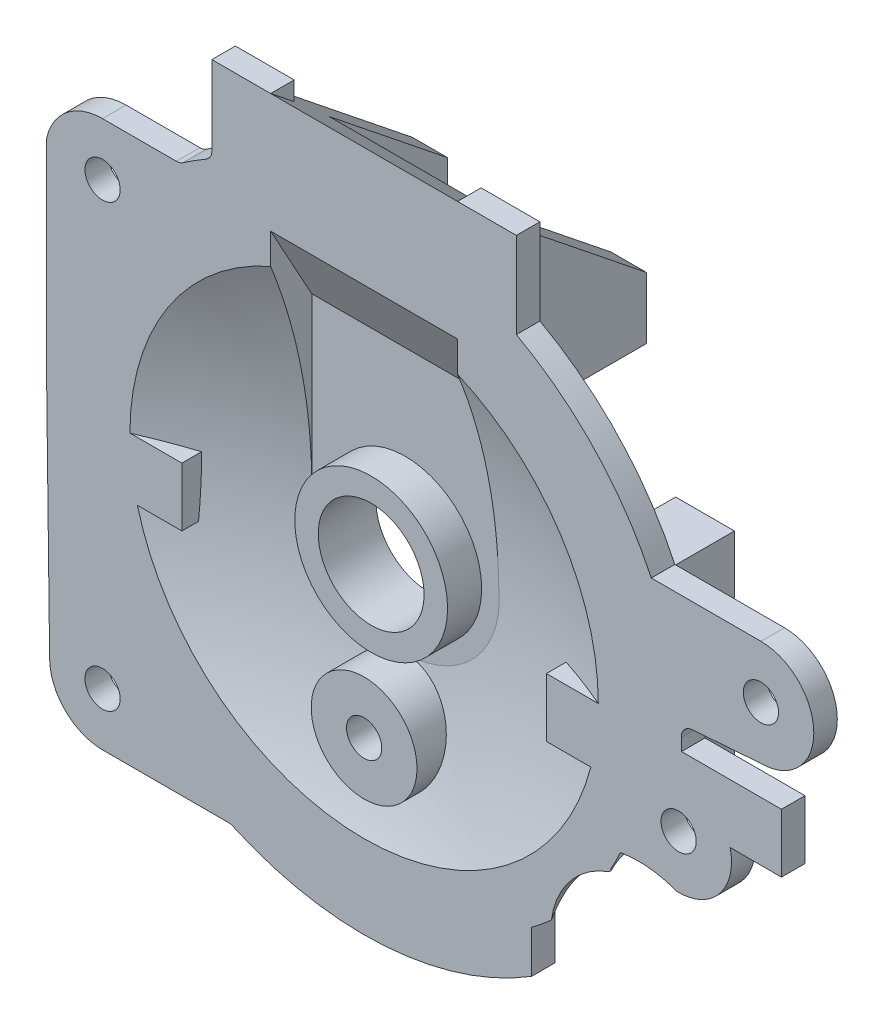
ISO-10303-21;
HEADER;
FILE_DESCRIPTION(('STEP AP214'),'2;1');
FILE_NAME('part.step','',(''),(''),'','','');
FILE_SCHEMA(('AUTOMOTIVE_DESIGN { 1 0 10303 214 1 1 1 1 }'));
ENDSEC;
DATA;
#1=APPLICATION_CONTEXT('core data for automotive mechanical design processes');
#2=APPLICATION_PROTOCOL_DEFINITION('international standard','automotive_design',2000,#1);
#3=PRODUCT_CONTEXT('',#1,'mechanical');
#4=PRODUCT('Part','Part','',(#3));
#5=PRODUCT_RELATED_PRODUCT_CATEGORY('part','',(#4));
#6=PRODUCT_DEFINITION_FORMATION('','',#4);
#7=PRODUCT_DEFINITION_CONTEXT('part definition',#1,'design');
#8=PRODUCT_DEFINITION('design','',#6,#7);
#9=PRODUCT_DEFINITION_SHAPE('','',#8);
#10=(LENGTH_UNIT() NAMED_UNIT(*) SI_UNIT(.MILLI.,.METRE.));
#11=(NAMED_UNIT(*) PLANE_ANGLE_UNIT() SI_UNIT($,.RADIAN.));
#12=(NAMED_UNIT(*) SI_UNIT($,.STERADIAN.) SOLID_ANGLE_UNIT());
#13=UNCERTAINTY_MEASURE_WITH_UNIT(LENGTH_MEASURE(1.E-05),#10,'distance_accuracy_value','');
#14=(GEOMETRIC_REPRESENTATION_CONTEXT(3) GLOBAL_UNCERTAINTY_ASSIGNED_CONTEXT((#13)) GLOBAL_UNIT_ASSIGNED_CONTEXT((#10,
#11,#12)) REPRESENTATION_CONTEXT('',''));
#15=CARTESIAN_POINT('',(0.,0.,0.));
#16=DIRECTION('',(0.,0.,1.));
#17=DIRECTION('',(1.,0.,0.));
#18=AXIS2_PLACEMENT_3D('',#15,#16,#17);
#19=CARTESIAN_POINT('',(-63.75,-2.,41.7954545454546));
#20=DIRECTION('',(0.,0.,-1.));
#21=DIRECTION('',(-1.,0.,0.));
#22=AXIS2_PLACEMENT_3D('',#19,#20,#21);
#23=SPHERICAL_SURFACE('',#22,49.9403828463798);
#24=CARTESIAN_POINT('',(-78.8436470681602,-15.,-4.));
#25=CARTESIAN_POINT('',(-78.8734948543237,-14.9653101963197,-4.0000108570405));
#26=CARTESIAN_POINT('',(-78.9018420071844,-14.9290056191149,-4.00090408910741));
#27=CARTESIAN_POINT('',(-78.9540726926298,-14.8527687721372,-4.00505307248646));
#28=CARTESIAN_POINT('',(-78.9778920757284,-14.8127947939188,-4.00833998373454));
#29=CARTESIAN_POINT('',(-79.0147517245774,-14.7378102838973,-4.01697596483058));
#30=CARTESIAN_POINT('',(-79.0289869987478,-14.703343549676,-4.02180055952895));
#31=CARTESIAN_POINT('',(-79.0517641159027,-14.6330788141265,-4.03362534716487));
#32=CARTESIAN_POINT('',(-79.0603341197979,-14.597288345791,-4.04061452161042));
#33=CARTESIAN_POINT('',(-79.0709780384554,-14.5248959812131,-4.05689400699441));
#34=CARTESIAN_POINT('',(-79.072994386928,-14.4882897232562,-4.06620394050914));
#35=CARTESIAN_POINT('',(-79.0700930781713,-14.4158849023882,-4.08682754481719));
#36=CARTESIAN_POINT('',(-79.065166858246,-14.3800873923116,-4.09814367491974));
#37=CARTESIAN_POINT('',(-79.0498690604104,-14.3142355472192,-4.12095410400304));
#38=CARTESIAN_POINT('',(-79.0401342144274,-14.2839758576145,-4.13230070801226));
#39=CARTESIAN_POINT('',(-79.0164440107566,-14.2255187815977,-4.15577340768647));
#40=CARTESIAN_POINT('',(-79.0024885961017,-14.1973214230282,-4.16789951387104));
#41=CARTESIAN_POINT('',(-78.9600862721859,-14.1238468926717,-4.20140141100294));
#42=CARTESIAN_POINT('',(-78.9283868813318,-14.0806640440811,-4.22322938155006));
#43=CARTESIAN_POINT('',(-78.8585221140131,-14.000101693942,-4.2672777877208));
#44=CARTESIAN_POINT('',(-78.8203342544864,-13.9627432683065,-4.28949933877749));
#45=CARTESIAN_POINT('',(-78.7410003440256,-13.8940326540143,-4.33313593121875));
#46=CARTESIAN_POINT('',(-78.6999856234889,-13.8625281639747,-4.3545543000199));
#47=CARTESIAN_POINT('',(-78.6151622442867,-13.8032905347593,-4.39712341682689));
#48=CARTESIAN_POINT('',(-78.5713507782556,-13.7755612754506,-4.41827386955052));
#49=CARTESIAN_POINT('',(-78.4365221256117,-13.6967776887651,-4.48138562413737));
#50=CARTESIAN_POINT('',(-78.3425040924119,-13.6504396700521,-4.52279834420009));
#51=CARTESIAN_POINT('',(-78.1631772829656,-13.5723891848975,-4.59841826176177));
#52=CARTESIAN_POINT('',(-78.0784240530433,-13.5395445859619,-4.63283918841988));
#53=CARTESIAN_POINT('',(-77.9065474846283,-13.4790062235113,-4.7005223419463));
#54=CARTESIAN_POINT('',(-77.8194219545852,-13.4513174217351,-4.73378342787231));
#55=CARTESIAN_POINT('',(-77.6459249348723,-13.400778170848,-4.79828242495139));
#56=CARTESIAN_POINT('',(-77.5595960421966,-13.3778177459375,-4.82955068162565));
#57=CARTESIAN_POINT('',(-77.3859539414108,-13.3352283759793,-4.89099010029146));
#58=CARTESIAN_POINT('',(-77.2986433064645,-13.3155922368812,-4.92116351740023));
#59=CARTESIAN_POINT('',(-77.2109204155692,-13.2972705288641,-4.95085160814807));
#60=B_SPLINE_CURVE_WITH_KNOTS('',3,(#24,#25,#26,#27,#28,#29,#30,#31,#32,#33,#34,#35,#36,#37,#38,
#39,#40,#41,#42,#43,#44,#45,#46,#47,#48,#49,#50,#51,#52,#53,#54,#55,#56,#57,#58,#59),
.UNSPECIFIED.,.F.,.F.,(4,2,2,2,2,2,2,2,2,2,2,2,2,2,2,2,2,4),(0.,0.137618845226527,
0.277061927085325,0.389423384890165,0.501222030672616,0.614000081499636,0.726917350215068,
0.827792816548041,0.928669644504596,1.10119845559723,1.27433776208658,1.44201493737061,
1.60986315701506,1.94717649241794,2.23859426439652,2.53029105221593,2.81415338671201,
3.09739333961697),.UNSPECIFIED.);
#61=CARTESIAN_POINT('',(-78.8436470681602,-15.,-4.));
#62=VERTEX_POINT('',#61);
#63=CARTESIAN_POINT('',(-77.2109204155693,-13.2972705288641,-4.95085160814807));
#64=VERTEX_POINT('',#63);
#65=EDGE_CURVE('E2872',#62,#64,#60,.T.);
#66=ORIENTED_EDGE('',*,*,#65,.T.);
#67=CARTESIAN_POINT('',(-77.2109204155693,-2.,41.7954545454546));
#68=DIRECTION('',(1.,0.,0.));
#69=DIRECTION('',(0.,0.,-1.));
#70=AXIS2_PLACEMENT_3D('',#67,#68,#69);
#71=CIRCLE('',#70,48.092051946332);
#72=CARTESIAN_POINT('',(-77.2109204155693,12.6840663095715,-4.));
#73=VERTEX_POINT('',#72);
#74=EDGE_CURVE('E74',#64,#73,#71,.T.);
#75=ORIENTED_EDGE('',*,*,#74,.T.);
#76=CARTESIAN_POINT('',(-63.75,-2.,-4.));
#77=DIRECTION('',(0.,0.,-1.));
#78=DIRECTION('',(-1.,0.,0.));
#79=AXIS2_PLACEMENT_3D('',#76,#77,#78);
#80=CIRCLE('',#79,19.9202957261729);
#81=CARTESIAN_POINT('',(-73.7,15.2573370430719,-4.));
#82=VERTEX_POINT('',#81);
#83=EDGE_CURVE('E1615',#82,#73,#80,.F.);
#84=ORIENTED_EDGE('',*,*,#83,.F.);
#85=CARTESIAN_POINT('',(-73.7,-2.,41.7954545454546));
#86=DIRECTION('',(-1.,0.,0.));
#87=DIRECTION('',(0.,0.,1.));
#88=AXIS2_PLACEMENT_3D('',#85,#86,#87);
#89=CIRCLE('',#88,48.9391391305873);
#90=CARTESIAN_POINT('',(-73.7,-1.00125078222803,-7.13349229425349));
#91=VERTEX_POINT('',#90);
#92=EDGE_CURVE('E1302',#82,#91,#89,.T.);
#93=ORIENTED_EDGE('',*,*,#92,.T.);
#94=CARTESIAN_POINT('',(-63.75,-1.00125078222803,41.7954545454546));
#95=DIRECTION('',(0.,1.,0.));
#96=DIRECTION('',(0.,0.,-1.));
#97=AXIS2_PLACEMENT_3D('',#94,#95,#96);
#98=CIRCLE('',#97,49.9303949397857);
#99=CARTESIAN_POINT('',(-71.7,-1.00125078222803,-7.49797137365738));
#100=VERTEX_POINT('',#99);
#101=EDGE_CURVE('E1306',#100,#91,#98,.T.);
#102=ORIENTED_EDGE('',*,*,#101,.F.);
#103=CARTESIAN_POINT('',(-71.7,-2.,41.7954545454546));
#104=DIRECTION('',(1.,0.,0.));
#105=DIRECTION('',(0.,0.,-1.));
#106=AXIS2_PLACEMENT_3D('',#103,#104,#105);
#107=CIRCLE('',#106,49.3035428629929);
#108=CARTESIAN_POINT('',(-71.7,-1.10697144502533,-7.5));
#109=VERTEX_POINT('',#108);
#110=EDGE_CURVE('E1239',#100,#109,#107,.F.);
#111=ORIENTED_EDGE('',*,*,#110,.T.);
#112=CARTESIAN_POINT('',(-63.75,-2.,-7.5));
#113=DIRECTION('',(0.,0.,1.));
#114=DIRECTION('',(1.,0.,0.));
#115=AXIS2_PLACEMENT_3D('',#112,#113,#114);
#116=CIRCLE('',#115,8.00000000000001);
#117=CARTESIAN_POINT('',(-55.8,-1.10697144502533,-7.5));
#118=VERTEX_POINT('',#117);
#119=EDGE_CURVE('E1193',#109,#118,#116,.T.);
#120=ORIENTED_EDGE('',*,*,#119,.T.);
#121=CARTESIAN_POINT('',(-55.8,-2.,41.7954545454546));
#122=DIRECTION('',(-1.,0.,0.));
#123=DIRECTION('',(0.,0.,1.));
#124=AXIS2_PLACEMENT_3D('',#121,#122,#123);
#125=CIRCLE('',#124,49.3035428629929);
#126=CARTESIAN_POINT('',(-55.8,-1.00125078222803,-7.49797137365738));
#127=VERTEX_POINT('',#126);
#128=EDGE_CURVE('E1233',#118,#127,#125,.F.);
#129=ORIENTED_EDGE('',*,*,#128,.T.);
#130=CARTESIAN_POINT('',(-63.75,-1.00125078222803,41.7954545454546));
#131=DIRECTION('',(0.,1.,0.));
#132=DIRECTION('',(0.,0.,-1.));
#133=AXIS2_PLACEMENT_3D('',#130,#131,#132);
#134=CIRCLE('',#133,49.9303949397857);
#135=CARTESIAN_POINT('',(-53.8,-1.00125078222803,-7.13349229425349));
#136=VERTEX_POINT('',#135);
#137=EDGE_CURVE('E1303',#136,#127,#134,.T.);
#138=ORIENTED_EDGE('',*,*,#137,.F.);
#139=CARTESIAN_POINT('',(-53.8,-2.,41.7954545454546));
#140=DIRECTION('',(1.,0.,0.));
#141=DIRECTION('',(0.,0.,-1.));
#142=AXIS2_PLACEMENT_3D('',#139,#140,#141);
#143=CIRCLE('',#142,48.9391391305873);
#144=CARTESIAN_POINT('',(-53.8,15.2573370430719,-4.));
#145=VERTEX_POINT('',#144);
#146=EDGE_CURVE('E1307',#136,#145,#143,.T.);
#147=ORIENTED_EDGE('',*,*,#146,.T.);
#148=CARTESIAN_POINT('',(-63.75,-2.,-4.));
#149=DIRECTION('',(0.,0.,-1.));
#150=DIRECTION('',(-1.,0.,0.));
#151=AXIS2_PLACEMENT_3D('',#148,#149,#150);
#152=CIRCLE('',#151,19.9202957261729);
#153=CARTESIAN_POINT('',(-50.2890795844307,12.6840663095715,-4.));
#154=VERTEX_POINT('',#153);
#155=EDGE_CURVE('E1437',#154,#145,#152,.F.);
#156=ORIENTED_EDGE('',*,*,#155,.F.);
#157=CARTESIAN_POINT('',(-50.2890795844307,-2.,41.7954545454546));
#158=DIRECTION('',(-1.,0.,0.));
#159=DIRECTION('',(0.,-1.,0.));
#160=AXIS2_PLACEMENT_3D('',#157,#158,#159);
#161=CIRCLE('',#160,48.092051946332);
#162=CARTESIAN_POINT('',(-50.2890795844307,-14.4994261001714,-4.64385862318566));
#163=VERTEX_POINT('',#162);
#164=EDGE_CURVE('E889',#154,#163,#161,.T.);
#165=ORIENTED_EDGE('',*,*,#164,.T.);
#166=CARTESIAN_POINT('',(-63.75,-14.4994261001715,41.7954545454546));
#167=DIRECTION('',(0.,1.,0.));
#168=DIRECTION('',(-1.,0.,0.));
#169=AXIS2_PLACEMENT_3D('',#166,#167,#168);
#170=CIRCLE('',#169,48.3508654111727);
#171=CARTESIAN_POINT('',(-44.1406602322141,-14.4994261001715,-2.40047264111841));
#172=VERTEX_POINT('',#171);
#173=EDGE_CURVE('E1554',#163,#172,#170,.F.);
#174=ORIENTED_EDGE('',*,*,#173,.T.);
#175=CARTESIAN_POINT('',(-47.8272371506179,-19.9578156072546,-1.99979999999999));
#176=CARTESIAN_POINT('',(-47.8029983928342,-19.7849370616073,-2.06187746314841));
#177=CARTESIAN_POINT('',(-47.7725164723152,-19.6117037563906,-2.12064900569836));
#178=CARTESIAN_POINT('',(-47.6988378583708,-19.2655791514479,-2.23108428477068));
#179=CARTESIAN_POINT('',(-47.6556345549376,-19.0926880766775,-2.2827443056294));
#180=CARTESIAN_POINT('',(-47.5561767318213,-18.7480216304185,-2.37852273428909));
#181=CARTESIAN_POINT('',(-47.49988762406,-18.5762504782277,-2.42262060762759));
#182=CARTESIAN_POINT('',(-47.3743113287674,-18.2355972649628,-2.5026106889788));
#183=CARTESIAN_POINT('',(-47.3050264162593,-18.0667147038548,-2.53850433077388));
#184=CARTESIAN_POINT('',(-47.1533428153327,-17.7325635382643,-2.60177554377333));
#185=CARTESIAN_POINT('',(-47.0708997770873,-17.567309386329,-2.62912335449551));
#186=CARTESIAN_POINT('',(-46.8934351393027,-17.2423995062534,-2.67478383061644));
#187=CARTESIAN_POINT('',(-46.7984139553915,-17.0827435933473,-2.6930967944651));
#188=CARTESIAN_POINT('',(-46.5965608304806,-16.7706859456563,-2.72041734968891));
#189=CARTESIAN_POINT('',(-46.4897522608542,-16.6182706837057,-2.72944300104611));
#190=CARTESIAN_POINT('',(-46.2649528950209,-16.3216506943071,-2.73812752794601));
#191=CARTESIAN_POINT('',(-46.1469628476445,-16.1774454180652,-2.73778703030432));
#192=CARTESIAN_POINT('',(-45.9070241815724,-15.9055053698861,-2.72800202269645));
#193=CARTESIAN_POINT('',(-45.7855824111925,-15.7773058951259,-2.71902159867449));
#194=CARTESIAN_POINT('',(-45.5344287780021,-15.5302030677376,-2.69274185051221));
#195=CARTESIAN_POINT('',(-45.4047169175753,-15.41129971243,-2.6754425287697));
#196=CARTESIAN_POINT('',(-45.1378539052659,-15.1833369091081,-2.63269835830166));
#197=CARTESIAN_POINT('',(-45.0006924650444,-15.0742916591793,-2.60724199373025));
#198=CARTESIAN_POINT('',(-44.7202386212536,-14.8668116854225,-2.54850217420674));
#199=CARTESIAN_POINT('',(-44.5769468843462,-14.7683758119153,-2.51521956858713));
#200=CARTESIAN_POINT('',(-44.1911164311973,-14.5224825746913,-2.41725702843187));
#201=CARTESIAN_POINT('',(-43.9441457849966,-14.3843302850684,-2.34616809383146));
#202=CARTESIAN_POINT('',(-43.5676003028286,-14.2003065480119,-2.22597447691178));
#203=CARTESIAN_POINT('',(-43.4412619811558,-14.142900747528,-2.18372252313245));
#204=CARTESIAN_POINT('',(-43.1869140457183,-14.0356534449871,-2.09492442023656));
#205=CARTESIAN_POINT('',(-43.0589046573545,-13.9858109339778,-2.04837884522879));
#206=CARTESIAN_POINT('',(-42.9302775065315,-13.9397099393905,-1.9998));
#207=B_SPLINE_CURVE_WITH_KNOTS('',3,(#175,#176,#177,#178,#179,#180,#181,#182,#183,#184,#185,
#186,#187,#188,#189,#190,#191,#192,#193,#194,#195,#196,#197,#198,#199,#200,#201,#202,#203,#204,
#205,#206),.UNSPECIFIED.,.F.,.F.,(4,2,2,2,2,2,2,2,2,2,2,2,2,2,2,4),(0.,0.555761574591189,
1.1118124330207,1.66935008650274,2.2267902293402,2.78615053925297,3.34549237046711,
3.90374444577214,4.46195916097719,4.99177238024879,5.52158544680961,6.05214980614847,
6.58265661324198,7.45515071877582,7.89011018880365,8.32501158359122),.UNSPECIFIED.);
#208=CARTESIAN_POINT('',(-47.8271589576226,-19.9572585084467,-1.99999999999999));
#209=VERTEX_POINT('',#208);
#210=EDGE_CURVE('E1159',#209,#172,#207,.T.);
#211=ORIENTED_EDGE('',*,*,#210,.F.);
#212=CARTESIAN_POINT('',(-63.75,-2.,-2.));
#213=DIRECTION('',(0.,0.,1.));
#214=DIRECTION('',(1.,0.,0.));
#215=AXIS2_PLACEMENT_3D('',#212,#213,#214);
#216=CIRCLE('',#215,24.);
#217=CARTESIAN_POINT('',(-49.5,-21.3115897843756,-2.));
#218=VERTEX_POINT('',#217);
#219=EDGE_CURVE('E1150',#218,#209,#216,.T.);
#220=ORIENTED_EDGE('',*,*,#219,.F.);
#221=CARTESIAN_POINT('',(-49.5,-2.,41.7954545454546));
#222=DIRECTION('',(1.,0.,0.));
#223=DIRECTION('',(0.,0.,-1.));
#224=AXIS2_PLACEMENT_3D('',#221,#222,#223);
#225=CIRCLE('',#224,47.8641759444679);
#226=CARTESIAN_POINT('',(-49.5,-15.9196150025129,-4.));
#227=VERTEX_POINT('',#226);
#228=EDGE_CURVE('E1617',#227,#218,#225,.F.);
#229=ORIENTED_EDGE('',*,*,#228,.F.);
#230=EDGE_CURVE('E795',#62,#227,#80,.F.);
#231=ORIENTED_EDGE('',*,*,#230,.F.);
#232=EDGE_LOOP('',(#66,#75,#84,#93,#102,#111,#120,#129,#138,#147,#156,#165,#174,#211,#220,#229,#231));
#233=FACE_BOUND('',#232,.T.);
#234=ADVANCED_FACE('F54',(#233),#23,.T.);
#235=CARTESIAN_POINT('',(0.,-13.,-1.998));
#236=DIRECTION('',(0.,1.,0.));
#237=DIRECTION('',(-1.,0.,0.));
#238=AXIS2_PLACEMENT_3D('',#235,#236,#237);
#239=PLANE('',#238);
#240=CARTESIAN_POINT('',(-79.75,-13.,-6.99802217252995));
#241=CARTESIAN_POINT('',(-79.7499988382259,-13.,-6.93919029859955));
#242=CARTESIAN_POINT('',(-79.7475281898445,-13.,-6.88038647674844));
#243=CARTESIAN_POINT('',(-79.7376691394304,-13.,-6.76319306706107));
#244=CARTESIAN_POINT('',(-79.7302807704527,-13.,-6.70480347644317));
#245=CARTESIAN_POINT('',(-79.7007882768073,-13.,-6.5308947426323));
#246=CARTESIAN_POINT('',(-79.6713566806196,-13.,-6.41653021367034));
#247=CARTESIAN_POINT('',(-79.5936672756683,-13.,-6.19435663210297));
#248=CARTESIAN_POINT('',(-79.5453970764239,-13.,-6.08655194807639));
#249=CARTESIAN_POINT('',(-79.4312613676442,-13.,-5.88071683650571));
#250=CARTESIAN_POINT('',(-79.3654025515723,-13.,-5.7826827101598));
#251=CARTESIAN_POINT('',(-79.2186186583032,-13.,-5.60038115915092));
#252=CARTESIAN_POINT('',(-79.1378651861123,-13.,-5.51597563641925));
#253=CARTESIAN_POINT('',(-78.9630053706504,-13.,-5.36232388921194));
#254=CARTESIAN_POINT('',(-78.8688988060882,-13.,-5.29307791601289));
#255=CARTESIAN_POINT('',(-78.6725014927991,-13.,-5.17357226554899));
#256=CARTESIAN_POINT('',(-78.5704706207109,-13.,-5.12288549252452));
#257=CARTESIAN_POINT('',(-78.3591843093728,-13.,-5.03983580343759));
#258=CARTESIAN_POINT('',(-78.2499289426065,-13.,-5.00747270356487));
#259=CARTESIAN_POINT('',(-78.0300825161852,-13.,-4.96272025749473));
#260=CARTESIAN_POINT('',(-77.9195822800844,-13.,-4.94988197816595));
#261=CARTESIAN_POINT('',(-77.6980704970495,-13.,-4.94320437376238));
#262=CARTESIAN_POINT('',(-77.5870597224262,-13.,-4.94934227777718));
#263=CARTESIAN_POINT('',(-77.4324237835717,-13.,-4.97118034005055));
#264=CARTESIAN_POINT('',(-77.3875925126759,-13.,-4.97912637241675));
#265=CARTESIAN_POINT('',(-77.2986764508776,-13.,-4.9981093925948));
#266=CARTESIAN_POINT('',(-77.2545904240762,-13.,-5.00914059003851));
#267=CARTESIAN_POINT('',(-77.2109204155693,-13.,-5.0216946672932));
#268=B_SPLINE_CURVE_WITH_KNOTS('',3,(#240,#241,#242,#243,#244,#245,#246,#247,#248,#249,#250,
#251,#252,#253,#254,#255,#256,#257,#258,#259,#260,#261,#262,#263,#264,#265,#266,#267),
.UNSPECIFIED.,.F.,.F.,(4,2,2,2,2,2,2,2,2,2,2,2,2,4),(0.,0.176387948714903,0.352774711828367,
0.70523595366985,1.05792940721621,1.41048883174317,1.75921480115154,2.10794655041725,
2.44805609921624,2.78816223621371,3.1203233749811,3.45208608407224,3.58858696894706,
3.72483336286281),.UNSPECIFIED.);
#269=CARTESIAN_POINT('',(-79.75,-13.,-6.99802217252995));
#270=VERTEX_POINT('',#269);
#271=CARTESIAN_POINT('',(-79.4973070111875,-13.,-5.99999999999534));
#272=VERTEX_POINT('',#271);
#273=EDGE_CURVE('E785',#270,#272,#268,.T.);
#274=ORIENTED_EDGE('',*,*,#273,.T.);
#275=DIRECTION('',(1.,0.,0.));
#276=VECTOR('',#275,1.);
#277=CARTESIAN_POINT('',(-86.75,-13.,-6.));
#278=LINE('',#277,#276);
#279=CARTESIAN_POINT('',(-84.75,-13.,-6.));
#280=VERTEX_POINT('',#279);
#281=EDGE_CURVE('E2873',#272,#280,#278,.F.);
#282=ORIENTED_EDGE('',*,*,#281,.T.);
#283=DIRECTION('',(0.,0.,-1.));
#284=VECTOR('',#283,1.);
#285=CARTESIAN_POINT('',(-84.75,-13.,-1.998));
#286=LINE('',#285,#284);
#287=CARTESIAN_POINT('',(-84.75,-13.,-12.5));
#288=VERTEX_POINT('',#287);
#289=EDGE_CURVE('E645',#280,#288,#286,.T.);
#290=ORIENTED_EDGE('',*,*,#289,.T.);
#291=DIRECTION('',(1.,0.,0.));
#292=VECTOR('',#291,1.);
#293=CARTESIAN_POINT('',(0.,-13.,-12.5));
#294=LINE('',#293,#292);
#295=CARTESIAN_POINT('',(-79.75,-13.,-12.5));
#296=VERTEX_POINT('',#295);
#297=EDGE_CURVE('E607',#288,#296,#294,.T.);
#298=ORIENTED_EDGE('',*,*,#297,.T.);
#299=DIRECTION('',(0.,0.,-1.));
#300=VECTOR('',#299,1.);
#301=CARTESIAN_POINT('',(-79.75,-13.,-1.998));
#302=LINE('',#301,#300);
#303=EDGE_CURVE('E647',#270,#296,#302,.T.);
#304=ORIENTED_EDGE('',*,*,#303,.F.);
#305=EDGE_LOOP('',(#274,#282,#290,#298,#304));
#306=FACE_BOUND('',#305,.T.);
#307=ADVANCED_FACE('F805',(#306),#239,.F.);
#308=CARTESIAN_POINT('',(-42.75,-13.6189500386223,-2.));
#309=VERTEX_POINT('',#308);
#310=CARTESIAN_POINT('',(-41.9475242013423,-12.032549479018,-2.));
#311=VERTEX_POINT('',#310);
#312=EDGE_CURVE('E1142',#309,#311,#216,.T.);
#313=ORIENTED_EDGE('',*,*,#312,.F.);
#314=CARTESIAN_POINT('',(-42.75,-2.,41.7954545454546));
#315=DIRECTION('',(-1.,0.,0.));
#316=DIRECTION('',(0.,0.,1.));
#317=AXIS2_PLACEMENT_3D('',#314,#315,#316);
#318=CIRCLE('',#317,45.3105047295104);
#319=CARTESIAN_POINT('',(-42.75,-12.032549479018,-2.39040054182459));
#320=VERTEX_POINT('',#319);
#321=EDGE_CURVE('E629',#320,#309,#318,.T.);
#322=ORIENTED_EDGE('',*,*,#321,.F.);
#323=CARTESIAN_POINT('',(-63.75,-12.032549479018,41.7954545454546));
#324=DIRECTION('',(0.,1.,0.));
#325=DIRECTION('',(0.,0.,-1.));
#326=AXIS2_PLACEMENT_3D('',#323,#324,#325);
#327=CIRCLE('',#326,48.9222831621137);
#328=EDGE_CURVE('E1144',#320,#311,#327,.F.);
#329=ORIENTED_EDGE('',*,*,#328,.T.);
#330=EDGE_LOOP('',(#313,#322,#329));
#331=FACE_BOUND('',#330,.T.);
#332=ADVANCED_FACE('F1004',(#331),#23,.T.);
#333=CARTESIAN_POINT('',(0.,-12.032549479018,-4.));
#334=DIRECTION('',(0.,-1.,0.));
#335=DIRECTION('',(0.,0.,-1.));
#336=AXIS2_PLACEMENT_3D('',#333,#334,#335);
#337=PLANE('',#336);
#338=ORIENTED_EDGE('',*,*,#328,.F.);
#339=DIRECTION('',(0.,0.,1.));
#340=VECTOR('',#339,1.);
#341=CARTESIAN_POINT('',(-42.75,-12.032549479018,-1.998));
#342=LINE('',#341,#340);
#343=CARTESIAN_POINT('',(-42.75,-12.032549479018,-6.));
#344=VERTEX_POINT('',#343);
#345=EDGE_CURVE('E625',#344,#320,#342,.T.);
#346=ORIENTED_EDGE('',*,*,#345,.F.);
#347=CARTESIAN_POINT('',(-40.75,-12.032549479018,-6.));
#348=DIRECTION('',(0.,-1.,0.));
#349=DIRECTION('',(0.,0.,-1.));
#350=AXIS2_PLACEMENT_3D('',#347,#348,#349);
#351=CIRCLE('',#350,2.);
#352=CARTESIAN_POINT('',(-41.9475242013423,-12.032549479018,-4.39814614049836));
#353=VERTEX_POINT('',#352);
#354=EDGE_CURVE('E984',#344,#353,#351,.F.);
#355=ORIENTED_EDGE('',*,*,#354,.T.);
#356=DIRECTION('',(0.,0.,1.));
#357=VECTOR('',#356,1.);
#358=CARTESIAN_POINT('',(-41.9475242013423,-12.032549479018,-4.));
#359=LINE('',#358,#357);
#360=EDGE_CURVE('E1351',#353,#311,#359,.T.);
#361=ORIENTED_EDGE('',*,*,#360,.T.);
#362=EDGE_LOOP('',(#338,#346,#355,#361));
#363=FACE_BOUND('',#362,.T.);
#364=ADVANCED_FACE('F754',(#363),#337,.T.);
#365=CARTESIAN_POINT('',(0.,-7.,26.0707499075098));
#366=DIRECTION('',(0.,-1.,0.));
#367=DIRECTION('',(0.,0.,-1.));
#368=AXIS2_PLACEMENT_3D('',#365,#366,#367);
#369=PLANE('',#368);
#370=DIRECTION('',(0.,0.,-1.));
#371=VECTOR('',#370,1.);
#372=CARTESIAN_POINT('',(-47.75,-7.,-1.998));
#373=LINE('',#372,#371);
#374=CARTESIAN_POINT('',(-47.75,-7.,-4.));
#375=VERTEX_POINT('',#374);
#376=CARTESIAN_POINT('',(-47.75,-7.,-7.9720385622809));
#377=VERTEX_POINT('',#376);
#378=EDGE_CURVE('E622',#375,#377,#373,.T.);
#379=ORIENTED_EDGE('',*,*,#378,.T.);
#380=CARTESIAN_POINT('',(-47.75,-7.,-7.9720385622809));
#381=CARTESIAN_POINT('',(-47.7500009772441,-7.,-7.91533280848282));
#382=CARTESIAN_POINT('',(-47.7523892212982,-7.,-7.85865485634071));
#383=CARTESIAN_POINT('',(-47.7619181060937,-7.,-7.74570016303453));
#384=CARTESIAN_POINT('',(-47.7690587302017,-7.,-7.68942342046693));
#385=CARTESIAN_POINT('',(-47.7975933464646,-7.,-7.52161075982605));
#386=CARTESIAN_POINT('',(-47.8261000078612,-7.,-7.41119719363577));
#387=CARTESIAN_POINT('',(-47.9012638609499,-7.,-7.19672984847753));
#388=CARTESIAN_POINT('',(-47.9479333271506,-7.,-7.09268042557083));
#389=CARTESIAN_POINT('',(-48.0580349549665,-7.,-6.89415812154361));
#390=CARTESIAN_POINT('',(-48.1214170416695,-7.,-6.79965778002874));
#391=CARTESIAN_POINT('',(-48.2109515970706,-7.,-6.68784734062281));
#392=CARTESIAN_POINT('',(-48.2302255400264,-7.,-6.66485574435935));
#393=CARTESIAN_POINT('',(-48.25,-7.,-6.6423210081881));
#394=B_SPLINE_CURVE_WITH_KNOTS('',3,(#380,#381,#382,#383,#384,#385,#386,#387,#388,#389,#390,
#391,#392,#393),.UNSPECIFIED.,.F.,.F.,(4,2,2,2,2,2,4),(0.,0.170011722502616,0.34002284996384,
0.680355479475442,1.02091850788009,1.36047250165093,1.45044394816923),.UNSPECIFIED.);
#395=CARTESIAN_POINT('',(-48.25,-7.,-6.64232100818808));
#396=VERTEX_POINT('',#395);
#397=EDGE_CURVE('E738',#377,#396,#394,.T.);
#398=ORIENTED_EDGE('',*,*,#397,.T.);
#399=DIRECTION('',(0.,0.,-1.));
#400=VECTOR('',#399,1.);
#401=CARTESIAN_POINT('',(-48.25,-7.,26.0707499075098));
#402=LINE('',#401,#400);
#403=CARTESIAN_POINT('',(-48.25,-7.,-4.));
#404=VERTEX_POINT('',#403);
#405=EDGE_CURVE('E1656',#404,#396,#402,.T.);
#406=ORIENTED_EDGE('',*,*,#405,.F.);
#407=DIRECTION('',(-1.,0.,0.));
#408=VECTOR('',#407,1.);
#409=CARTESIAN_POINT('',(0.,-7.,-4.));
#410=LINE('',#409,#408);
#411=EDGE_CURVE('E665',#375,#404,#410,.T.);
#412=ORIENTED_EDGE('',*,*,#411,.F.);
#413=EDGE_LOOP('',(#379,#398,#406,#412));
#414=FACE_BOUND('',#413,.T.);
#415=ADVANCED_FACE('F749',(#414),#369,.F.);
#416=CARTESIAN_POINT('',(0.,0.,-4.));
#417=DIRECTION('',(0.,0.,1.));
#418=DIRECTION('',(-1.,0.,0.));
#419=AXIS2_PLACEMENT_3D('',#416,#417,#418);
#420=PLANE('',#419);
#421=DIRECTION('',(0.,-1.,0.));
#422=VECTOR('',#421,1.);
#423=CARTESIAN_POINT('',(-47.75,0.,-4.));
#424=LINE('',#423,#422);
#425=CARTESIAN_POINT('',(-47.75,-2.,-4.));
#426=VERTEX_POINT('',#425);
#427=EDGE_CURVE('E628',#426,#375,#424,.T.);
#428=ORIENTED_EDGE('',*,*,#427,.T.);
#429=ORIENTED_EDGE('',*,*,#411,.T.);
#430=DIRECTION('',(0.,1.,0.));
#431=VECTOR('',#430,1.);
#432=CARTESIAN_POINT('',(-48.25,0.,-4.));
#433=LINE('',#432,#431);
#434=CARTESIAN_POINT('',(-48.25,-2.,-4.));
#435=VERTEX_POINT('',#434);
#436=EDGE_CURVE('E667',#404,#435,#433,.T.);
#437=ORIENTED_EDGE('',*,*,#436,.T.);
#438=DIRECTION('',(1.,0.,0.));
#439=VECTOR('',#438,1.);
#440=CARTESIAN_POINT('',(0.,-2.,-4.));
#441=LINE('',#440,#439);
#442=EDGE_CURVE('E670',#435,#426,#441,.T.);
#443=ORIENTED_EDGE('',*,*,#442,.T.);
#444=EDGE_LOOP('',(#428,#429,#437,#443));
#445=FACE_BOUND('',#444,.T.);
#446=ADVANCED_FACE('F753',(#445),#420,.F.);
#447=CARTESIAN_POINT('',(-30.,5.,-4.));
#448=DIRECTION('',(0.,0.,-1.));
#449=DIRECTION('',(-1.,0.,0.));
#450=AXIS2_PLACEMENT_3D('',#447,#448,#449);
#451=CIRCLE('',#450,1.5);
#452=CARTESIAN_POINT('',(-31.5,5.,-4.));
#453=VERTEX_POINT('',#452);
#454=EDGE_CURVE('E1353',#453,#453,#451,.T.);
#455=ORIENTED_EDGE('',*,*,#454,.F.);
#456=EDGE_LOOP('',(#455));
#457=FACE_BOUND('',#456,.T.);
#458=CARTESIAN_POINT('',(-37.,-8.,-4.));
#459=DIRECTION('',(0.,0.,-1.));
#460=DIRECTION('',(-1.,0.,0.));
#461=AXIS2_PLACEMENT_3D('',#458,#459,#460);
#462=CIRCLE('',#461,1.5);
#463=CARTESIAN_POINT('',(-38.5,-8.,-4.));
#464=VERTEX_POINT('',#463);
#465=EDGE_CURVE('E1415',#464,#464,#462,.T.);
#466=ORIENTED_EDGE('',*,*,#465,.F.);
#467=EDGE_LOOP('',(#466));
#468=FACE_BOUND('',#467,.T.);
#469=CARTESIAN_POINT('',(-47.75,4.94458585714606,-4.));
#470=CARTESIAN_POINT('',(-47.75,5.47250766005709,-4.));
#471=CARTESIAN_POINT('',(-47.7590785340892,5.99924895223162,-4.));
#472=CARTESIAN_POINT('',(-47.8049253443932,7.05064111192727,-4.));
#473=CARTESIAN_POINT('',(-47.8414416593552,7.5751296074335,-4.));
#474=CARTESIAN_POINT('',(-47.9575854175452,8.6180584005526,-4.));
#475=CARTESIAN_POINT('',(-48.0359877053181,9.13883398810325,-4.));
#476=CARTESIAN_POINT('',(-48.2165501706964,9.90631168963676,-4.));
#477=CARTESIAN_POINT('',(-48.2871066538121,10.1603227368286,-4.));
#478=CARTESIAN_POINT('',(-48.4243234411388,10.533192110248,-4.));
#479=CARTESIAN_POINT('',(-48.4749693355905,10.6550951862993,-4.));
#480=CARTESIAN_POINT('',(-48.5936609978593,10.8905338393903,-4.));
#481=CARTESIAN_POINT('',(-48.6599551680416,11.004901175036,-4.));
#482=CARTESIAN_POINT('',(-48.75,11.1079434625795,-4.));
#483=CARTESIAN_POINT('',(-54.5128692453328,17.7026498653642,-4.));
#484=CARTESIAN_POINT('',(-60.2757384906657,24.2973562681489,-4.));
#485=CARTESIAN_POINT('',(-66.0386077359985,30.8920626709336,-4.));
#486=B_SPLINE_CURVE_WITH_KNOTS('',3,(#469,#470,#471,#472,#473,#474,#475,#476,#477,#478,#479,
#480,#481,#482,#483,#484,#485),.UNSPECIFIED.,.F.,.F.,(4,2,2,2,2,2,3,4),(0.,0.25,0.5,0.75,0.875,
0.9375,1.,5.),.UNSPECIFIED.);
#487=CARTESIAN_POINT('',(-47.75,4.94458585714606,-4.));
#488=VERTEX_POINT('',#487);
#489=CARTESIAN_POINT('',(-49.940157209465,12.4698930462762,-4.));
#490=VERTEX_POINT('',#489);
#491=EDGE_CURVE('E673',#488,#490,#486,.T.);
#492=ORIENTED_EDGE('',*,*,#491,.T.);
#493=CARTESIAN_POINT('',(-49.940157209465,12.4698930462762,-4.));
#494=CARTESIAN_POINT('',(-49.9916607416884,12.4862783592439,-4.));
#495=CARTESIAN_POINT('',(-50.0407851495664,12.5084604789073,-4.));
#496=CARTESIAN_POINT('',(-50.1335624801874,12.5609446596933,-4.));
#497=CARTESIAN_POINT('',(-50.1772892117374,12.5911137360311,-4.));
#498=CARTESIAN_POINT('',(-50.2307975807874,12.6335226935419,-4.));
#499=CARTESIAN_POINT('',(-50.2426703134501,12.6433130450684,-4.));
#500=CARTESIAN_POINT('',(-50.2661115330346,12.6633585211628,-4.));
#501=CARTESIAN_POINT('',(-50.2776783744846,12.6736155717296,-4.));
#502=CARTESIAN_POINT('',(-50.2890795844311,12.684066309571,-4.));
#503=B_SPLINE_CURVE_WITH_KNOTS('',3,(#493,#494,#495,#496,#497,#498,#499,#500,#501,#502),
.UNSPECIFIED.,.F.,.F.,(4,2,2,2,4),(0.,0.161087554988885,0.319645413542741,0.365811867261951,
0.412190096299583),.UNSPECIFIED.);
#504=EDGE_CURVE('E727',#490,#154,#503,.T.);
#505=ORIENTED_EDGE('',*,*,#504,.T.);
#506=ORIENTED_EDGE('',*,*,#155,.T.);
#507=DIRECTION('',(0.,-1.,0.));
#508=VECTOR('',#507,1.);
#509=CARTESIAN_POINT('',(-53.8,0.,-4.));
#510=LINE('',#509,#508);
#511=CARTESIAN_POINT('',(-53.8,27.3987184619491,-4.));
#512=VERTEX_POINT('',#511);
#513=EDGE_CURVE('E1339',#512,#145,#510,.T.);
#514=ORIENTED_EDGE('',*,*,#513,.F.);
#515=DIRECTION('',(1.,0.,0.));
#516=VECTOR('',#515,1.);
#517=CARTESIAN_POINT('',(-95.3722749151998,27.3987184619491,-4.));
#518=LINE('',#517,#516);
#519=CARTESIAN_POINT('',(-55.8,27.3987184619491,-4.));
#520=VERTEX_POINT('',#519);
#521=EDGE_CURVE('E1343',#520,#512,#518,.T.);
#522=ORIENTED_EDGE('',*,*,#521,.F.);
#523=DIRECTION('',(0.,1.,0.));
#524=VECTOR('',#523,1.);
#525=CARTESIAN_POINT('',(-55.8,0.,-4.));
#526=LINE('',#525,#524);
#527=CARTESIAN_POINT('',(-55.8,29.,-4.));
#528=VERTEX_POINT('',#527);
#529=EDGE_CURVE('E1434',#520,#528,#526,.T.);
#530=ORIENTED_EDGE('',*,*,#529,.T.);
#531=DIRECTION('',(1.,0.,0.));
#532=VECTOR('',#531,1.);
#533=CARTESIAN_POINT('',(0.,29.,-4.));
#534=LINE('',#533,#532);
#535=CARTESIAN_POINT('',(-50.8,29.,-4.));
#536=VERTEX_POINT('',#535);
#537=EDGE_CURVE('E1431',#528,#536,#534,.T.);
#538=ORIENTED_EDGE('',*,*,#537,.T.);
#539=DIRECTION('',(0.,-1.,0.));
#540=VECTOR('',#539,1.);
#541=CARTESIAN_POINT('',(-50.8,0.,-4.));
#542=LINE('',#541,#540);
#543=CARTESIAN_POINT('',(-50.8,21.6917179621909,-4.));
#544=VERTEX_POINT('',#543);
#545=EDGE_CURVE('E1428',#536,#544,#542,.T.);
#546=ORIENTED_EDGE('',*,*,#545,.T.);
#547=CARTESIAN_POINT('',(-63.75,-2.,-4.));
#548=DIRECTION('',(0.,0.,-1.));
#549=DIRECTION('',(-1.,0.,0.));
#550=AXIS2_PLACEMENT_3D('',#547,#548,#549);
#551=CIRCLE('',#550,27.);
#552=CARTESIAN_POINT('',(-39.3215329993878,9.5,-4.));
#553=VERTEX_POINT('',#552);
#554=EDGE_CURVE('E1598',#553,#544,#551,.F.);
#555=ORIENTED_EDGE('',*,*,#554,.F.);
#556=DIRECTION('',(1.,0.,0.));
#557=VECTOR('',#556,1.);
#558=CARTESIAN_POINT('',(0.,9.5,-4.));
#559=LINE('',#558,#557);
#560=CARTESIAN_POINT('',(-30.,9.5,-4.));
#561=VERTEX_POINT('',#560);
#562=EDGE_CURVE('E1595',#553,#561,#559,.T.);
#563=ORIENTED_EDGE('',*,*,#562,.T.);
#564=CARTESIAN_POINT('',(-30.,5.,-4.));
#565=DIRECTION('',(0.,0.,-1.));
#566=DIRECTION('',(-1.,0.,0.));
#567=AXIS2_PLACEMENT_3D('',#564,#565,#566);
#568=CIRCLE('',#567,4.5);
#569=CARTESIAN_POINT('',(-30.,0.499999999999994,-4.));
#570=VERTEX_POINT('',#569);
#571=EDGE_CURVE('E1425',#561,#570,#568,.T.);
#572=ORIENTED_EDGE('',*,*,#571,.T.);
#573=DIRECTION('',(-0.997267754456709,-0.0738716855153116,0.));
#574=VECTOR('',#573,1.);
#575=CARTESIAN_POINT('',(-0.200545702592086,2.70736698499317,-4.));
#576=LINE('',#575,#574);
#577=CARTESIAN_POINT('',(-35.8443169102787,0.0670876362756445,-4.));
#578=VERTEX_POINT('',#577);
#579=EDGE_CURVE('E1423',#570,#578,#576,.T.);
#580=ORIENTED_EDGE('',*,*,#579,.T.);
#581=CARTESIAN_POINT('',(-35.7704452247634,-0.930180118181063,-4.));
#582=DIRECTION('',(0.,0.,-1.));
#583=DIRECTION('',(-1.,0.,0.));
#584=AXIS2_PLACEMENT_3D('',#581,#582,#583);
#585=CIRCLE('',#584,1.);
#586=CARTESIAN_POINT('',(-36.7697150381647,-0.968387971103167,-4.));
#587=VERTEX_POINT('',#586);
#588=EDGE_CURVE('E1600',#587,#578,#585,.T.);
#589=ORIENTED_EDGE('',*,*,#588,.F.);
#590=CARTESIAN_POINT('',(-63.75,-2.,-4.));
#591=DIRECTION('',(0.,0.,-1.));
#592=DIRECTION('',(-1.,0.,0.));
#593=AXIS2_PLACEMENT_3D('',#590,#591,#592);
#594=CIRCLE('',#593,27.);
#595=CARTESIAN_POINT('',(-36.75,-2.,-4.));
#596=VERTEX_POINT('',#595);
#597=EDGE_CURVE('E1421',#587,#596,#594,.T.);
#598=ORIENTED_EDGE('',*,*,#597,.T.);
#599=DIRECTION('',(1.,0.,0.));
#600=VECTOR('',#599,1.);
#601=CARTESIAN_POINT('',(0.,-2.,-4.));
#602=LINE('',#601,#600);
#603=CARTESIAN_POINT('',(-28.25,-2.,-4.));
#604=VERTEX_POINT('',#603);
#605=EDGE_CURVE('E657',#596,#604,#602,.T.);
#606=ORIENTED_EDGE('',*,*,#605,.T.);
#607=DIRECTION('',(0.,-1.,0.));
#608=VECTOR('',#607,1.);
#609=CARTESIAN_POINT('',(-28.25,0.,-4.));
#610=LINE('',#609,#608);
#611=CARTESIAN_POINT('',(-28.25,-7.,-4.));
#612=VERTEX_POINT('',#611);
#613=EDGE_CURVE('E659',#604,#612,#610,.T.);
#614=ORIENTED_EDGE('',*,*,#613,.T.);
#615=DIRECTION('',(-1.,0.,0.));
#616=VECTOR('',#615,1.);
#617=CARTESIAN_POINT('',(0.,-7.,-4.));
#618=LINE('',#617,#616);
#619=CARTESIAN_POINT('',(-32.6125178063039,-7.,-4.));
#620=VERTEX_POINT('',#619);
#621=EDGE_CURVE('E662',#612,#620,#618,.T.);
#622=ORIENTED_EDGE('',*,*,#621,.T.);
#623=CARTESIAN_POINT('',(-37.,-8.,-4.));
#624=DIRECTION('',(0.,0.,-1.));
#625=DIRECTION('',(-1.,0.,0.));
#626=AXIS2_PLACEMENT_3D('',#623,#624,#625);
#627=CIRCLE('',#626,4.50000000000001);
#628=CARTESIAN_POINT('',(-37.1576162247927,-12.4972388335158,-4.));
#629=VERTEX_POINT('',#628);
#630=EDGE_CURVE('E1418',#620,#629,#627,.T.);
#631=ORIENTED_EDGE('',*,*,#630,.T.);
#632=CARTESIAN_POINT('',(-40.4,-21.,-4.));
#633=DIRECTION('',(0.,0.,-1.));
#634=DIRECTION('',(-1.,0.,0.));
#635=AXIS2_PLACEMENT_3D('',#632,#633,#634);
#636=CIRCLE('',#635,9.1);
#637=CARTESIAN_POINT('',(-40.75,-11.9067332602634,-4.));
#638=VERTEX_POINT('',#637);
#639=EDGE_CURVE('E1382',#638,#629,#636,.T.);
#640=ORIENTED_EDGE('',*,*,#639,.F.);
#641=DIRECTION('',(0.,1.,0.));
#642=VECTOR('',#641,1.);
#643=CARTESIAN_POINT('',(-40.75,0.,-4.));
#644=LINE('',#643,#642);
#645=CARTESIAN_POINT('',(-40.75,7.99999999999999,-4.));
#646=VERTEX_POINT('',#645);
#647=EDGE_CURVE('E1546',#638,#646,#644,.T.);
#648=ORIENTED_EDGE('',*,*,#647,.T.);
#649=DIRECTION('',(-1.,0.,0.));
#650=VECTOR('',#649,1.);
#651=CARTESIAN_POINT('',(0.,8.,-4.));
#652=LINE('',#651,#650);
#653=CARTESIAN_POINT('',(-47.75,7.99999999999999,-4.));
#654=VERTEX_POINT('',#653);
#655=EDGE_CURVE('E1543',#646,#654,#652,.T.);
#656=ORIENTED_EDGE('',*,*,#655,.T.);
#657=EDGE_CURVE('E624',#654,#488,#424,.T.);
#658=ORIENTED_EDGE('',*,*,#657,.T.);
#659=EDGE_LOOP('',(#492,#505,#506,#514,#522,#530,#538,#546,#555,#563,#572,#580,#589,#598,#606,
#614,#622,#631,#640,#648,#656,#658));
#660=FACE_BOUND('',#659,.T.);
#661=ADVANCED_FACE('F771',(#457,#468,#660),#420,.F.);
#662=CARTESIAN_POINT('',(0.,-7.,26.0707499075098));
#663=DIRECTION('',(0.,-1.,0.));
#664=DIRECTION('',(1.,0.,0.));
#665=AXIS2_PLACEMENT_3D('',#662,#663,#664);
#666=PLANE('',#665);
#667=DIRECTION('',(0.,0.,1.));
#668=VECTOR('',#667,1.);
#669=CARTESIAN_POINT('',(-79.75,-7.,-1.998));
#670=LINE('',#669,#668);
#671=CARTESIAN_POINT('',(-79.75,-7.,-7.97203512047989));
#672=VERTEX_POINT('',#671);
#673=CARTESIAN_POINT('',(-79.75,-7.,-4.));
#674=VERTEX_POINT('',#673);
#675=EDGE_CURVE('E637',#672,#674,#670,.T.);
#676=ORIENTED_EDGE('',*,*,#675,.T.);
#677=DIRECTION('',(-1.,0.,0.));
#678=VECTOR('',#677,1.);
#679=CARTESIAN_POINT('',(0.,-7.,-4.));
#680=LINE('',#679,#678);
#681=CARTESIAN_POINT('',(-79.25,-7.,-4.));
#682=VERTEX_POINT('',#681);
#683=EDGE_CURVE('E851',#682,#674,#680,.T.);
#684=ORIENTED_EDGE('',*,*,#683,.F.);
#685=DIRECTION('',(0.,0.,-1.));
#686=VECTOR('',#685,1.);
#687=CARTESIAN_POINT('',(-79.25,-7.,26.0707499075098));
#688=LINE('',#687,#686);
#689=CARTESIAN_POINT('',(-79.25,-7.,-6.64232100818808));
#690=VERTEX_POINT('',#689);
#691=EDGE_CURVE('E845',#682,#690,#688,.T.);
#692=ORIENTED_EDGE('',*,*,#691,.T.);
#693=CARTESIAN_POINT('',(-79.25,-7.,-6.64232100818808));
#694=CARTESIAN_POINT('',(-79.2873332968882,-7.,-6.68487919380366));
#695=CARTESIAN_POINT('',(-79.3228479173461,-7.,-6.72899524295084));
#696=CARTESIAN_POINT('',(-79.3900319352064,-7.,-6.82006171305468));
#697=CARTESIAN_POINT('',(-79.4217014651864,-7.,-6.86701203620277));
#698=CARTESIAN_POINT('',(-79.5106723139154,-7.,-7.01175880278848));
#699=CARTESIAN_POINT('',(-79.5618875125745,-7.,-7.11339578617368));
#700=CARTESIAN_POINT('',(-79.6465299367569,-7.,-7.32380520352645));
#701=CARTESIAN_POINT('',(-79.6799477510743,-7.,-7.43258137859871));
#702=CARTESIAN_POINT('',(-79.7280005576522,-7.,-7.65396922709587));
#703=CARTESIAN_POINT('',(-79.7426885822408,-7.,-7.76656914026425));
#704=CARTESIAN_POINT('',(-79.7492956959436,-7.,-7.91031096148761));
#705=CARTESIAN_POINT('',(-79.7500044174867,-7.,-7.94118007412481));
#706=CARTESIAN_POINT('',(-79.7499999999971,-7.,-7.97203512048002));
#707=B_SPLINE_CURVE_WITH_KNOTS('',3,(#693,#694,#695,#696,#697,#698,#699,#700,#701,#702,#703,
#704,#705,#706),.UNSPECIFIED.,.F.,.F.,(4,2,2,2,2,2,4),(0.,0.169730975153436,0.339456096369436,
0.67912386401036,1.01897106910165,1.35785386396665,1.45044944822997),.UNSPECIFIED.);
#708=EDGE_CURVE('E777',#690,#672,#707,.T.);
#709=ORIENTED_EDGE('',*,*,#708,.T.);
#710=EDGE_LOOP('',(#676,#684,#692,#709));
#711=FACE_BOUND('',#710,.T.);
#712=ADVANCED_FACE('F766',(#711),#666,.F.);
#713=CARTESIAN_POINT('',(0.,0.,-4.));
#714=DIRECTION('',(0.,0.,1.));
#715=DIRECTION('',(-1.,0.,0.));
#716=AXIS2_PLACEMENT_3D('',#713,#714,#715);
#717=PLANE('',#716);
#718=CARTESIAN_POINT('',(-86.,-22.,-4.));
#719=DIRECTION('',(0.,0.,-1.));
#720=DIRECTION('',(-1.,0.,0.));
#721=AXIS2_PLACEMENT_3D('',#718,#719,#720);
#722=CIRCLE('',#721,1.5);
#723=CARTESIAN_POINT('',(-87.5,-22.,-4.));
#724=VERTEX_POINT('',#723);
#725=EDGE_CURVE('E2707',#724,#724,#722,.T.);
#726=ORIENTED_EDGE('',*,*,#725,.F.);
#727=EDGE_LOOP('',(#726));
#728=FACE_BOUND('',#727,.T.);
#729=CARTESIAN_POINT('',(-86.,15.5,-4.));
#730=DIRECTION('',(0.,0.,-1.));
#731=DIRECTION('',(-1.,0.,0.));
#732=AXIS2_PLACEMENT_3D('',#729,#730,#731);
#733=CIRCLE('',#732,1.5);
#734=CARTESIAN_POINT('',(-87.5,15.5,-4.));
#735=VERTEX_POINT('',#734);
#736=EDGE_CURVE('E2704',#735,#735,#733,.T.);
#737=ORIENTED_EDGE('',*,*,#736,.F.);
#738=EDGE_LOOP('',(#737));
#739=FACE_BOUND('',#738,.T.);
#740=DIRECTION('',(0.,-1.,0.));
#741=VECTOR('',#740,1.);
#742=CARTESIAN_POINT('',(-86.75,-13.,-4.));
#743=LINE('',#742,#741);
#744=CARTESIAN_POINT('',(-86.75,7.99999999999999,-4.));
#745=VERTEX_POINT('',#744);
#746=CARTESIAN_POINT('',(-86.75,-15.,-4.));
#747=VERTEX_POINT('',#746);
#748=EDGE_CURVE('E1534',#745,#747,#743,.T.);
#749=ORIENTED_EDGE('',*,*,#748,.T.);
#750=DIRECTION('',(1.,0.,0.));
#751=VECTOR('',#750,1.);
#752=CARTESIAN_POINT('',(-80.3577747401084,-15.,-4.));
#753=LINE('',#752,#751);
#754=EDGE_CURVE('E794',#747,#62,#753,.T.);
#755=ORIENTED_EDGE('',*,*,#754,.T.);
#756=ORIENTED_EDGE('',*,*,#230,.T.);
#757=DIRECTION('',(0.,1.,0.));
#758=VECTOR('',#757,1.);
#759=CARTESIAN_POINT('',(-49.5,0.,-4.));
#760=LINE('',#759,#758);
#761=CARTESIAN_POINT('',(-49.5,-24.933327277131,-4.));
#762=VERTEX_POINT('',#761);
#763=EDGE_CURVE('E2692',#762,#227,#760,.T.);
#764=ORIENTED_EDGE('',*,*,#763,.F.);
#765=CARTESIAN_POINT('',(-63.75,-2.,-4.));
#766=DIRECTION('',(0.,0.,-1.));
#767=DIRECTION('',(-1.,0.,0.));
#768=AXIS2_PLACEMENT_3D('',#765,#766,#767);
#769=CIRCLE('',#768,27.);
#770=CARTESIAN_POINT('',(-74.901996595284,-26.5892857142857,-4.));
#771=VERTEX_POINT('',#770);
#772=EDGE_CURVE('E2737',#762,#771,#769,.T.);
#773=ORIENTED_EDGE('',*,*,#772,.T.);
#774=CARTESIAN_POINT('',(-75.3150335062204,-27.5,-4.));
#775=DIRECTION('',(0.,0.,-1.));
#776=DIRECTION('',(-1.,0.,0.));
#777=AXIS2_PLACEMENT_3D('',#774,#775,#776);
#778=CIRCLE('',#777,1.);
#779=CARTESIAN_POINT('',(-75.3150335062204,-26.5,-4.));
#780=VERTEX_POINT('',#779);
#781=EDGE_CURVE('E2734',#780,#771,#778,.T.);
#782=ORIENTED_EDGE('',*,*,#781,.F.);
#783=DIRECTION('',(1.,0.,0.));
#784=VECTOR('',#783,1.);
#785=CARTESIAN_POINT('',(0.,-26.5,-4.));
#786=LINE('',#785,#784);
#787=CARTESIAN_POINT('',(-86.,-26.5,-4.));
#788=VERTEX_POINT('',#787);
#789=EDGE_CURVE('E2731',#788,#780,#786,.T.);
#790=ORIENTED_EDGE('',*,*,#789,.F.);
#791=CARTESIAN_POINT('',(-86.,-22.,-4.));
#792=DIRECTION('',(0.,0.,-1.));
#793=DIRECTION('',(-1.,0.,0.));
#794=AXIS2_PLACEMENT_3D('',#791,#792,#793);
#795=CIRCLE('',#794,4.5);
#796=CARTESIAN_POINT('',(-90.4996494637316,-22.0561667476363,-4.));
#797=VERTEX_POINT('',#796);
#798=EDGE_CURVE('E2728',#788,#797,#795,.T.);
#799=ORIENTED_EDGE('',*,*,#798,.T.);
#800=DIRECTION('',(0.0124814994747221,-0.999922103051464,0.));
#801=VECTOR('',#800,1.);
#802=CARTESIAN_POINT('',(-90.7608233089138,-1.13291941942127,-4.));
#803=LINE('',#802,#801);
#804=CARTESIAN_POINT('',(-90.75,-1.9999999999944,-4.));
#805=VERTEX_POINT('',#804);
#806=EDGE_CURVE('E1593',#805,#797,#803,.T.);
#807=ORIENTED_EDGE('',*,*,#806,.F.);
#808=DIRECTION('',(0.,-1.,0.));
#809=VECTOR('',#808,1.);
#810=CARTESIAN_POINT('',(-90.75,-1.38396619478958E-13,-4.));
#811=LINE('',#810,#809);
#812=CARTESIAN_POINT('',(-90.75,16.200000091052,-4.));
#813=VERTEX_POINT('',#812);
#814=EDGE_CURVE('E2726',#813,#805,#811,.T.);
#815=ORIENTED_EDGE('',*,*,#814,.F.);
#816=CARTESIAN_POINT('',(-86.,15.131250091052,-4.));
#817=DIRECTION('',(0.,0.,-1.));
#818=DIRECTION('',(-1.,0.,0.));
#819=AXIS2_PLACEMENT_3D('',#816,#817,#818);
#820=CIRCLE('',#819,4.86874999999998);
#821=CARTESIAN_POINT('',(-86.,20.000000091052,-4.));
#822=VERTEX_POINT('',#821);
#823=EDGE_CURVE('E2724',#813,#822,#820,.T.);
#824=ORIENTED_EDGE('',*,*,#823,.T.);
#825=DIRECTION('',(1.,0.,0.));
#826=VECTOR('',#825,1.);
#827=CARTESIAN_POINT('',(0.,20.0000000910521,-4.));
#828=LINE('',#827,#826);
#829=CARTESIAN_POINT('',(-79.7187192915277,20.000000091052,-4.));
#830=VERTEX_POINT('',#829);
#831=EDGE_CURVE('E2722',#822,#830,#828,.T.);
#832=ORIENTED_EDGE('',*,*,#831,.T.);
#833=CARTESIAN_POINT('',(-79.7187192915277,21.000000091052,-4.));
#834=DIRECTION('',(0.,0.,-1.));
#835=DIRECTION('',(-1.,0.,0.));
#836=AXIS2_PLACEMENT_3D('',#833,#834,#835);
#837=CIRCLE('',#836,1.);
#838=CARTESIAN_POINT('',(-79.1484078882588,20.1785715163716,-4.));
#839=VERTEX_POINT('',#838);
#840=EDGE_CURVE('E2719',#839,#830,#837,.T.);
#841=ORIENTED_EDGE('',*,*,#840,.F.);
#842=CARTESIAN_POINT('',(-63.75,-2.,-4.));
#843=DIRECTION('',(0.,0.,-1.));
#844=DIRECTION('',(-1.,0.,0.));
#845=AXIS2_PLACEMENT_3D('',#842,#843,#844);
#846=CIRCLE('',#845,27.);
#847=CARTESIAN_POINT('',(-77.2017857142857,21.4104562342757,-4.));
#848=VERTEX_POINT('',#847);
#849=EDGE_CURVE('E2717',#839,#848,#846,.T.);
#850=ORIENTED_EDGE('',*,*,#849,.T.);
#851=CARTESIAN_POINT('',(-77.7,22.2775101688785,-4.));
#852=DIRECTION('',(0.,0.,-1.));
#853=DIRECTION('',(-1.,0.,0.));
#854=AXIS2_PLACEMENT_3D('',#851,#852,#853);
#855=CIRCLE('',#854,1.);
#856=CARTESIAN_POINT('',(-76.7,22.2775101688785,-4.));
#857=VERTEX_POINT('',#856);
#858=EDGE_CURVE('E2715',#848,#857,#855,.F.);
#859=ORIENTED_EDGE('',*,*,#858,.T.);
#860=DIRECTION('',(0.,-1.,0.));
#861=VECTOR('',#860,1.);
#862=CARTESIAN_POINT('',(-76.7,1.58338108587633E-13,-4.));
#863=LINE('',#862,#861);
#864=CARTESIAN_POINT('',(-76.7,29.,-4.));
#865=VERTEX_POINT('',#864);
#866=EDGE_CURVE('E2712',#865,#857,#863,.T.);
#867=ORIENTED_EDGE('',*,*,#866,.F.);
#868=DIRECTION('',(1.,0.,0.));
#869=VECTOR('',#868,1.);
#870=CARTESIAN_POINT('',(0.,29.,-4.));
#871=LINE('',#870,#869);
#872=CARTESIAN_POINT('',(-71.7,29.,-4.));
#873=VERTEX_POINT('',#872);
#874=EDGE_CURVE('E2710',#865,#873,#871,.T.);
#875=ORIENTED_EDGE('',*,*,#874,.T.);
#876=DIRECTION('',(0.,1.,0.));
#877=VECTOR('',#876,1.);
#878=CARTESIAN_POINT('',(-71.7,0.,-4.));
#879=LINE('',#878,#877);
#880=CARTESIAN_POINT('',(-71.7,27.3987184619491,-4.));
#881=VERTEX_POINT('',#880);
#882=EDGE_CURVE('E2740',#881,#873,#879,.T.);
#883=ORIENTED_EDGE('',*,*,#882,.F.);
#884=DIRECTION('',(1.,0.,0.));
#885=VECTOR('',#884,1.);
#886=CARTESIAN_POINT('',(-95.3722749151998,27.3987184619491,-4.));
#887=LINE('',#886,#885);
#888=CARTESIAN_POINT('',(-73.7,27.3987184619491,-4.));
#889=VERTEX_POINT('',#888);
#890=EDGE_CURVE('E2772',#889,#881,#887,.T.);
#891=ORIENTED_EDGE('',*,*,#890,.F.);
#892=DIRECTION('',(0.,1.,0.));
#893=VECTOR('',#892,1.);
#894=CARTESIAN_POINT('',(-73.7,0.,-4.));
#895=LINE('',#894,#893);
#896=EDGE_CURVE('E1412',#82,#889,#895,.T.);
#897=ORIENTED_EDGE('',*,*,#896,.F.);
#898=ORIENTED_EDGE('',*,*,#83,.T.);
#899=CARTESIAN_POINT('',(-77.2109204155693,12.6840663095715,-4.00000000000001));
#900=CARTESIAN_POINT('',(-77.2504495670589,12.6478652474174,-4.));
#901=CARTESIAN_POINT('',(-77.292391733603,12.6135598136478,-4.));
#902=CARTESIAN_POINT('',(-77.3800987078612,12.5524876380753,-4.));
#903=CARTESIAN_POINT('',(-77.4257680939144,12.5255814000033,-4.));
#904=CARTESIAN_POINT('',(-77.4876192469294,12.4970060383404,-4.));
#905=CARTESIAN_POINT('',(-77.5017688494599,12.4909623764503,-4.));
#906=CARTESIAN_POINT('',(-77.5305040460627,12.4797403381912,-4.));
#907=CARTESIAN_POINT('',(-77.5450917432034,12.4745673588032,-4.));
#908=CARTESIAN_POINT('',(-77.5598427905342,12.4698930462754,-4.));
#909=B_SPLINE_CURVE_WITH_KNOTS('',3,(#899,#900,#901,#902,#903,#904,#905,#906,#907,#908),
.UNSPECIFIED.,.F.,.F.,(4,2,2,2,4),(0.,0.161533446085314,0.319772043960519,0.365901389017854,
0.41230690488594),.UNSPECIFIED.);
#910=CARTESIAN_POINT('',(-77.5598427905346,12.4698930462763,-4.));
#911=VERTEX_POINT('',#910);
#912=EDGE_CURVE('E886',#73,#911,#909,.T.);
#913=ORIENTED_EDGE('',*,*,#912,.T.);
#914=CARTESIAN_POINT('',(-61.5393451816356,30.802857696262,-4.));
#915=CARTESIAN_POINT('',(-67.2762301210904,24.2378862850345,-4.));
#916=CARTESIAN_POINT('',(-73.0131150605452,17.672914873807,-4.));
#917=CARTESIAN_POINT('',(-78.75,11.1079434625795,-4.));
#918=CARTESIAN_POINT('',(-78.839638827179,11.0053657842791,-4.));
#919=CARTESIAN_POINT('',(-78.9067592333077,10.8899867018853,-4.));
#920=CARTESIAN_POINT('',(-79.0268784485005,10.6511379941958,-4.));
#921=CARTESIAN_POINT('',(-79.0780414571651,10.5272710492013,-4.));
#922=CARTESIAN_POINT('',(-79.2145779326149,10.1546981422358,-4.));
#923=CARTESIAN_POINT('',(-79.284696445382,9.901592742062,-4.));
#924=CARTESIAN_POINT('',(-79.464672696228,9.13485205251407,-4.));
#925=CARTESIAN_POINT('',(-79.5431324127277,8.61287783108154,-4.));
#926=CARTESIAN_POINT('',(-79.716843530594,7.04920109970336,-4.));
#927=CARTESIAN_POINT('',(-79.75,6.00005262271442,-4.));
#928=CARTESIAN_POINT('',(-79.7500000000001,4.94458585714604,-4.));
#929=B_SPLINE_CURVE_WITH_KNOTS('',3,(#914,#915,#916,#917,#918,#919,#920,#921,#922,#923,#924,
#925,#926,#927,#928),.UNSPECIFIED.,.F.,.F.,(4,3,2,2,2,2,4),(-4.,0.,0.0625,0.125,
0.249999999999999,0.499999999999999,1.),.UNSPECIFIED.);
#930=CARTESIAN_POINT('',(-79.75,4.94458585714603,-4.));
#931=VERTEX_POINT('',#930);
#932=EDGE_CURVE('E653',#911,#931,#929,.T.);
#933=ORIENTED_EDGE('',*,*,#932,.T.);
#934=DIRECTION('',(0.,-1.,0.));
#935=VECTOR('',#934,1.);
#936=CARTESIAN_POINT('',(-79.75,0.,-4.));
#937=LINE('',#936,#935);
#938=CARTESIAN_POINT('',(-79.75,7.99999999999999,-4.));
#939=VERTEX_POINT('',#938);
#940=EDGE_CURVE('E1532',#939,#931,#937,.T.);
#941=ORIENTED_EDGE('',*,*,#940,.F.);
#942=DIRECTION('',(-1.,0.,0.));
#943=VECTOR('',#942,1.);
#944=CARTESIAN_POINT('',(-84.75,7.99999999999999,-4.));
#945=LINE('',#944,#943);
#946=EDGE_CURVE('E1536',#939,#745,#945,.T.);
#947=ORIENTED_EDGE('',*,*,#946,.T.);
#948=EDGE_LOOP('',(#749,#755,#756,#764,#773,#782,#790,#799,#807,#815,#824,#832,#841,#850,#859,
#867,#875,#883,#891,#897,#898,#913,#933,#941,#947));
#949=FACE_BOUND('',#948,.T.);
#950=ADVANCED_FACE('F770',(#728,#739,#949),#717,.F.);
#951=DIRECTION('',(0.,1.,0.));
#952=VECTOR('',#951,1.);
#953=CARTESIAN_POINT('',(-79.75,0.,-4.));
#954=LINE('',#953,#952);
#955=CARTESIAN_POINT('',(-79.75,-2.,-4.));
#956=VERTEX_POINT('',#955);
#957=EDGE_CURVE('E642',#674,#956,#954,.T.);
#958=ORIENTED_EDGE('',*,*,#957,.T.);
#959=DIRECTION('',(1.,0.,0.));
#960=VECTOR('',#959,1.);
#961=CARTESIAN_POINT('',(0.,-2.,-4.));
#962=LINE('',#961,#960);
#963=CARTESIAN_POINT('',(-79.25,-2.,-4.));
#964=VERTEX_POINT('',#963);
#965=EDGE_CURVE('E852',#956,#964,#962,.T.);
#966=ORIENTED_EDGE('',*,*,#965,.T.);
#967=DIRECTION('',(0.,-1.,0.));
#968=VECTOR('',#967,1.);
#969=CARTESIAN_POINT('',(-79.25,0.,-4.));
#970=LINE('',#969,#968);
#971=EDGE_CURVE('E853',#964,#682,#970,.T.);
#972=ORIENTED_EDGE('',*,*,#971,.T.);
#973=ORIENTED_EDGE('',*,*,#683,.T.);
#974=EDGE_LOOP('',(#958,#966,#972,#973));
#975=FACE_BOUND('',#974,.T.);
#976=ADVANCED_FACE('F877',(#975),#717,.F.);
#977=CARTESIAN_POINT('',(-90.75,-1.38396619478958E-13,-4.));
#978=DIRECTION('',(1.,0.,0.));
#979=DIRECTION('',(0.,-1.,0.));
#980=AXIS2_PLACEMENT_3D('',#977,#978,#979);
#981=PLANE('',#980);
#982=ORIENTED_EDGE('',*,*,#814,.T.);
#983=DIRECTION('',(0.,0.,1.));
#984=VECTOR('',#983,1.);
#985=CARTESIAN_POINT('',(-90.75,-2.,-4.));
#986=LINE('',#985,#984);
#987=CARTESIAN_POINT('',(-90.75,-2.,-2.));
#988=VERTEX_POINT('',#987);
#989=EDGE_CURVE('E2835',#805,#988,#986,.T.);
#990=ORIENTED_EDGE('',*,*,#989,.T.);
#991=DIRECTION('',(0.,-1.,0.));
#992=VECTOR('',#991,1.);
#993=CARTESIAN_POINT('',(-90.75,-1.38396619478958E-13,-2.));
#994=LINE('',#993,#992);
#995=CARTESIAN_POINT('',(-90.75,16.200000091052,-2.));
#996=VERTEX_POINT('',#995);
#997=EDGE_CURVE('E2807',#996,#988,#994,.T.);
#998=ORIENTED_EDGE('',*,*,#997,.F.);
#999=DIRECTION('',(0.,0.,1.));
#1000=VECTOR('',#999,1.);
#1001=CARTESIAN_POINT('',(-90.75,16.200000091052,-4.));
#1002=LINE('',#1001,#1000);
#1003=EDGE_CURVE('E2838',#813,#996,#1002,.T.);
#1004=ORIENTED_EDGE('',*,*,#1003,.F.);
#1005=EDGE_LOOP('',(#982,#990,#998,#1004));
#1006=FACE_BOUND('',#1005,.T.);
#1007=ADVANCED_FACE('F949',(#1006),#981,.F.);
#1008=CARTESIAN_POINT('',(-63.75,-2.,43.7954545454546));
#1009=DIRECTION('',(0.,0.,-1.));
#1010=DIRECTION('',(-1.,0.,0.));
#1011=AXIS2_PLACEMENT_3D('',#1008,#1009,#1010);
#1012=SPHERICAL_SURFACE('',#1011,49.9403828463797);
#1013=CARTESIAN_POINT('',(-62.8475690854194,-15.698172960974,-4.22107921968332));
#1014=CARTESIAN_POINT('',(-62.7792186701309,-15.6466879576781,-4.23448215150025));
#1015=CARTESIAN_POINT('',(-62.7154109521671,-15.589433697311,-4.24938136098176));
#1016=CARTESIAN_POINT('',(-62.598659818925,-15.4652471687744,-4.28168056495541));
#1017=CARTESIAN_POINT('',(-62.5457340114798,-15.3982995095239,-4.29908453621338));
#1018=CARTESIAN_POINT('',(-62.4522246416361,-15.2569313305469,-4.33581275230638));
#1019=CARTESIAN_POINT('',(-62.4116191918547,-15.1825243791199,-4.35513350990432));
#1020=CARTESIAN_POINT('',(-62.343583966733,-15.0282977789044,-4.3951544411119));
#1021=CARTESIAN_POINT('',(-62.3161506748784,-14.948479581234,-4.41585424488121));
#1022=CARTESIAN_POINT('',(-62.2745888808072,-14.7837820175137,-4.45853755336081));
#1023=CARTESIAN_POINT('',(-62.2607675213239,-14.698829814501,-4.48053931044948));
#1024=CARTESIAN_POINT('',(-62.2478099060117,-14.5278660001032,-4.52478633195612));
#1025=CARTESIAN_POINT('',(-62.2486760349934,-14.44185421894,-4.54703163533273));
#1026=CARTESIAN_POINT('',(-62.2652078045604,-14.269854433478,-4.59148562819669));
#1027=CARTESIAN_POINT('',(-62.2810956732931,-14.1838862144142,-4.6136887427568));
#1028=CARTESIAN_POINT('',(-62.3276338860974,-14.0157668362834,-4.65708036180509));
#1029=CARTESIAN_POINT('',(-62.3582842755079,-13.9336156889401,-4.67826886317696));
#1030=CARTESIAN_POINT('',(-62.4334010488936,-13.7760231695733,-4.71889044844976));
#1031=CARTESIAN_POINT('',(-62.4777870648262,-13.7005459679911,-4.73833291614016));
#1032=CARTESIAN_POINT('',(-62.5793208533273,-13.5581102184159,-4.77500376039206));
#1033=CARTESIAN_POINT('',(-62.636467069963,-13.4911506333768,-4.79223240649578));
#1034=CARTESIAN_POINT('',(-62.7604631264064,-13.3694331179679,-4.82353609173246));
#1035=CARTESIAN_POINT('',(-62.8270448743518,-13.3144192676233,-4.83767732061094));
#1036=CARTESIAN_POINT('',(-62.9690628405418,-13.2164207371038,-4.86285902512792));
#1037=CARTESIAN_POINT('',(-63.0444973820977,-13.1734337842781,-4.8739000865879));
#1038=CARTESIAN_POINT('',(-63.1995104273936,-13.1021413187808,-4.89220700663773));
#1039=CARTESIAN_POINT('',(-63.2788824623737,-13.0734145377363,-4.89958120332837));
#1040=CARTESIAN_POINT('',(-63.4415495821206,-13.0296433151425,-4.91081597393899));
#1041=CARTESIAN_POINT('',(-63.5248440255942,-13.0145966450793,-4.91467712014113));
#1042=CARTESIAN_POINT('',(-63.6907959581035,-12.9989098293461,-4.91870250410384));
#1043=CARTESIAN_POINT('',(-63.7734189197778,-12.9979252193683,-4.91895513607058));
#1044=CARTESIAN_POINT('',(-63.937641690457,-13.0095084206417,-4.91598282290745));
#1045=CARTESIAN_POINT('',(-64.0192415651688,-13.0220753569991,-4.91275810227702));
#1046=CARTESIAN_POINT('',(-64.1785446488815,-13.0602038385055,-4.90297218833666));
#1047=CARTESIAN_POINT('',(-64.2562704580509,-13.0856770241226,-4.89643368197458));
#1048=CARTESIAN_POINT('',(-64.4062872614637,-13.1487381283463,-4.88024217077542));
#1049=CARTESIAN_POINT('',(-64.47857801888,-13.1863265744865,-4.87058903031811));
#1050=CARTESIAN_POINT('',(-64.6167502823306,-13.2730182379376,-4.84831697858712));
#1051=CARTESIAN_POINT('',(-64.6825333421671,-13.3222684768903,-4.83566019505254));
#1052=CARTESIAN_POINT('',(-64.8049150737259,-13.4305001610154,-4.80783266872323));
#1053=CARTESIAN_POINT('',(-64.8615126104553,-13.4894828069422,-4.79266161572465));
#1054=CARTESIAN_POINT('',(-64.9655942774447,-13.6172188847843,-4.75978866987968));
#1055=CARTESIAN_POINT('',(-65.0127848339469,-13.686196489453,-4.74202863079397));
#1056=CARTESIAN_POINT('',(-65.0949504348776,-13.8306592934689,-4.70481042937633));
#1057=CARTESIAN_POINT('',(-65.1299235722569,-13.9061455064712,-4.68535200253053));
#1058=CARTESIAN_POINT('',(-65.1877503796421,-14.0639419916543,-4.64464986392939));
#1059=CARTESIAN_POINT('',(-65.2102028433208,-14.1463900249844,-4.62336984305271));
#1060=CARTESIAN_POINT('',(-65.2408192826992,-14.3137318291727,-4.58014891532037));
#1061=CARTESIAN_POINT('',(-65.2489813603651,-14.3986259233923,-4.55820792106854));
#1062=CARTESIAN_POINT('',(-65.2508585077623,-14.5703284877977,-4.51380056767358));
#1063=CARTESIAN_POINT('',(-65.2442697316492,-14.6571400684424,-4.49133276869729));
#1064=CARTESIAN_POINT('',(-65.2161669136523,-14.8284676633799,-4.4469608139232));
#1065=CARTESIAN_POINT('',(-65.1946521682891,-14.9129835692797,-4.42505668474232));
#1066=CARTESIAN_POINT('',(-65.1371422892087,-15.0774406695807,-4.38240632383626));
#1067=CARTESIAN_POINT('',(-65.1011208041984,-15.157373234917,-4.36166227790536));
#1068=CARTESIAN_POINT('',(-65.0154700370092,-15.3100913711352,-4.32200536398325));
#1069=CARTESIAN_POINT('',(-64.9658417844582,-15.3828774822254,-4.30309235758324));
#1070=CARTESIAN_POINT('',(-64.855310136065,-15.5177162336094,-4.26803716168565));
#1071=CARTESIAN_POINT('',(-64.7946356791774,-15.5799445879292,-4.25184965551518));
#1072=CARTESIAN_POINT('',(-64.6630446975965,-15.6932662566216,-4.22235882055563));
#1073=CARTESIAN_POINT('',(-64.5921300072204,-15.7443615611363,-4.20905497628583));
#1074=CARTESIAN_POINT('',(-64.4444440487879,-15.8322539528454,-4.18616295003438));
#1075=CARTESIAN_POINT('',(-64.3679248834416,-15.8694477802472,-4.17647169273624));
#1076=CARTESIAN_POINT('',(-64.2093885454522,-15.9304443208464,-4.16057525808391));
#1077=CARTESIAN_POINT('',(-64.1273726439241,-15.9542501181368,-4.15436927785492));
#1078=CARTESIAN_POINT('',(-63.9627531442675,-15.9871369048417,-4.14579527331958));
#1079=CARTESIAN_POINT('',(-63.8802368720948,-15.9966281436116,-4.14332032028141));
#1080=CARTESIAN_POINT('',(-63.7147191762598,-16.0018687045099,-4.14195383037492));
#1081=CARTESIAN_POINT('',(-63.6317176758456,-15.9976157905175,-4.1430628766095));
#1082=CARTESIAN_POINT('',(-63.4687536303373,-15.9756615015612,-4.14878712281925));
#1083=CARTESIAN_POINT('',(-63.3887656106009,-15.958135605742,-4.15335657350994));
#1084=CARTESIAN_POINT('',(-63.2330041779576,-15.9104375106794,-4.16578959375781));
#1085=CARTESIAN_POINT('',(-63.1572256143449,-15.8802811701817,-4.17364903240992));
#1086=CARTESIAN_POINT('',(-63.0428068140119,-15.8236530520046,-4.18840254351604));
#1087=CARTESIAN_POINT('',(-63.0020659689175,-15.8010588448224,-4.19428819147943));
#1088=CARTESIAN_POINT('',(-62.9229620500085,-15.7522651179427,-4.20699592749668));
#1089=CARTESIAN_POINT('',(-62.8845989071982,-15.7260657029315,-4.21381798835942));
#1090=CARTESIAN_POINT('',(-62.8475690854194,-15.698172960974,-4.22107921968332));
#1091=B_SPLINE_CURVE_WITH_KNOTS('',3,(#1013,#1014,#1015,#1016,#1017,#1018,#1019,#1020,#1021,
#1022,#1023,#1024,#1025,#1026,#1027,#1028,#1029,#1030,#1031,#1032,#1033,#1034,#1035,#1036,#1037,
#1038,#1039,#1040,#1041,#1042,#1043,#1044,#1045,#1046,#1047,#1048,#1049,#1050,#1051,#1052,#1053,
#1054,#1055,#1056,#1057,#1058,#1059,#1060,#1061,#1062,#1063,#1064,#1065,#1066,#1067,#1068,#1069,
#1070,#1071,#1072,#1073,#1074,#1075,#1076,#1077,#1078,#1079,#1080,#1081,#1082,#1083,#1084,#1085,
#1086,#1087,#1088,#1089,#1090),.UNSPECIFIED.,.T.,.F.,(4,2,2,2,2,2,2,2,2,2,2,2,2,2,2,2,2,2,2,2,2,
2,2,2,2,2,2,2,2,2,2,2,2,2,2,2,2,2,4),(0.,0.259666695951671,0.519750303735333,0.77936912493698,
1.03891859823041,1.30419889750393,1.56952227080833,1.83883322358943,2.10814500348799,
2.37590990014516,2.6436421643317,2.90489966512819,3.16610776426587,3.41905601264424,
3.67196304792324,3.91866393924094,4.16534890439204,4.41036737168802,4.65539650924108,
4.90369675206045,5.15202765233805,5.40719076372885,5.66239368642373,5.92536290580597,
6.18836704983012,6.45683842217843,6.7253224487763,6.9942963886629,7.26324998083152,
7.52715900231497,7.79102080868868,8.04664124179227,8.30220276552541,8.55029072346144,
8.79841904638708,9.04332297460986,9.28792031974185,9.42860257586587,9.56928074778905),.UNSPECIFIED.);
#1092=CARTESIAN_POINT('',(-62.8475690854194,-15.698172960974,-4.22107921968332));
#1093=VERTEX_POINT('',#1092);
#1094=EDGE_CURVE('E1186',#1093,#1093,#1091,.T.);
#1095=ORIENTED_EDGE('',*,*,#1094,.T.);
#1096=EDGE_LOOP('',(#1095));
#1097=FACE_BOUND('',#1096,.T.);
#1098=ADVANCED_FACE('F952',(#1097),#1012,.F.);
#1099=CARTESIAN_POINT('',(-63.75,-14.5,-7.501));
#1100=DIRECTION('',(0.,0.,1.));
#1101=DIRECTION('',(-1.,0.,0.));
#1102=AXIS2_PLACEMENT_3D('',#1099,#1100,#1101);
#1103=CYLINDRICAL_SURFACE('',#1102,1.5);
#1104=CARTESIAN_POINT('',(-63.75,-14.5,-2.));
#1105=DIRECTION('',(0.,0.,1.));
#1106=DIRECTION('',(1.,0.,0.));
#1107=AXIS2_PLACEMENT_3D('',#1104,#1105,#1106);
#1108=CIRCLE('',#1107,1.5);
#1109=CARTESIAN_POINT('',(-62.25,-14.5,-2.));
#1110=VERTEX_POINT('',#1109);
#1111=EDGE_CURVE('E1149',#1110,#1110,#1108,.F.);
#1112=ORIENTED_EDGE('',*,*,#1111,.F.);
#1113=EDGE_LOOP('',(#1112));
#1114=FACE_BOUND('',#1113,.T.);
#1115=ORIENTED_EDGE('',*,*,#1094,.F.);
#1116=EDGE_LOOP('',(#1115));
#1117=FACE_BOUND('',#1116,.T.);
#1118=ADVANCED_FACE('F1176',(#1114,#1117),#1103,.F.);
#1119=CARTESIAN_POINT('',(-73.7,29.,-2.));
#1120=DIRECTION('',(0.,0.,-1.));
#1121=DIRECTION('',(1.,0.,0.));
#1122=AXIS2_PLACEMENT_3D('',#1119,#1120,#1121);
#1123=PLANE('',#1122);
#1124=CARTESIAN_POINT('',(-63.75,-14.5,-2.));
#1125=DIRECTION('',(0.,0.,1.));
#1126=DIRECTION('',(1.,0.,0.));
#1127=AXIS2_PLACEMENT_3D('',#1124,#1125,#1126);
#1128=CIRCLE('',#1127,4.49999999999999);
#1129=CARTESIAN_POINT('',(-59.25,-14.5,-2.));
#1130=VERTEX_POINT('',#1129);
#1131=EDGE_CURVE('E1630',#1130,#1130,#1128,.F.);
#1132=ORIENTED_EDGE('',*,*,#1131,.F.);
#1133=EDGE_LOOP('',(#1132));
#1134=FACE_BOUND('',#1133,.T.);
#1135=ORIENTED_EDGE('',*,*,#1111,.T.);
#1136=EDGE_LOOP('',(#1135));
#1137=FACE_BOUND('',#1136,.T.);
#1138=ADVANCED_FACE('F1865',(#1134,#1137),#1123,.F.);
#1139=CARTESIAN_POINT('',(-63.75,-2.,-7.5));
#1140=DIRECTION('',(0.,0.,-1.));
#1141=DIRECTION('',(1.,0.,0.));
#1142=AXIS2_PLACEMENT_3D('',#1139,#1140,#1141);
#1143=CYLINDRICAL_SURFACE('',#1142,6.50000000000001);
#1144=CARTESIAN_POINT('',(-63.75,-2.,-5.5));
#1145=DIRECTION('',(0.,0.,1.));
#1146=DIRECTION('',(1.,0.,0.));
#1147=AXIS2_PLACEMENT_3D('',#1144,#1145,#1146);
#1148=CIRCLE('',#1147,6.50000000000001);
#1149=CARTESIAN_POINT('',(-57.25,-2.,-5.5));
#1150=VERTEX_POINT('',#1149);
#1151=EDGE_CURVE('E1204',#1150,#1150,#1148,.T.);
#1152=ORIENTED_EDGE('',*,*,#1151,.T.);
#1153=EDGE_LOOP('',(#1152));
#1154=FACE_BOUND('',#1153,.T.);
#1155=CARTESIAN_POINT('',(-63.75,-2.,-2.6));
#1156=DIRECTION('',(0.,0.,1.));
#1157=DIRECTION('',(1.,0.,0.));
#1158=AXIS2_PLACEMENT_3D('',#1155,#1156,#1157);
#1159=CIRCLE('',#1158,6.50000000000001);
#1160=CARTESIAN_POINT('',(-57.25,-2.,-2.6));
#1161=VERTEX_POINT('',#1160);
#1162=EDGE_CURVE('E1202',#1161,#1161,#1159,.T.);
#1163=ORIENTED_EDGE('',*,*,#1162,.F.);
#1164=EDGE_LOOP('',(#1163));
#1165=FACE_BOUND('',#1164,.T.);
#1166=ADVANCED_FACE('F2219',(#1154,#1165),#1143,.T.);
#1167=CARTESIAN_POINT('',(0.,-2.,-2.6));
#1168=DIRECTION('',(0.,0.,1.));
#1169=DIRECTION('',(-1.,0.,0.));
#1170=AXIS2_PLACEMENT_3D('',#1167,#1168,#1169);
#1171=PLANE('',#1170);
#1172=CARTESIAN_POINT('',(-63.75,-2.,-2.6));
#1173=DIRECTION('',(0.,0.,1.));
#1174=DIRECTION('',(1.,0.,0.));
#1175=AXIS2_PLACEMENT_3D('',#1172,#1173,#1174);
#1176=CIRCLE('',#1175,4.5);
#1177=CARTESIAN_POINT('',(-59.25,-2.,-2.6));
#1178=VERTEX_POINT('',#1177);
#1179=EDGE_CURVE('E1199',#1178,#1178,#1176,.T.);
#1180=ORIENTED_EDGE('',*,*,#1179,.F.);
#1181=EDGE_LOOP('',(#1180));
#1182=FACE_BOUND('',#1181,.T.);
#1183=ORIENTED_EDGE('',*,*,#1162,.T.);
#1184=EDGE_LOOP('',(#1183));
#1185=FACE_BOUND('',#1184,.T.);
#1186=ADVANCED_FACE('F925',(#1182,#1185),#1171,.T.);
#1187=CARTESIAN_POINT('',(-95.3722749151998,15.5,0.));
#1188=DIRECTION('',(0.,1.,0.));
#1189=DIRECTION('',(0.,0.,1.));
#1190=AXIS2_PLACEMENT_3D('',#1187,#1188,#1189);
#1191=PLANE('',#1190);
#1192=DIRECTION('',(0.,0.,-1.));
#1193=VECTOR('',#1192,1.);
#1194=CARTESIAN_POINT('',(-56.8,15.5,0.));
#1195=LINE('',#1194,#1193);
#1196=CARTESIAN_POINT('',(-56.8,15.5,-6.));
#1197=VERTEX_POINT('',#1196);
#1198=CARTESIAN_POINT('',(-56.8,15.5,-16.0512454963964));
#1199=VERTEX_POINT('',#1198);
#1200=EDGE_CURVE('E2749',#1197,#1199,#1195,.T.);
#1201=ORIENTED_EDGE('',*,*,#1200,.T.);
#1202=DIRECTION('',(-1.,0.,0.));
#1203=VECTOR('',#1202,1.);
#1204=CARTESIAN_POINT('',(0.,15.5,-16.0512454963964));
#1205=LINE('',#1204,#1203);
#1206=CARTESIAN_POINT('',(-70.7,15.5,-16.0512454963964));
#1207=VERTEX_POINT('',#1206);
#1208=EDGE_CURVE('E2762',#1199,#1207,#1205,.T.);
#1209=ORIENTED_EDGE('',*,*,#1208,.T.);
#1210=DIRECTION('',(0.,0.,1.));
#1211=VECTOR('',#1210,1.);
#1212=CARTESIAN_POINT('',(-70.7,15.5,0.));
#1213=LINE('',#1212,#1211);
#1214=CARTESIAN_POINT('',(-70.7,15.5,-6.));
#1215=VERTEX_POINT('',#1214);
#1216=EDGE_CURVE('E2759',#1207,#1215,#1213,.T.);
#1217=ORIENTED_EDGE('',*,*,#1216,.T.);
#1218=DIRECTION('',(1.,0.,0.));
#1219=VECTOR('',#1218,1.);
#1220=CARTESIAN_POINT('',(0.,15.5,-6.));
#1221=LINE('',#1220,#1219);
#1222=EDGE_CURVE('E2746',#1215,#1197,#1221,.T.);
#1223=ORIENTED_EDGE('',*,*,#1222,.T.);
#1224=EDGE_LOOP('',(#1201,#1209,#1217,#1223));
#1225=FACE_BOUND('',#1224,.T.);
#1226=ADVANCED_FACE('F921',(#1225),#1191,.T.);
#1227=CARTESIAN_POINT('',(-63.75,-14.5,13.75));
#1228=DIRECTION('',(0.,0.,-1.));
#1229=DIRECTION('',(1.,0.,0.));
#1230=AXIS2_PLACEMENT_3D('',#1227,#1228,#1229);
#1231=CYLINDRICAL_SURFACE('',#1230,4.49999999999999);
#1232=ORIENTED_EDGE('',*,*,#1131,.T.);
#1233=EDGE_LOOP('',(#1232));
#1234=FACE_BOUND('',#1233,.T.);
#1235=CARTESIAN_POINT('',(-60.4917705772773,-17.603859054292,-3.53260650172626));
#1236=CARTESIAN_POINT('',(-60.4023755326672,-17.5100198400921,-3.55739074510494));
#1237=CARTESIAN_POINT('',(-60.3171731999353,-17.4124569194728,-3.58313897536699));
#1238=CARTESIAN_POINT('',(-60.1556571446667,-17.2106104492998,-3.63636268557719));
#1239=CARTESIAN_POINT('',(-60.0793465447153,-17.1063245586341,-3.66383876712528));
#1240=CARTESIAN_POINT('',(-59.9360441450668,-16.8917374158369,-3.72032390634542));
#1241=CARTESIAN_POINT('',(-59.8690639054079,-16.7814289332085,-3.74933480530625));
#1242=CARTESIAN_POINT('',(-59.7449157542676,-16.5556995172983,-3.80864434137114));
#1243=CARTESIAN_POINT('',(-59.6877515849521,-16.4402766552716,-3.83894346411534));
#1244=CARTESIAN_POINT('',(-59.5837083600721,-16.2054233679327,-3.90053270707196));
#1245=CARTESIAN_POINT('',(-59.5368090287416,-16.0860013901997,-3.9318207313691));
#1246=CARTESIAN_POINT('',(-59.4534086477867,-15.8437775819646,-3.99521826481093));
#1247=CARTESIAN_POINT('',(-59.4169114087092,-15.7209745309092,-4.02732807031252));
#1248=CARTESIAN_POINT('',(-59.3234285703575,-15.34893749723,-4.12450553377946));
#1249=CARTESIAN_POINT('',(-59.2823121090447,-15.0957587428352,-4.19050436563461));
#1250=CARTESIAN_POINT('',(-59.2432306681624,-14.5818407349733,-4.32419191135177));
#1251=CARTESIAN_POINT('',(-59.2460432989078,-14.3210470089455,-4.39188984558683));
#1252=CARTESIAN_POINT('',(-59.2966424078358,-13.8034413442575,-4.52597236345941));
#1253=CARTESIAN_POINT('',(-59.3444341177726,-13.5466298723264,-4.59235679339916));
#1254=CARTESIAN_POINT('',(-59.4842398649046,-13.0433688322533,-4.72219020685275));
#1255=CARTESIAN_POINT('',(-59.5764294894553,-12.7969646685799,-4.78562642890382));
#1256=CARTESIAN_POINT('',(-59.8029212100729,-12.3229509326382,-4.90743836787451));
#1257=CARTESIAN_POINT('',(-59.9372204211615,-12.0953400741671,-4.96581443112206));
#1258=CARTESIAN_POINT('',(-60.2419518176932,-11.6696336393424,-5.07482194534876));
#1259=CARTESIAN_POINT('',(-60.4117427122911,-11.4711084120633,-5.12556651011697));
#1260=CARTESIAN_POINT('',(-60.7842669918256,-11.1055197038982,-5.21889058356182));
#1261=CARTESIAN_POINT('',(-60.9869948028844,-10.9384509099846,-5.26147147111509));
#1262=CARTESIAN_POINT('',(-61.4132113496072,-10.6458790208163,-5.33596324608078));
#1263=CARTESIAN_POINT('',(-61.6359054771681,-10.5192895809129,-5.36815326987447));
#1264=CARTESIAN_POINT('',(-62.1005541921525,-10.3053961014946,-5.42250639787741));
#1265=CARTESIAN_POINT('',(-62.3425052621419,-10.2180849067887,-5.4446713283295));
#1266=CARTESIAN_POINT('',(-62.8311963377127,-10.0877566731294,-5.47774495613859));
#1267=CARTESIAN_POINT('',(-63.0775915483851,-10.0435234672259,-5.48896273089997));
#1268=CARTESIAN_POINT('',(-63.5745468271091,-9.99650272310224,-5.50088718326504));
#1269=CARTESIAN_POINT('',(-63.825106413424,-9.99371042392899,-5.50159506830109));
#1270=CARTESIAN_POINT('',(-64.3190488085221,-10.0293703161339,-5.49255210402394));
#1271=CARTESIAN_POINT('',(-64.5624823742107,-10.0671669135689,-5.48296749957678));
#1272=CARTESIAN_POINT('',(-65.0393763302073,-10.1817080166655,-5.4539043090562));
#1273=CARTESIAN_POINT('',(-65.2728368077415,-10.2584521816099,-5.43442580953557));
#1274=CARTESIAN_POINT('',(-65.7241631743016,-10.4487200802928,-5.38609097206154));
#1275=CARTESIAN_POINT('',(-65.9419715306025,-10.5623717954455,-5.35720200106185));
#1276=CARTESIAN_POINT('',(-66.3553448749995,-10.8227903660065,-5.29093026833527));
#1277=CARTESIAN_POINT('',(-66.5509079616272,-10.9695600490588,-5.25354678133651));
#1278=CARTESIAN_POINT('',(-66.9187315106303,-11.2952019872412,-5.17048816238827));
#1279=CARTESIAN_POINT('',(-67.0904168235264,-11.4746833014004,-5.12465548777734));
#1280=CARTESIAN_POINT('',(-67.4013419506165,-11.8582796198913,-5.02654103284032));
#1281=CARTESIAN_POINT('',(-67.5405771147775,-12.0623981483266,-4.9742583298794));
#1282=CARTESIAN_POINT('',(-67.7870822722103,-12.4960027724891,-4.86299745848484));
#1283=CARTESIAN_POINT('',(-67.8932663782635,-12.7260667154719,-4.80386533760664));
#1284=CARTESIAN_POINT('',(-68.0654514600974,-13.1998330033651,-4.68185699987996));
#1285=CARTESIAN_POINT('',(-68.1314463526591,-13.4435374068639,-4.61898021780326));
#1286=CARTESIAN_POINT('',(-68.2230698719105,-13.9447589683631,-4.48939993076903));
#1287=CARTESIAN_POINT('',(-68.2475504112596,-14.2024715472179,-4.42263884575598));
#1288=CARTESIAN_POINT('',(-68.2521000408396,-14.7182079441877,-4.28875411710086));
#1289=CARTESIAN_POINT('',(-68.2321645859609,-14.9762317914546,-4.22163043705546));
#1290=CARTESIAN_POINT('',(-68.1478045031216,-15.4887459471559,-4.08802600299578));
#1291=CARTESIAN_POINT('',(-68.0828097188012,-15.7431478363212,-4.02156468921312));
#1292=CARTESIAN_POINT('',(-67.9092541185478,-16.2375990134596,-3.89213350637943));
#1293=CARTESIAN_POINT('',(-67.8006936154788,-16.4776484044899,-3.82916361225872));
#1294=CARTESIAN_POINT('',(-67.5436989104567,-16.9343251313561,-3.70914824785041));
#1295=CARTESIAN_POINT('',(-67.3955947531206,-17.1511264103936,-3.6520589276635));
#1296=CARTESIAN_POINT('',(-67.0628891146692,-17.556719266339,-3.54508540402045));
#1297=CARTESIAN_POINT('',(-66.878292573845,-17.7455146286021,-3.49520022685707));
#1298=CARTESIAN_POINT('',(-66.4830032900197,-18.0842188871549,-3.40558704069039));
#1299=CARTESIAN_POINT('',(-66.2731383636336,-18.2350310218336,-3.36562351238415));
#1300=CARTESIAN_POINT('',(-65.8294613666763,-18.4990542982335,-3.29559251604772));
#1301=CARTESIAN_POINT('',(-65.5956541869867,-18.6122730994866,-3.26552303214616));
#1302=CARTESIAN_POINT('',(-65.119097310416,-18.7940010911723,-3.21722862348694));
#1303=CARTESIAN_POINT('',(-64.8769022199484,-18.8638698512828,-3.19864360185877));
#1304=CARTESIAN_POINT('',(-64.383695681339,-18.962244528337,-3.17246961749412));
#1305=CARTESIAN_POINT('',(-64.1326860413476,-18.9907588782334,-3.16487841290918));
#1306=CARTESIAN_POINT('',(-63.6353570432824,-19.0052506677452,-3.16102077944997));
#1307=CARTESIAN_POINT('',(-63.3890681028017,-18.9922235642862,-3.1644893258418));
#1308=CARTESIAN_POINT('',(-62.9022281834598,-18.9262424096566,-3.18204915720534));
#1309=CARTESIAN_POINT('',(-62.6616784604,-18.8732797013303,-3.19614274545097));
#1310=CARTESIAN_POINT('',(-62.1937700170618,-18.7294144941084,-3.23439595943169));
#1311=CARTESIAN_POINT('',(-61.9663797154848,-18.6386075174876,-3.25853024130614));
#1312=CARTESIAN_POINT('',(-61.5304129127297,-18.4220581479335,-3.31602180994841));
#1313=CARTESIAN_POINT('',(-61.3218146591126,-18.2963568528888,-3.34936824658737));
#1314=CARTESIAN_POINT('',(-61.0110410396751,-18.0732277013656,-3.40848192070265));
#1315=CARTESIAN_POINT('',(-60.900867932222,-17.9859896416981,-3.43157893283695));
#1316=CARTESIAN_POINT('',(-60.689428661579,-17.8018970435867,-3.48027924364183));
#1317=CARTESIAN_POINT('',(-60.5881622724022,-17.7050427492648,-3.50588247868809));
#1318=CARTESIAN_POINT('',(-60.4917705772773,-17.603859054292,-3.53260650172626));
#1319=B_SPLINE_CURVE_WITH_KNOTS('',3,(#1235,#1236,#1237,#1238,#1239,#1240,#1241,#1242,#1243,
#1244,#1245,#1246,#1247,#1248,#1249,#1250,#1251,#1252,#1253,#1254,#1255,#1256,#1257,#1258,#1259,
#1260,#1261,#1262,#1263,#1264,#1265,#1266,#1267,#1268,#1269,#1270,#1271,#1272,#1273,#1274,#1275,
#1276,#1277,#1278,#1279,#1280,#1281,#1282,#1283,#1284,#1285,#1286,#1287,#1288,#1289,#1290,#1291,
#1292,#1293,#1294,#1295,#1296,#1297,#1298,#1299,#1300,#1301,#1302,#1303,#1304,#1305,#1306,#1307,
#1308,#1309,#1310,#1311,#1312,#1313,#1314,#1315,#1316,#1317,#1318),.UNSPECIFIED.,.T.,.F.,(4,2,2,
2,2,2,2,2,2,2,2,2,2,2,2,2,2,2,2,2,2,2,2,2,2,2,2,2,2,2,2,2,2,2,2,2,2,2,2,2,2,4),(0.,
0.395718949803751,0.791576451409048,1.18792012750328,1.58441456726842,1.98011861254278,
2.37596742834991,3.1666095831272,3.97126290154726,4.77600982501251,5.5839658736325,
6.3918665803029,7.18626708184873,7.98053328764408,8.75122953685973,9.52178533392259,
10.26989549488,11.0179197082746,11.7540410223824,12.4901558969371,13.2288510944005,
13.9676093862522,14.7218710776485,15.4762407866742,16.2532719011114,17.0304206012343,
17.828730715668,18.6271225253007,19.4358056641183,20.2444829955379,21.0466111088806,
21.8486307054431,22.6292486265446,23.4097074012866,24.1642548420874,24.918648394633,
25.6551014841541,26.3917142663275,27.1264789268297,27.8603818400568,28.2870832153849,
28.7137737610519),.UNSPECIFIED.);
#1320=CARTESIAN_POINT('',(-63.7500000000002,-9.99999999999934,-5.50000000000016));
#1321=VERTEX_POINT('',#1320);
#1322=EDGE_CURVE('E1180',#1321,#1321,#1319,.T.);
#1323=ORIENTED_EDGE('',*,*,#1322,.T.);
#1324=EDGE_LOOP('',(#1323));
#1325=FACE_BOUND('',#1324,.T.);
#1326=ADVANCED_FACE('F924',(#1234,#1325),#1231,.T.);
#1327=CARTESIAN_POINT('',(0.,-2.,-5.5));
#1328=DIRECTION('',(0.,0.,1.));
#1329=DIRECTION('',(-1.,0.,0.));
#1330=AXIS2_PLACEMENT_3D('',#1327,#1328,#1329);
#1331=PLANE('',#1330);
#1332=CARTESIAN_POINT('',(-63.75,-2.,-5.5));
#1333=DIRECTION('',(0.,0.,1.));
#1334=DIRECTION('',(1.,0.,0.));
#1335=AXIS2_PLACEMENT_3D('',#1332,#1333,#1334);
#1336=CIRCLE('',#1335,8.00000000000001);
#1337=CARTESIAN_POINT('',(-71.7,-1.10697144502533,-5.5));
#1338=VERTEX_POINT('',#1337);
#1339=EDGE_CURVE('E1206',#1338,#1321,#1336,.T.);
#1340=ORIENTED_EDGE('',*,*,#1339,.T.);
#1341=CARTESIAN_POINT('',(-55.8,-1.10697144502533,-5.5));
#1342=VERTEX_POINT('',#1341);
#1343=EDGE_CURVE('E1155',#1321,#1342,#1336,.T.);
#1344=ORIENTED_EDGE('',*,*,#1343,.T.);
#1345=DIRECTION('',(0.,-1.,0.));
#1346=VECTOR('',#1345,1.);
#1347=CARTESIAN_POINT('',(-55.8,0.,-5.5));
#1348=LINE('',#1347,#1346);
#1349=CARTESIAN_POINT('',(-55.8,12.5,-5.5));
#1350=VERTEX_POINT('',#1349);
#1351=EDGE_CURVE('E1219',#1350,#1342,#1348,.T.);
#1352=ORIENTED_EDGE('',*,*,#1351,.F.);
#1353=DIRECTION('',(1.,0.,0.));
#1354=VECTOR('',#1353,1.);
#1355=CARTESIAN_POINT('',(0.,12.5,-5.5));
#1356=LINE('',#1355,#1354);
#1357=CARTESIAN_POINT('',(-71.7,12.5,-5.5));
#1358=VERTEX_POINT('',#1357);
#1359=EDGE_CURVE('E1236',#1358,#1350,#1356,.T.);
#1360=ORIENTED_EDGE('',*,*,#1359,.F.);
#1361=DIRECTION('',(0.,1.,0.));
#1362=VECTOR('',#1361,1.);
#1363=CARTESIAN_POINT('',(-71.7,0.,-5.5));
#1364=LINE('',#1363,#1362);
#1365=EDGE_CURVE('E1232',#1338,#1358,#1364,.T.);
#1366=ORIENTED_EDGE('',*,*,#1365,.F.);
#1367=EDGE_LOOP('',(#1340,#1344,#1352,#1360,#1366));
#1368=FACE_BOUND('',#1367,.T.);
#1369=ORIENTED_EDGE('',*,*,#1151,.F.);
#1370=EDGE_LOOP('',(#1369));
#1371=FACE_BOUND('',#1370,.T.);
#1372=ADVANCED_FACE('F919',(#1368,#1371),#1331,.T.);
#1373=CARTESIAN_POINT('',(-70.7,-4.65335349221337,0.));
#1374=DIRECTION('',(-1.,0.,0.));
#1375=DIRECTION('',(0.,0.,-1.));
#1376=AXIS2_PLACEMENT_3D('',#1373,#1374,#1375);
#1377=PLANE('',#1376);
#1378=DIRECTION('',(0.,1.,0.));
#1379=VECTOR('',#1378,1.);
#1380=CARTESIAN_POINT('',(-70.7,-4.65335349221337,-16.0512454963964));
#1381=LINE('',#1380,#1379);
#1382=CARTESIAN_POINT('',(-70.7,17.75,-16.0512454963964));
#1383=VERTEX_POINT('',#1382);
#1384=EDGE_CURVE('E2755',#1207,#1383,#1381,.T.);
#1385=ORIENTED_EDGE('',*,*,#1384,.T.);
#1386=DIRECTION('',(0.,0.625,0.7806247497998));
#1387=VECTOR('',#1386,1.);
#1388=CARTESIAN_POINT('',(-70.7,18.6476559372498,-14.9300735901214));
#1389=LINE('',#1388,#1387);
#1390=CARTESIAN_POINT('',(-70.7,25.7974369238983,-6.));
#1391=VERTEX_POINT('',#1390);
#1392=EDGE_CURVE('E2698',#1383,#1391,#1389,.T.);
#1393=ORIENTED_EDGE('',*,*,#1392,.T.);
#1394=DIRECTION('',(0.,1.,0.));
#1395=VECTOR('',#1394,1.);
#1396=CARTESIAN_POINT('',(-70.7,-4.65335349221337,-6.));
#1397=LINE('',#1396,#1395);
#1398=EDGE_CURVE('E2752',#1215,#1391,#1397,.T.);
#1399=ORIENTED_EDGE('',*,*,#1398,.F.);
#1400=ORIENTED_EDGE('',*,*,#1216,.F.);
#1401=EDGE_LOOP('',(#1385,#1393,#1399,#1400));
#1402=FACE_BOUND('',#1401,.T.);
#1403=ADVANCED_FACE('F911',(#1402),#1377,.F.);
#1404=CARTESIAN_POINT('',(-56.8,-4.65335349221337,0.));
#1405=DIRECTION('',(1.,0.,0.));
#1406=DIRECTION('',(0.,0.,1.));
#1407=AXIS2_PLACEMENT_3D('',#1404,#1405,#1406);
#1408=PLANE('',#1407);
#1409=DIRECTION('',(0.,1.,0.));
#1410=VECTOR('',#1409,1.);
#1411=CARTESIAN_POINT('',(-56.8,-4.65335349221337,-6.));
#1412=LINE('',#1411,#1410);
#1413=CARTESIAN_POINT('',(-56.8,25.7974369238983,-6.));
#1414=VERTEX_POINT('',#1413);
#1415=EDGE_CURVE('E2750',#1197,#1414,#1412,.T.);
#1416=ORIENTED_EDGE('',*,*,#1415,.T.);
#1417=DIRECTION('',(0.,-0.625,-0.7806247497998));
#1418=VECTOR('',#1417,1.);
#1419=CARTESIAN_POINT('',(-56.8,18.6476559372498,-14.9300735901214));
#1420=LINE('',#1419,#1418);
#1421=CARTESIAN_POINT('',(-56.8,17.75,-16.0512454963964));
#1422=VERTEX_POINT('',#1421);
#1423=EDGE_CURVE('E2618',#1414,#1422,#1420,.T.);
#1424=ORIENTED_EDGE('',*,*,#1423,.T.);
#1425=DIRECTION('',(0.,1.,0.));
#1426=VECTOR('',#1425,1.);
#1427=CARTESIAN_POINT('',(-56.8,-4.65335349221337,-16.0512454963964));
#1428=LINE('',#1427,#1426);
#1429=EDGE_CURVE('E2615',#1199,#1422,#1428,.T.);
#1430=ORIENTED_EDGE('',*,*,#1429,.F.);
#1431=ORIENTED_EDGE('',*,*,#1200,.F.);
#1432=EDGE_LOOP('',(#1416,#1424,#1430,#1431));
#1433=FACE_BOUND('',#1432,.T.);
#1434=ADVANCED_FACE('F907',(#1433),#1408,.F.);
#1435=CARTESIAN_POINT('',(0.,-4.65335349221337,-6.));
#1436=DIRECTION('',(0.,0.,1.));
#1437=DIRECTION('',(-1.,0.,0.));
#1438=AXIS2_PLACEMENT_3D('',#1435,#1436,#1437);
#1439=PLANE('',#1438);
#1440=ORIENTED_EDGE('',*,*,#1398,.T.);
#1441=DIRECTION('',(1.,0.,0.));
#1442=VECTOR('',#1441,1.);
#1443=CARTESIAN_POINT('',(-95.3722749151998,25.7974369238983,-6.));
#1444=LINE('',#1443,#1442);
#1445=EDGE_CURVE('E2678',#1391,#1414,#1444,.T.);
#1446=ORIENTED_EDGE('',*,*,#1445,.T.);
#1447=ORIENTED_EDGE('',*,*,#1415,.F.);
#1448=ORIENTED_EDGE('',*,*,#1222,.F.);
#1449=EDGE_LOOP('',(#1440,#1446,#1447,#1448));
#1450=FACE_BOUND('',#1449,.T.);
#1451=ADVANCED_FACE('F910',(#1450),#1439,.F.);
#1452=CARTESIAN_POINT('',(-63.75,-2.,-7.5));
#1453=DIRECTION('',(0.,0.,-1.));
#1454=DIRECTION('',(1.,0.,0.));
#1455=AXIS2_PLACEMENT_3D('',#1452,#1453,#1454);
#1456=CYLINDRICAL_SURFACE('',#1455,4.5);
#1457=CARTESIAN_POINT('',(-63.75,-2.,-7.5));
#1458=DIRECTION('',(0.,0.,1.));
#1459=DIRECTION('',(1.,0.,0.));
#1460=AXIS2_PLACEMENT_3D('',#1457,#1458,#1459);
#1461=CIRCLE('',#1460,4.5);
#1462=CARTESIAN_POINT('',(-59.25,-2.,-7.5));
#1463=VERTEX_POINT('',#1462);
#1464=EDGE_CURVE('E1196',#1463,#1463,#1461,.T.);
#1465=ORIENTED_EDGE('',*,*,#1464,.F.);
#1466=EDGE_LOOP('',(#1465));
#1467=FACE_BOUND('',#1466,.T.);
#1468=ORIENTED_EDGE('',*,*,#1179,.T.);
#1469=EDGE_LOOP('',(#1468));
#1470=FACE_BOUND('',#1469,.T.);
#1471=ADVANCED_FACE('F915',(#1467,#1470),#1456,.F.);
#1472=CARTESIAN_POINT('',(-95.3722749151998,12.5,0.));
#1473=DIRECTION('',(0.,1.,0.));
#1474=DIRECTION('',(0.,0.,1.));
#1475=AXIS2_PLACEMENT_3D('',#1472,#1473,#1474);
#1476=PLANE('',#1475);
#1477=DIRECTION('',(1.,0.,0.));
#1478=VECTOR('',#1477,1.);
#1479=CARTESIAN_POINT('',(-95.3722749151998,12.5,-16.0512454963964));
#1480=LINE('',#1479,#1478);
#1481=CARTESIAN_POINT('',(-73.7,12.5,-16.0512454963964));
#1482=VERTEX_POINT('',#1481);
#1483=CARTESIAN_POINT('',(-53.8,12.5,-16.0512454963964));
#1484=VERTEX_POINT('',#1483);
#1485=EDGE_CURVE('E1278',#1482,#1484,#1480,.T.);
#1486=ORIENTED_EDGE('',*,*,#1485,.T.);
#1487=DIRECTION('',(0.,0.,1.));
#1488=VECTOR('',#1487,1.);
#1489=CARTESIAN_POINT('',(-53.8,12.5,0.));
#1490=LINE('',#1489,#1488);
#1491=CARTESIAN_POINT('',(-53.8,12.5,-7.5));
#1492=VERTEX_POINT('',#1491);
#1493=EDGE_CURVE('E1272',#1484,#1492,#1490,.T.);
#1494=ORIENTED_EDGE('',*,*,#1493,.T.);
#1495=DIRECTION('',(1.,0.,0.));
#1496=VECTOR('',#1495,1.);
#1497=CARTESIAN_POINT('',(-92.5,12.5,-7.5));
#1498=LINE('',#1497,#1496);
#1499=CARTESIAN_POINT('',(-73.7,12.5,-7.5));
#1500=VERTEX_POINT('',#1499);
#1501=EDGE_CURVE('E1258',#1500,#1492,#1498,.T.);
#1502=ORIENTED_EDGE('',*,*,#1501,.F.);
#1503=DIRECTION('',(0.,0.,1.));
#1504=VECTOR('',#1503,1.);
#1505=CARTESIAN_POINT('',(-73.7,12.5,0.));
#1506=LINE('',#1505,#1504);
#1507=EDGE_CURVE('E1256',#1482,#1500,#1506,.T.);
#1508=ORIENTED_EDGE('',*,*,#1507,.F.);
#1509=EDGE_LOOP('',(#1486,#1494,#1502,#1508));
#1510=FACE_BOUND('',#1509,.T.);
#1511=ADVANCED_FACE('F2148',(#1510),#1476,.F.);
#1512=CARTESIAN_POINT('',(-95.3722749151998,0.,-16.0512454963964));
#1513=DIRECTION('',(0.,0.,1.));
#1514=DIRECTION('',(-1.,0.,0.));
#1515=AXIS2_PLACEMENT_3D('',#1512,#1513,#1514);
#1516=PLANE('',#1515);
#1517=DIRECTION('',(1.,0.,0.));
#1518=VECTOR('',#1517,1.);
#1519=CARTESIAN_POINT('',(-95.3722749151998,17.75,-16.0512454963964));
#1520=LINE('',#1519,#1518);
#1521=CARTESIAN_POINT('',(-53.8,17.75,-16.0512454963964));
#1522=VERTEX_POINT('',#1521);
#1523=EDGE_CURVE('E1281',#1422,#1522,#1520,.T.);
#1524=ORIENTED_EDGE('',*,*,#1523,.T.);
#1525=DIRECTION('',(0.,-1.,0.));
#1526=VECTOR('',#1525,1.);
#1527=CARTESIAN_POINT('',(-53.8,0.,-16.0512454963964));
#1528=LINE('',#1527,#1526);
#1529=EDGE_CURVE('E1268',#1522,#1484,#1528,.T.);
#1530=ORIENTED_EDGE('',*,*,#1529,.T.);
#1531=ORIENTED_EDGE('',*,*,#1485,.F.);
#1532=DIRECTION('',(0.,-1.,0.));
#1533=VECTOR('',#1532,1.);
#1534=CARTESIAN_POINT('',(-73.7,0.,-16.0512454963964));
#1535=LINE('',#1534,#1533);
#1536=CARTESIAN_POINT('',(-73.7,17.75,-16.0512454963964));
#1537=VERTEX_POINT('',#1536);
#1538=EDGE_CURVE('E1261',#1537,#1482,#1535,.T.);
#1539=ORIENTED_EDGE('',*,*,#1538,.F.);
#1540=EDGE_CURVE('E1275',#1537,#1383,#1520,.T.);
#1541=ORIENTED_EDGE('',*,*,#1540,.T.);
#1542=ORIENTED_EDGE('',*,*,#1384,.F.);
#1543=ORIENTED_EDGE('',*,*,#1208,.F.);
#1544=ORIENTED_EDGE('',*,*,#1429,.T.);
#1545=EDGE_LOOP('',(#1524,#1530,#1531,#1539,#1541,#1542,#1543,#1544));
#1546=FACE_BOUND('',#1545,.T.);
#1547=ADVANCED_FACE('F1009',(#1546),#1516,.F.);
#1548=CARTESIAN_POINT('',(-55.8,0.,-4.));
#1549=DIRECTION('',(-1.,0.,0.));
#1550=DIRECTION('',(0.,0.,-1.));
#1551=AXIS2_PLACEMENT_3D('',#1548,#1549,#1550);
#1552=PLANE('',#1551);
#1553=DIRECTION('',(0.,0.625,0.7806247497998));
#1554=VECTOR('',#1553,1.);
#1555=CARTESIAN_POINT('',(-55.8,18.6476559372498,-14.9300735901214));
#1556=LINE('',#1555,#1554);
#1557=CARTESIAN_POINT('',(-55.8,29.,-2.));
#1558=VERTEX_POINT('',#1557);
#1559=EDGE_CURVE('E1622',#520,#1558,#1556,.T.);
#1560=ORIENTED_EDGE('',*,*,#1559,.T.);
#1561=DIRECTION('',(0.,0.,1.));
#1562=VECTOR('',#1561,1.);
#1563=CARTESIAN_POINT('',(-55.8,29.,-4.));
#1564=LINE('',#1563,#1562);
#1565=EDGE_CURVE('E1354',#528,#1558,#1564,.T.);
#1566=ORIENTED_EDGE('',*,*,#1565,.F.);
#1567=ORIENTED_EDGE('',*,*,#529,.F.);
#1568=EDGE_LOOP('',(#1560,#1566,#1567));
#1569=FACE_BOUND('',#1568,.T.);
#1570=ADVANCED_FACE('F1006',(#1569),#1552,.T.);
#1571=CARTESIAN_POINT('',(-71.7,0.,-4.));
#1572=DIRECTION('',(-1.,0.,0.));
#1573=DIRECTION('',(0.,0.,-1.));
#1574=AXIS2_PLACEMENT_3D('',#1571,#1572,#1573);
#1575=PLANE('',#1574);
#1576=ORIENTED_EDGE('',*,*,#882,.T.);
#1577=DIRECTION('',(0.,0.,1.));
#1578=VECTOR('',#1577,1.);
#1579=CARTESIAN_POINT('',(-71.7,29.,-4.));
#1580=LINE('',#1579,#1578);
#1581=CARTESIAN_POINT('',(-71.7,29.,-2.));
#1582=VERTEX_POINT('',#1581);
#1583=EDGE_CURVE('E2774',#873,#1582,#1580,.T.);
#1584=ORIENTED_EDGE('',*,*,#1583,.T.);
#1585=DIRECTION('',(0.,0.625,0.7806247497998));
#1586=VECTOR('',#1585,1.);
#1587=CARTESIAN_POINT('',(-71.7,18.6476559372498,-14.9300735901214));
#1588=LINE('',#1587,#1586);
#1589=EDGE_CURVE('E2680',#881,#1582,#1588,.T.);
#1590=ORIENTED_EDGE('',*,*,#1589,.F.);
#1591=EDGE_LOOP('',(#1576,#1584,#1590));
#1592=FACE_BOUND('',#1591,.T.);
#1593=ADVANCED_FACE('F955',(#1592),#1575,.F.);
#1594=CARTESIAN_POINT('',(0.,-7.,0.));
#1595=DIRECTION('',(0.,1.,0.));
#1596=DIRECTION('',(0.,0.,1.));
#1597=AXIS2_PLACEMENT_3D('',#1594,#1595,#1596);
#1598=PLANE('',#1597);
#1599=DIRECTION('',(0.,0.,1.));
#1600=VECTOR('',#1599,1.);
#1601=CARTESIAN_POINT('',(-79.25,-7.,0.));
#1602=LINE('',#1601,#1600);
#1603=CARTESIAN_POINT('',(-79.25,-7.,-3.41462741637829));
#1604=VERTEX_POINT('',#1603);
#1605=CARTESIAN_POINT('',(-79.25,-7.,-2.));
#1606=VERTEX_POINT('',#1605);
#1607=EDGE_CURVE('E1587',#1604,#1606,#1602,.T.);
#1608=ORIENTED_EDGE('',*,*,#1607,.T.);
#1609=DIRECTION('',(-1.,0.,0.));
#1610=VECTOR('',#1609,1.);
#1611=CARTESIAN_POINT('',(0.,-7.,-1.99999999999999));
#1612=LINE('',#1611,#1610);
#1613=CARTESIAN_POINT('',(-83.0325875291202,-7.,-2.));
#1614=VERTEX_POINT('',#1613);
#1615=EDGE_CURVE('E1591',#1606,#1614,#1612,.T.);
#1616=ORIENTED_EDGE('',*,*,#1615,.T.);
#1617=CARTESIAN_POINT('',(-63.75,-7.,43.7954545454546));
#1618=DIRECTION('',(0.,-1.,0.));
#1619=DIRECTION('',(0.,0.,1.));
#1620=AXIS2_PLACEMENT_3D('',#1617,#1618,#1619);
#1621=CIRCLE('',#1620,49.6894540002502);
#1622=EDGE_CURVE('E2647',#1604,#1614,#1621,.F.);
#1623=ORIENTED_EDGE('',*,*,#1622,.F.);
#1624=EDGE_LOOP('',(#1608,#1616,#1623));
#1625=FACE_BOUND('',#1624,.T.);
#1626=ADVANCED_FACE('F947',(#1625),#1598,.F.);
#1627=CARTESIAN_POINT('',(-79.25,-7.,0.));
#1628=DIRECTION('',(1.,0.,0.));
#1629=DIRECTION('',(0.,0.,1.));
#1630=AXIS2_PLACEMENT_3D('',#1627,#1628,#1629);
#1631=PLANE('',#1630);
#1632=CARTESIAN_POINT('',(-79.2500000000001,-2.,43.7954545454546));
#1633=DIRECTION('',(-1.,0.,0.));
#1634=DIRECTION('',(0.,0.,1.));
#1635=AXIS2_PLACEMENT_3D('',#1632,#1633,#1634);
#1636=CIRCLE('',#1635,47.4741175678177);
#1637=CARTESIAN_POINT('',(-79.25,-2.,-3.67866302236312));
#1638=VERTEX_POINT('',#1637);
#1639=EDGE_CURVE('E1660',#1604,#1638,#1636,.F.);
#1640=ORIENTED_EDGE('',*,*,#1639,.T.);
#1641=DIRECTION('',(0.,0.,1.));
#1642=VECTOR('',#1641,1.);
#1643=CARTESIAN_POINT('',(-79.25,-2.,0.));
#1644=LINE('',#1643,#1642);
#1645=CARTESIAN_POINT('',(-79.25,-2.,-2.));
#1646=VERTEX_POINT('',#1645);
#1647=EDGE_CURVE('E1607',#1638,#1646,#1644,.T.);
#1648=ORIENTED_EDGE('',*,*,#1647,.T.);
#1649=DIRECTION('',(0.,1.,0.));
#1650=VECTOR('',#1649,1.);
#1651=CARTESIAN_POINT('',(-79.25,-7.,-2.));
#1652=LINE('',#1651,#1650);
#1653=EDGE_CURVE('E2659',#1606,#1646,#1652,.T.);
#1654=ORIENTED_EDGE('',*,*,#1653,.F.);
#1655=ORIENTED_EDGE('',*,*,#1607,.F.);
#1656=EDGE_LOOP('',(#1640,#1648,#1654,#1655));
#1657=FACE_BOUND('',#1656,.T.);
#1658=ADVANCED_FACE('F931',(#1657),#1631,.T.);
#1659=CARTESIAN_POINT('',(0.,-2.,0.));
#1660=DIRECTION('',(0.,1.,0.));
#1661=DIRECTION('',(0.,0.,1.));
#1662=AXIS2_PLACEMENT_3D('',#1659,#1660,#1661);
#1663=PLANE('',#1662);
#1664=CARTESIAN_POINT('',(-63.75,-2.,43.7954545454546));
#1665=DIRECTION('',(0.,-1.,0.));
#1666=DIRECTION('',(0.,0.,1.));
#1667=AXIS2_PLACEMENT_3D('',#1664,#1665,#1666);
#1668=CIRCLE('',#1667,49.9403828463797);
#1669=CARTESIAN_POINT('',(-83.6702957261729,-2.,-2.));
#1670=VERTEX_POINT('',#1669);
#1671=EDGE_CURVE('E2650',#1638,#1670,#1668,.F.);
#1672=ORIENTED_EDGE('',*,*,#1671,.T.);
#1673=DIRECTION('',(-1.,0.,0.));
#1674=VECTOR('',#1673,1.);
#1675=CARTESIAN_POINT('',(0.,-2.,-1.99999999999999));
#1676=LINE('',#1675,#1674);
#1677=EDGE_CURVE('E1606',#1646,#1670,#1676,.T.);
#1678=ORIENTED_EDGE('',*,*,#1677,.F.);
#1679=ORIENTED_EDGE('',*,*,#1647,.F.);
#1680=EDGE_LOOP('',(#1672,#1678,#1679));
#1681=FACE_BOUND('',#1680,.T.);
#1682=ADVANCED_FACE('F927',(#1681),#1663,.T.);
#1683=CARTESIAN_POINT('',(-71.7,0.,28.));
#1684=DIRECTION('',(1.,0.,0.));
#1685=DIRECTION('',(0.,0.,1.));
#1686=AXIS2_PLACEMENT_3D('',#1683,#1684,#1685);
#1687=PLANE('',#1686);
#1688=CARTESIAN_POINT('',(-71.7,-2.,43.7954545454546));
#1689=DIRECTION('',(-1.,0.,0.));
#1690=DIRECTION('',(0.,0.,1.));
#1691=AXIS2_PLACEMENT_3D('',#1688,#1689,#1690);
#1692=CIRCLE('',#1691,49.3035428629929);
#1693=CARTESIAN_POINT('',(-71.7,16.2651493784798,-2.));
#1694=VERTEX_POINT('',#1693);
#1695=EDGE_CURVE('E1227',#1338,#1694,#1692,.F.);
#1696=ORIENTED_EDGE('',*,*,#1695,.F.);
#1697=ORIENTED_EDGE('',*,*,#1365,.T.);
#1698=DIRECTION('',(0.,-0.876215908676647,-0.481918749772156));
#1699=VECTOR('',#1698,1.);
#1700=CARTESIAN_POINT('',(-71.7,5.22552783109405,-9.50095969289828));
#1701=LINE('',#1700,#1699);
#1702=CARTESIAN_POINT('',(-71.7,18.8636363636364,-2.));
#1703=VERTEX_POINT('',#1702);
#1704=EDGE_CURVE('E1254',#1703,#1358,#1701,.T.);
#1705=ORIENTED_EDGE('',*,*,#1704,.F.);
#1706=DIRECTION('',(0.,-1.,0.));
#1707=VECTOR('',#1706,1.);
#1708=CARTESIAN_POINT('',(-71.7,0.,-2.));
#1709=LINE('',#1708,#1707);
#1710=EDGE_CURVE('E1250',#1703,#1694,#1709,.T.);
#1711=ORIENTED_EDGE('',*,*,#1710,.T.);
#1712=EDGE_LOOP('',(#1696,#1697,#1705,#1711));
#1713=FACE_BOUND('',#1712,.T.);
#1714=ADVANCED_FACE('F930',(#1713),#1687,.T.);
#1715=CARTESIAN_POINT('',(-44.3872877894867,5.22552783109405,-9.50095969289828));
#1716=DIRECTION('',(0.,-0.481918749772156,0.876215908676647));
#1717=DIRECTION('',(0.,-0.876215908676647,-0.481918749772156));
#1718=AXIS2_PLACEMENT_3D('',#1715,#1716,#1717);
#1719=PLANE('',#1718);
#1720=DIRECTION('',(-1.,0.,0.));
#1721=VECTOR('',#1720,1.);
#1722=CARTESIAN_POINT('',(-44.3872877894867,18.8636363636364,-2.));
#1723=LINE('',#1722,#1721);
#1724=CARTESIAN_POINT('',(-55.8,18.8636363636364,-2.));
#1725=VERTEX_POINT('',#1724);
#1726=EDGE_CURVE('E1255',#1725,#1703,#1723,.T.);
#1727=ORIENTED_EDGE('',*,*,#1726,.T.);
#1728=ORIENTED_EDGE('',*,*,#1704,.T.);
#1729=ORIENTED_EDGE('',*,*,#1359,.T.);
#1730=DIRECTION('',(0.,0.876215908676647,0.481918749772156));
#1731=VECTOR('',#1730,1.);
#1732=CARTESIAN_POINT('',(-55.8,5.22552783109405,-9.50095969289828));
#1733=LINE('',#1732,#1731);
#1734=EDGE_CURVE('E1230',#1350,#1725,#1733,.T.);
#1735=ORIENTED_EDGE('',*,*,#1734,.T.);
#1736=EDGE_LOOP('',(#1727,#1728,#1729,#1735));
#1737=FACE_BOUND('',#1736,.T.);
#1738=ADVANCED_FACE('F1252',(#1737),#1719,.T.);
#1739=CARTESIAN_POINT('',(-55.8,0.,28.));
#1740=DIRECTION('',(-1.,0.,0.));
#1741=DIRECTION('',(0.,0.,-1.));
#1742=AXIS2_PLACEMENT_3D('',#1739,#1740,#1741);
#1743=PLANE('',#1742);
#1744=ORIENTED_EDGE('',*,*,#1734,.F.);
#1745=ORIENTED_EDGE('',*,*,#1351,.T.);
#1746=CARTESIAN_POINT('',(-55.8,-2.,43.7954545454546));
#1747=DIRECTION('',(1.,0.,0.));
#1748=DIRECTION('',(0.,0.,-1.));
#1749=AXIS2_PLACEMENT_3D('',#1746,#1747,#1748);
#1750=CIRCLE('',#1749,49.3035428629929);
#1751=CARTESIAN_POINT('',(-55.8,16.2651493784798,-2.));
#1752=VERTEX_POINT('',#1751);
#1753=EDGE_CURVE('E1191',#1752,#1342,#1750,.F.);
#1754=ORIENTED_EDGE('',*,*,#1753,.F.);
#1755=DIRECTION('',(0.,1.,0.));
#1756=VECTOR('',#1755,1.);
#1757=CARTESIAN_POINT('',(-55.8,0.,-2.));
#1758=LINE('',#1757,#1756);
#1759=EDGE_CURVE('E1629',#1752,#1725,#1758,.T.);
#1760=ORIENTED_EDGE('',*,*,#1759,.T.);
#1761=EDGE_LOOP('',(#1744,#1745,#1754,#1760));
#1762=FACE_BOUND('',#1761,.T.);
#1763=ADVANCED_FACE('F1172',(#1762),#1743,.T.);
#1764=CARTESIAN_POINT('',(-43.8297042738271,-2.,-2.00000000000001));
#1765=VERTEX_POINT('',#1764);
#1766=CARTESIAN_POINT('',(-48.25,-2.,-3.67866302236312));
#1767=VERTEX_POINT('',#1766);
#1768=EDGE_CURVE('E2646',#1765,#1767,#1668,.F.);
#1769=ORIENTED_EDGE('',*,*,#1768,.T.);
#1770=DIRECTION('',(0.,0.,1.));
#1771=VECTOR('',#1770,1.);
#1772=CARTESIAN_POINT('',(-48.25,-2.,0.));
#1773=LINE('',#1772,#1771);
#1774=CARTESIAN_POINT('',(-48.25,-2.,-2.));
#1775=VERTEX_POINT('',#1774);
#1776=EDGE_CURVE('E1610',#1767,#1775,#1773,.T.);
#1777=ORIENTED_EDGE('',*,*,#1776,.T.);
#1778=DIRECTION('',(-1.,0.,0.));
#1779=VECTOR('',#1778,1.);
#1780=CARTESIAN_POINT('',(0.,-2.,-2.));
#1781=LINE('',#1780,#1779);
#1782=EDGE_CURVE('E1614',#1765,#1775,#1781,.T.);
#1783=ORIENTED_EDGE('',*,*,#1782,.F.);
#1784=EDGE_LOOP('',(#1769,#1777,#1783));
#1785=FACE_BOUND('',#1784,.T.);
#1786=ADVANCED_FACE('F933',(#1785),#1663,.T.);
#1787=CARTESIAN_POINT('',(-48.25,-7.,0.));
#1788=DIRECTION('',(1.,0.,0.));
#1789=DIRECTION('',(0.,0.,1.));
#1790=AXIS2_PLACEMENT_3D('',#1787,#1788,#1789);
#1791=PLANE('',#1790);
#1792=DIRECTION('',(0.,0.,1.));
#1793=VECTOR('',#1792,1.);
#1794=CARTESIAN_POINT('',(-48.25,-7.,0.));
#1795=LINE('',#1794,#1793);
#1796=CARTESIAN_POINT('',(-48.25,-7.,-3.4146274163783));
#1797=VERTEX_POINT('',#1796);
#1798=CARTESIAN_POINT('',(-48.25,-7.,-2.));
#1799=VERTEX_POINT('',#1798);
#1800=EDGE_CURVE('E1583',#1797,#1799,#1795,.T.);
#1801=ORIENTED_EDGE('',*,*,#1800,.T.);
#1802=DIRECTION('',(0.,1.,0.));
#1803=VECTOR('',#1802,1.);
#1804=CARTESIAN_POINT('',(-48.25,-7.,-2.));
#1805=LINE('',#1804,#1803);
#1806=EDGE_CURVE('E2661',#1799,#1775,#1805,.T.);
#1807=ORIENTED_EDGE('',*,*,#1806,.T.);
#1808=ORIENTED_EDGE('',*,*,#1776,.F.);
#1809=CARTESIAN_POINT('',(-48.25,-2.,43.7954545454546));
#1810=DIRECTION('',(-1.,0.,0.));
#1811=DIRECTION('',(0.,0.,1.));
#1812=AXIS2_PLACEMENT_3D('',#1809,#1810,#1811);
#1813=CIRCLE('',#1812,47.4741175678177);
#1814=EDGE_CURVE('E1659',#1797,#1767,#1813,.F.);
#1815=ORIENTED_EDGE('',*,*,#1814,.F.);
#1816=EDGE_LOOP('',(#1801,#1807,#1808,#1815));
#1817=FACE_BOUND('',#1816,.T.);
#1818=ADVANCED_FACE('F940',(#1817),#1791,.F.);
#1819=DIRECTION('',(-1.,0.,0.));
#1820=VECTOR('',#1819,1.);
#1821=CARTESIAN_POINT('',(0.,-7.,-2.));
#1822=LINE('',#1821,#1820);
#1823=CARTESIAN_POINT('',(-44.4674124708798,-7.,-2.00000000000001));
#1824=VERTEX_POINT('',#1823);
#1825=EDGE_CURVE('E1582',#1824,#1799,#1822,.T.);
#1826=ORIENTED_EDGE('',*,*,#1825,.T.);
#1827=ORIENTED_EDGE('',*,*,#1800,.F.);
#1828=EDGE_CURVE('E2653',#1824,#1797,#1621,.F.);
#1829=ORIENTED_EDGE('',*,*,#1828,.F.);
#1830=EDGE_LOOP('',(#1826,#1827,#1829));
#1831=FACE_BOUND('',#1830,.T.);
#1832=ADVANCED_FACE('F943',(#1831),#1598,.F.);
#1833=ORIENTED_EDGE('',*,*,#1828,.T.);
#1834=ORIENTED_EDGE('',*,*,#1814,.T.);
#1835=ORIENTED_EDGE('',*,*,#1768,.F.);
#1836=CARTESIAN_POINT('',(-63.75,-2.,-2.));
#1837=DIRECTION('',(0.,0.,1.));
#1838=DIRECTION('',(1.,0.,0.));
#1839=AXIS2_PLACEMENT_3D('',#1836,#1837,#1838);
#1840=CIRCLE('',#1839,19.9202957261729);
#1841=EDGE_CURVE('E1224',#1752,#1765,#1840,.F.);
#1842=ORIENTED_EDGE('',*,*,#1841,.F.);
#1843=ORIENTED_EDGE('',*,*,#1753,.T.);
#1844=ORIENTED_EDGE('',*,*,#1343,.F.);
#1845=ORIENTED_EDGE('',*,*,#1322,.F.);
#1846=ORIENTED_EDGE('',*,*,#1339,.F.);
#1847=ORIENTED_EDGE('',*,*,#1695,.T.);
#1848=EDGE_CURVE('E1244',#1670,#1694,#1840,.F.);
#1849=ORIENTED_EDGE('',*,*,#1848,.F.);
#1850=ORIENTED_EDGE('',*,*,#1671,.F.);
#1851=ORIENTED_EDGE('',*,*,#1639,.F.);
#1852=ORIENTED_EDGE('',*,*,#1622,.T.);
#1853=EDGE_CURVE('E1634',#1824,#1614,#1840,.F.);
#1854=ORIENTED_EDGE('',*,*,#1853,.F.);
#1855=EDGE_LOOP('',(#1833,#1834,#1835,#1842,#1843,#1844,#1845,#1846,#1847,#1849,#1850,#1851,
#1852,#1854));
#1856=FACE_BOUND('',#1855,.T.);
#1857=ADVANCED_FACE('F1015',(#1856),#1012,.F.);
#1858=CARTESIAN_POINT('',(0.,29.,-4.));
#1859=DIRECTION('',(0.,1.,0.));
#1860=DIRECTION('',(0.,0.,1.));
#1861=AXIS2_PLACEMENT_3D('',#1858,#1859,#1860);
#1862=PLANE('',#1861);
#1863=DIRECTION('',(1.,0.,0.));
#1864=VECTOR('',#1863,1.);
#1865=CARTESIAN_POINT('',(0.,29.,-2.));
#1866=LINE('',#1865,#1864);
#1867=CARTESIAN_POINT('',(-50.8,29.,-2.));
#1868=VERTEX_POINT('',#1867);
#1869=EDGE_CURVE('E1407',#1558,#1868,#1866,.T.);
#1870=ORIENTED_EDGE('',*,*,#1869,.T.);
#1871=DIRECTION('',(0.,0.,1.));
#1872=VECTOR('',#1871,1.);
#1873=CARTESIAN_POINT('',(-50.8,29.,-4.));
#1874=LINE('',#1873,#1872);
#1875=EDGE_CURVE('E1357',#536,#1868,#1874,.T.);
#1876=ORIENTED_EDGE('',*,*,#1875,.F.);
#1877=ORIENTED_EDGE('',*,*,#537,.F.);
#1878=ORIENTED_EDGE('',*,*,#1565,.T.);
#1879=EDGE_LOOP('',(#1870,#1876,#1877,#1878));
#1880=FACE_BOUND('',#1879,.T.);
#1881=ADVANCED_FACE('F1011',(#1880),#1862,.T.);
#1882=CARTESIAN_POINT('',(-95.3722749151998,18.6476559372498,-14.9300735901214));
#1883=DIRECTION('',(0.,-0.7806247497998,0.625));
#1884=DIRECTION('',(0.,-0.625,-0.7806247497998));
#1885=AXIS2_PLACEMENT_3D('',#1882,#1883,#1884);
#1886=PLANE('',#1885);
#1887=ORIENTED_EDGE('',*,*,#1445,.F.);
#1888=ORIENTED_EDGE('',*,*,#1392,.F.);
#1889=ORIENTED_EDGE('',*,*,#1540,.F.);
#1890=DIRECTION('',(0.,-0.625,-0.7806247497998));
#1891=VECTOR('',#1890,1.);
#1892=CARTESIAN_POINT('',(-73.7,18.6476559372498,-14.9300735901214));
#1893=LINE('',#1892,#1891);
#1894=EDGE_CURVE('E1276',#889,#1537,#1893,.T.);
#1895=ORIENTED_EDGE('',*,*,#1894,.F.);
#1896=ORIENTED_EDGE('',*,*,#890,.T.);
#1897=ORIENTED_EDGE('',*,*,#1589,.T.);
#1898=DIRECTION('',(1.,0.,0.));
#1899=VECTOR('',#1898,1.);
#1900=CARTESIAN_POINT('',(-95.3722749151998,29.,-2.));
#1901=LINE('',#1900,#1899);
#1902=EDGE_CURVE('E1344',#1582,#1558,#1901,.T.);
#1903=ORIENTED_EDGE('',*,*,#1902,.T.);
#1904=ORIENTED_EDGE('',*,*,#1559,.F.);
#1905=ORIENTED_EDGE('',*,*,#521,.T.);
#1906=DIRECTION('',(0.,-0.625,-0.7806247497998));
#1907=VECTOR('',#1906,1.);
#1908=CARTESIAN_POINT('',(-53.8,18.6476559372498,-14.9300735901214));
#1909=LINE('',#1908,#1907);
#1910=EDGE_CURVE('E1270',#512,#1522,#1909,.T.);
#1911=ORIENTED_EDGE('',*,*,#1910,.T.);
#1912=ORIENTED_EDGE('',*,*,#1523,.F.);
#1913=ORIENTED_EDGE('',*,*,#1423,.F.);
#1914=EDGE_LOOP('',(#1887,#1888,#1889,#1895,#1896,#1897,#1903,#1904,#1905,#1911,#1912,#1913));
#1915=FACE_BOUND('',#1914,.T.);
#1916=ADVANCED_FACE('F1014',(#1915),#1886,.F.);
#1917=CARTESIAN_POINT('',(0.,29.,-4.));
#1918=DIRECTION('',(0.,1.,0.));
#1919=DIRECTION('',(0.,0.,1.));
#1920=AXIS2_PLACEMENT_3D('',#1917,#1918,#1919);
#1921=PLANE('',#1920);
#1922=CARTESIAN_POINT('',(-76.7,29.,-2.));
#1923=VERTEX_POINT('',#1922);
#1924=EDGE_CURVE('E1348',#1923,#1582,#1901,.T.);
#1925=ORIENTED_EDGE('',*,*,#1924,.T.);
#1926=ORIENTED_EDGE('',*,*,#1583,.F.);
#1927=ORIENTED_EDGE('',*,*,#874,.F.);
#1928=DIRECTION('',(0.,0.,1.));
#1929=VECTOR('',#1928,1.);
#1930=CARTESIAN_POINT('',(-76.7,29.,-4.));
#1931=LINE('',#1930,#1929);
#1932=EDGE_CURVE('E2782',#865,#1923,#1931,.T.);
#1933=ORIENTED_EDGE('',*,*,#1932,.T.);
#1934=EDGE_LOOP('',(#1925,#1926,#1927,#1933));
#1935=FACE_BOUND('',#1934,.T.);
#1936=ADVANCED_FACE('F1114',(#1935),#1921,.T.);
#1937=CARTESIAN_POINT('',(-76.7,1.58338108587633E-13,-4.));
#1938=DIRECTION('',(1.,0.,0.));
#1939=DIRECTION('',(0.,-1.,0.));
#1940=AXIS2_PLACEMENT_3D('',#1937,#1938,#1939);
#1941=PLANE('',#1940);
#1942=DIRECTION('',(0.,-1.,0.));
#1943=VECTOR('',#1942,1.);
#1944=CARTESIAN_POINT('',(-76.7,1.58338108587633E-13,-2.));
#1945=LINE('',#1944,#1943);
#1946=CARTESIAN_POINT('',(-76.7,22.2775101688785,-2.));
#1947=VERTEX_POINT('',#1946);
#1948=EDGE_CURVE('E2793',#1923,#1947,#1945,.T.);
#1949=ORIENTED_EDGE('',*,*,#1948,.F.);
#1950=ORIENTED_EDGE('',*,*,#1932,.F.);
#1951=ORIENTED_EDGE('',*,*,#866,.T.);
#1952=DIRECTION('',(0.,0.,1.));
#1953=VECTOR('',#1952,1.);
#1954=CARTESIAN_POINT('',(-76.7,22.2775101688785,-4.));
#1955=LINE('',#1954,#1953);
#1956=EDGE_CURVE('E2784',#857,#1947,#1955,.T.);
#1957=ORIENTED_EDGE('',*,*,#1956,.T.);
#1958=EDGE_LOOP('',(#1949,#1950,#1951,#1957));
#1959=FACE_BOUND('',#1958,.T.);
#1960=ADVANCED_FACE('F1110',(#1959),#1941,.F.);
#1961=CARTESIAN_POINT('',(-77.7,22.2775101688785,-4.));
#1962=DIRECTION('',(0.,0.,1.));
#1963=DIRECTION('',(-1.,0.,0.));
#1964=AXIS2_PLACEMENT_3D('',#1961,#1962,#1963);
#1965=CYLINDRICAL_SURFACE('',#1964,1.);
#1966=CARTESIAN_POINT('',(-77.7,22.2775101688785,-2.));
#1967=DIRECTION('',(0.,0.,-1.));
#1968=DIRECTION('',(-1.,0.,0.));
#1969=AXIS2_PLACEMENT_3D('',#1966,#1967,#1968);
#1970=CIRCLE('',#1969,1.);
#1971=CARTESIAN_POINT('',(-77.2017857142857,21.4104562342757,-2.));
#1972=VERTEX_POINT('',#1971);
#1973=EDGE_CURVE('E2796',#1972,#1947,#1970,.F.);
#1974=ORIENTED_EDGE('',*,*,#1973,.T.);
#1975=ORIENTED_EDGE('',*,*,#1956,.F.);
#1976=ORIENTED_EDGE('',*,*,#858,.F.);
#1977=DIRECTION('',(0.,0.,1.));
#1978=VECTOR('',#1977,1.);
#1979=CARTESIAN_POINT('',(-77.2017857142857,21.4104562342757,-4.));
#1980=LINE('',#1979,#1978);
#1981=EDGE_CURVE('E2850',#848,#1972,#1980,.T.);
#1982=ORIENTED_EDGE('',*,*,#1981,.T.);
#1983=EDGE_LOOP('',(#1974,#1975,#1976,#1982));
#1984=FACE_BOUND('',#1983,.T.);
#1985=ADVANCED_FACE('F1106',(#1984),#1965,.F.);
#1986=CARTESIAN_POINT('',(-63.75,-2.,-4.));
#1987=DIRECTION('',(0.,0.,1.));
#1988=DIRECTION('',(-1.,0.,0.));
#1989=AXIS2_PLACEMENT_3D('',#1986,#1987,#1988);
#1990=CYLINDRICAL_SURFACE('',#1989,27.);
#1991=CARTESIAN_POINT('',(-63.75,-2.,-2.));
#1992=DIRECTION('',(0.,0.,-1.));
#1993=DIRECTION('',(-1.,0.,0.));
#1994=AXIS2_PLACEMENT_3D('',#1991,#1992,#1993);
#1995=CIRCLE('',#1994,27.);
#1996=CARTESIAN_POINT('',(-79.1484078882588,20.1785715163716,-2.));
#1997=VERTEX_POINT('',#1996);
#1998=EDGE_CURVE('E2798',#1997,#1972,#1995,.T.);
#1999=ORIENTED_EDGE('',*,*,#1998,.T.);
#2000=ORIENTED_EDGE('',*,*,#1981,.F.);
#2001=ORIENTED_EDGE('',*,*,#849,.F.);
#2002=DIRECTION('',(0.,0.,1.));
#2003=VECTOR('',#2002,1.);
#2004=CARTESIAN_POINT('',(-79.1484078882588,20.1785715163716,-4.));
#2005=LINE('',#2004,#2003);
#2006=EDGE_CURVE('E2847',#839,#1997,#2005,.T.);
#2007=ORIENTED_EDGE('',*,*,#2006,.T.);
#2008=EDGE_LOOP('',(#1999,#2000,#2001,#2007));
#2009=FACE_BOUND('',#2008,.T.);
#2010=ADVANCED_FACE('F1102',(#2009),#1990,.T.);
#2011=CARTESIAN_POINT('',(-79.7187192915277,21.000000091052,-4.));
#2012=DIRECTION('',(0.,0.,1.));
#2013=DIRECTION('',(-1.,0.,0.));
#2014=AXIS2_PLACEMENT_3D('',#2011,#2012,#2013);
#2015=CYLINDRICAL_SURFACE('',#2014,1.);
#2016=CARTESIAN_POINT('',(-79.7187192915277,21.000000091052,-2.));
#2017=DIRECTION('',(0.,0.,-1.));
#2018=DIRECTION('',(-1.,0.,0.));
#2019=AXIS2_PLACEMENT_3D('',#2016,#2017,#2018);
#2020=CIRCLE('',#2019,1.);
#2021=CARTESIAN_POINT('',(-79.7187192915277,20.000000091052,-2.));
#2022=VERTEX_POINT('',#2021);
#2023=EDGE_CURVE('E2800',#1997,#2022,#2020,.T.);
#2024=ORIENTED_EDGE('',*,*,#2023,.F.);
#2025=ORIENTED_EDGE('',*,*,#2006,.F.);
#2026=ORIENTED_EDGE('',*,*,#840,.T.);
#2027=DIRECTION('',(0.,0.,1.));
#2028=VECTOR('',#2027,1.);
#2029=CARTESIAN_POINT('',(-79.7187192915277,20.000000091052,-4.));
#2030=LINE('',#2029,#2028);
#2031=EDGE_CURVE('E2844',#830,#2022,#2030,.T.);
#2032=ORIENTED_EDGE('',*,*,#2031,.T.);
#2033=EDGE_LOOP('',(#2024,#2025,#2026,#2032));
#2034=FACE_BOUND('',#2033,.T.);
#2035=ADVANCED_FACE('F1098',(#2034),#2015,.F.);
#2036=CARTESIAN_POINT('',(0.,20.0000000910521,-4.));
#2037=DIRECTION('',(0.,1.,0.));
#2038=DIRECTION('',(1.,0.,0.));
#2039=AXIS2_PLACEMENT_3D('',#2036,#2037,#2038);
#2040=PLANE('',#2039);
#2041=DIRECTION('',(1.,0.,0.));
#2042=VECTOR('',#2041,1.);
#2043=CARTESIAN_POINT('',(0.,20.0000000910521,-2.));
#2044=LINE('',#2043,#2042);
#2045=CARTESIAN_POINT('',(-86.,20.000000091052,-2.));
#2046=VERTEX_POINT('',#2045);
#2047=EDGE_CURVE('E2803',#2046,#2022,#2044,.T.);
#2048=ORIENTED_EDGE('',*,*,#2047,.T.);
#2049=ORIENTED_EDGE('',*,*,#2031,.F.);
#2050=ORIENTED_EDGE('',*,*,#831,.F.);
#2051=DIRECTION('',(0.,0.,1.));
#2052=VECTOR('',#2051,1.);
#2053=CARTESIAN_POINT('',(-86.,20.000000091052,-4.));
#2054=LINE('',#2053,#2052);
#2055=EDGE_CURVE('E2841',#822,#2046,#2054,.T.);
#2056=ORIENTED_EDGE('',*,*,#2055,.T.);
#2057=EDGE_LOOP('',(#2048,#2049,#2050,#2056));
#2058=FACE_BOUND('',#2057,.T.);
#2059=ADVANCED_FACE('F1086',(#2058),#2040,.T.);
#2060=CARTESIAN_POINT('',(-86.,-22.,-4.));
#2061=DIRECTION('',(0.,0.,1.));
#2062=DIRECTION('',(-1.,0.,0.));
#2063=AXIS2_PLACEMENT_3D('',#2060,#2061,#2062);
#2064=CYLINDRICAL_SURFACE('',#2063,4.5);
#2065=CARTESIAN_POINT('',(-86.,-22.,-2.));
#2066=DIRECTION('',(0.,0.,-1.));
#2067=DIRECTION('',(-1.,0.,0.));
#2068=AXIS2_PLACEMENT_3D('',#2065,#2066,#2067);
#2069=CIRCLE('',#2068,4.5);
#2070=CARTESIAN_POINT('',(-86.,-26.5,-2.));
#2071=VERTEX_POINT('',#2070);
#2072=CARTESIAN_POINT('',(-90.4996494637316,-22.0561667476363,-2.));
#2073=VERTEX_POINT('',#2072);
#2074=EDGE_CURVE('E2812',#2071,#2073,#2069,.T.);
#2075=ORIENTED_EDGE('',*,*,#2074,.T.);
#2076=DIRECTION('',(0.,0.,1.));
#2077=VECTOR('',#2076,1.);
#2078=CARTESIAN_POINT('',(-90.4996494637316,-22.0561667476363,-4.));
#2079=LINE('',#2078,#2077);
#2080=EDGE_CURVE('E2829',#797,#2073,#2079,.T.);
#2081=ORIENTED_EDGE('',*,*,#2080,.F.);
#2082=ORIENTED_EDGE('',*,*,#798,.F.);
#2083=DIRECTION('',(0.,0.,1.));
#2084=VECTOR('',#2083,1.);
#2085=CARTESIAN_POINT('',(-86.,-26.5,-4.));
#2086=LINE('',#2085,#2084);
#2087=EDGE_CURVE('E2826',#788,#2071,#2086,.T.);
#2088=ORIENTED_EDGE('',*,*,#2087,.T.);
#2089=EDGE_LOOP('',(#2075,#2081,#2082,#2088));
#2090=FACE_BOUND('',#2089,.T.);
#2091=ADVANCED_FACE('F1082',(#2090),#2064,.T.);
#2092=CARTESIAN_POINT('',(0.,-26.5,-4.));
#2093=DIRECTION('',(0.,1.,0.));
#2094=DIRECTION('',(0.,0.,1.));
#2095=AXIS2_PLACEMENT_3D('',#2092,#2093,#2094);
#2096=PLANE('',#2095);
#2097=DIRECTION('',(1.,0.,0.));
#2098=VECTOR('',#2097,1.);
#2099=CARTESIAN_POINT('',(0.,-26.5,-2.));
#2100=LINE('',#2099,#2098);
#2101=CARTESIAN_POINT('',(-75.3150335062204,-26.5,-2.));
#2102=VERTEX_POINT('',#2101);
#2103=EDGE_CURVE('E2815',#2071,#2102,#2100,.T.);
#2104=ORIENTED_EDGE('',*,*,#2103,.F.);
#2105=ORIENTED_EDGE('',*,*,#2087,.F.);
#2106=ORIENTED_EDGE('',*,*,#789,.T.);
#2107=DIRECTION('',(0.,0.,1.));
#2108=VECTOR('',#2107,1.);
#2109=CARTESIAN_POINT('',(-75.3150335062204,-26.5,-4.));
#2110=LINE('',#2109,#2108);
#2111=EDGE_CURVE('E2821',#780,#2102,#2110,.T.);
#2112=ORIENTED_EDGE('',*,*,#2111,.T.);
#2113=EDGE_LOOP('',(#2104,#2105,#2106,#2112));
#2114=FACE_BOUND('',#2113,.T.);
#2115=ADVANCED_FACE('F1078',(#2114),#2096,.F.);
#2116=CARTESIAN_POINT('',(-75.3150335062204,-27.5,-4.));
#2117=DIRECTION('',(0.,0.,1.));
#2118=DIRECTION('',(-1.,0.,0.));
#2119=AXIS2_PLACEMENT_3D('',#2116,#2117,#2118);
#2120=CYLINDRICAL_SURFACE('',#2119,1.);
#2121=CARTESIAN_POINT('',(-75.3150335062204,-27.5,-2.));
#2122=DIRECTION('',(0.,0.,-1.));
#2123=DIRECTION('',(-1.,0.,0.));
#2124=AXIS2_PLACEMENT_3D('',#2121,#2122,#2123);
#2125=CIRCLE('',#2124,1.);
#2126=CARTESIAN_POINT('',(-74.901996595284,-26.5892857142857,-2.));
#2127=VERTEX_POINT('',#2126);
#2128=EDGE_CURVE('E2700',#2102,#2127,#2125,.T.);
#2129=ORIENTED_EDGE('',*,*,#2128,.F.);
#2130=ORIENTED_EDGE('',*,*,#2111,.F.);
#2131=ORIENTED_EDGE('',*,*,#781,.T.);
#2132=DIRECTION('',(0.,0.,1.));
#2133=VECTOR('',#2132,1.);
#2134=CARTESIAN_POINT('',(-74.901996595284,-26.5892857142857,-4.));
#2135=LINE('',#2134,#2133);
#2136=EDGE_CURVE('E2823',#771,#2127,#2135,.T.);
#2137=ORIENTED_EDGE('',*,*,#2136,.T.);
#2138=EDGE_LOOP('',(#2129,#2130,#2131,#2137));
#2139=FACE_BOUND('',#2138,.T.);
#2140=ADVANCED_FACE('F1074',(#2139),#2120,.F.);
#2141=CARTESIAN_POINT('',(-63.75,-2.,-4.));
#2142=DIRECTION('',(0.,0.,1.));
#2143=DIRECTION('',(-1.,0.,0.));
#2144=AXIS2_PLACEMENT_3D('',#2141,#2142,#2143);
#2145=CYLINDRICAL_SURFACE('',#2144,27.);
#2146=CARTESIAN_POINT('',(-63.75,-2.,-2.));
#2147=DIRECTION('',(0.,0.,-1.));
#2148=DIRECTION('',(-1.,0.,0.));
#2149=AXIS2_PLACEMENT_3D('',#2146,#2147,#2148);
#2150=CIRCLE('',#2149,27.);
#2151=CARTESIAN_POINT('',(-49.5,-24.933327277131,-2.));
#2152=VERTEX_POINT('',#2151);
#2153=EDGE_CURVE('E2696',#2152,#2127,#2150,.T.);
#2154=ORIENTED_EDGE('',*,*,#2153,.T.);
#2155=ORIENTED_EDGE('',*,*,#2136,.F.);
#2156=ORIENTED_EDGE('',*,*,#772,.F.);
#2157=DIRECTION('',(0.,0.,1.));
#2158=VECTOR('',#2157,1.);
#2159=CARTESIAN_POINT('',(-49.5,-24.933327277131,-4.));
#2160=LINE('',#2159,#2158);
#2161=EDGE_CURVE('E2708',#762,#2152,#2160,.T.);
#2162=ORIENTED_EDGE('',*,*,#2161,.T.);
#2163=EDGE_LOOP('',(#2154,#2155,#2156,#2162));
#2164=FACE_BOUND('',#2163,.T.);
#2165=ADVANCED_FACE('F1071',(#2164),#2145,.T.);
#2166=CARTESIAN_POINT('',(-86.,15.5,-4.));
#2167=DIRECTION('',(0.,0.,1.));
#2168=DIRECTION('',(-1.,0.,0.));
#2169=AXIS2_PLACEMENT_3D('',#2166,#2167,#2168);
#2170=CYLINDRICAL_SURFACE('',#2169,1.5);
#2171=ORIENTED_EDGE('',*,*,#736,.T.);
#2172=EDGE_LOOP('',(#2171));
#2173=FACE_BOUND('',#2172,.T.);
#2174=CARTESIAN_POINT('',(-86.,15.5,-2.));
#2175=DIRECTION('',(0.,0.,-1.));
#2176=DIRECTION('',(-1.,0.,0.));
#2177=AXIS2_PLACEMENT_3D('',#2174,#2175,#2176);
#2178=CIRCLE('',#2177,1.5);
#2179=CARTESIAN_POINT('',(-87.5,15.5,-2.));
#2180=VERTEX_POINT('',#2179);
#2181=EDGE_CURVE('E2742',#2180,#2180,#2178,.T.);
#2182=ORIENTED_EDGE('',*,*,#2181,.F.);
#2183=EDGE_LOOP('',(#2182));
#2184=FACE_BOUND('',#2183,.T.);
#2185=ADVANCED_FACE('F905',(#2173,#2184),#2170,.F.);
#2186=CARTESIAN_POINT('',(-86.,-22.,-4.));
#2187=DIRECTION('',(0.,0.,1.));
#2188=DIRECTION('',(-1.,0.,0.));
#2189=AXIS2_PLACEMENT_3D('',#2186,#2187,#2188);
#2190=CYLINDRICAL_SURFACE('',#2189,1.5);
#2191=ORIENTED_EDGE('',*,*,#725,.T.);
#2192=EDGE_LOOP('',(#2191));
#2193=FACE_BOUND('',#2192,.T.);
#2194=CARTESIAN_POINT('',(-86.,-22.,-2.));
#2195=DIRECTION('',(0.,0.,-1.));
#2196=DIRECTION('',(-1.,0.,0.));
#2197=AXIS2_PLACEMENT_3D('',#2194,#2195,#2196);
#2198=CIRCLE('',#2197,1.5);
#2199=CARTESIAN_POINT('',(-87.5,-22.,-2.));
#2200=VERTEX_POINT('',#2199);
#2201=EDGE_CURVE('E2790',#2200,#2200,#2198,.T.);
#2202=ORIENTED_EDGE('',*,*,#2201,.F.);
#2203=EDGE_LOOP('',(#2202));
#2204=FACE_BOUND('',#2203,.T.);
#2205=ADVANCED_FACE('F1054',(#2193,#2204),#2190,.F.);
#2206=CARTESIAN_POINT('',(-30.,5.,-4.));
#2207=DIRECTION('',(0.,0.,1.));
#2208=DIRECTION('',(-1.,0.,0.));
#2209=AXIS2_PLACEMENT_3D('',#2206,#2207,#2208);
#2210=CYLINDRICAL_SURFACE('',#2209,1.5);
#2211=ORIENTED_EDGE('',*,*,#454,.T.);
#2212=EDGE_LOOP('',(#2211));
#2213=FACE_BOUND('',#2212,.T.);
#2214=CARTESIAN_POINT('',(-30.,5.,-2.));
#2215=DIRECTION('',(0.,0.,-1.));
#2216=DIRECTION('',(-1.,0.,0.));
#2217=AXIS2_PLACEMENT_3D('',#2214,#2215,#2216);
#2218=CIRCLE('',#2217,1.5);
#2219=CARTESIAN_POINT('',(-31.5,5.,-2.));
#2220=VERTEX_POINT('',#2219);
#2221=EDGE_CURVE('E1378',#2220,#2220,#2218,.T.);
#2222=ORIENTED_EDGE('',*,*,#2221,.F.);
#2223=EDGE_LOOP('',(#2222));
#2224=FACE_BOUND('',#2223,.T.);
#2225=ADVANCED_FACE('F1033',(#2213,#2224),#2210,.F.);
#2226=CARTESIAN_POINT('',(-30.,5.,-4.));
#2227=DIRECTION('',(0.,0.,1.));
#2228=DIRECTION('',(-1.,0.,0.));
#2229=AXIS2_PLACEMENT_3D('',#2226,#2227,#2228);
#2230=CYLINDRICAL_SURFACE('',#2229,4.5);
#2231=CARTESIAN_POINT('',(-30.,5.,-2.));
#2232=DIRECTION('',(0.,0.,-1.));
#2233=DIRECTION('',(-1.,0.,0.));
#2234=AXIS2_PLACEMENT_3D('',#2231,#2232,#2233);
#2235=CIRCLE('',#2234,4.5);
#2236=CARTESIAN_POINT('',(-30.,9.5,-2.));
#2237=VERTEX_POINT('',#2236);
#2238=CARTESIAN_POINT('',(-30.,0.499999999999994,-2.));
#2239=VERTEX_POINT('',#2238);
#2240=EDGE_CURVE('E1395',#2237,#2239,#2235,.T.);
#2241=ORIENTED_EDGE('',*,*,#2240,.T.);
#2242=DIRECTION('',(0.,0.,1.));
#2243=VECTOR('',#2242,1.);
#2244=CARTESIAN_POINT('',(-30.,0.499999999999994,-4.));
#2245=LINE('',#2244,#2243);
#2246=EDGE_CURVE('E1368',#570,#2239,#2245,.T.);
#2247=ORIENTED_EDGE('',*,*,#2246,.F.);
#2248=ORIENTED_EDGE('',*,*,#571,.F.);
#2249=DIRECTION('',(0.,0.,1.));
#2250=VECTOR('',#2249,1.);
#2251=CARTESIAN_POINT('',(-30.,9.5,-4.));
#2252=LINE('',#2251,#2250);
#2253=EDGE_CURVE('E1365',#561,#2237,#2252,.T.);
#2254=ORIENTED_EDGE('',*,*,#2253,.T.);
#2255=EDGE_LOOP('',(#2241,#2247,#2248,#2254));
#2256=FACE_BOUND('',#2255,.T.);
#2257=ADVANCED_FACE('F1030',(#2256),#2230,.T.);
#2258=CARTESIAN_POINT('',(-0.200545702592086,2.70736698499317,-4.));
#2259=DIRECTION('',(0.0738716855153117,-0.997267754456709,0.));
#2260=DIRECTION('',(-0.997267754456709,-0.0738716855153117,0.));
#2261=AXIS2_PLACEMENT_3D('',#2258,#2259,#2260);
#2262=PLANE('',#2261);
#2263=DIRECTION('',(0.,0.,1.));
#2264=VECTOR('',#2263,1.);
#2265=CARTESIAN_POINT('',(-35.8443169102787,0.067087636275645,-4.));
#2266=LINE('',#2265,#2264);
#2267=CARTESIAN_POINT('',(-35.8443169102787,0.067087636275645,-2.));
#2268=VERTEX_POINT('',#2267);
#2269=EDGE_CURVE('E1371',#578,#2268,#2266,.T.);
#2270=ORIENTED_EDGE('',*,*,#2269,.F.);
#2271=ORIENTED_EDGE('',*,*,#579,.F.);
#2272=ORIENTED_EDGE('',*,*,#2246,.T.);
#2273=DIRECTION('',(-0.997267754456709,-0.0738716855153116,0.));
#2274=VECTOR('',#2273,1.);
#2275=CARTESIAN_POINT('',(-0.200545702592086,2.70736698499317,-2.));
#2276=LINE('',#2275,#2274);
#2277=EDGE_CURVE('E1392',#2239,#2268,#2276,.T.);
#2278=ORIENTED_EDGE('',*,*,#2277,.T.);
#2279=EDGE_LOOP('',(#2270,#2271,#2272,#2278));
#2280=FACE_BOUND('',#2279,.T.);
#2281=ADVANCED_FACE('F1020',(#2280),#2262,.T.);
#2282=CARTESIAN_POINT('',(-50.8,0.,-4.));
#2283=DIRECTION('',(1.,0.,0.));
#2284=DIRECTION('',(0.,-1.,0.));
#2285=AXIS2_PLACEMENT_3D('',#2282,#2283,#2284);
#2286=PLANE('',#2285);
#2287=DIRECTION('',(0.,-1.,0.));
#2288=VECTOR('',#2287,1.);
#2289=CARTESIAN_POINT('',(-50.8,0.,-2.));
#2290=LINE('',#2289,#2288);
#2291=CARTESIAN_POINT('',(-50.8,21.6917179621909,-2.));
#2292=VERTEX_POINT('',#2291);
#2293=EDGE_CURVE('E1404',#1868,#2292,#2290,.T.);
#2294=ORIENTED_EDGE('',*,*,#2293,.T.);
#2295=DIRECTION('',(0.,0.,1.));
#2296=VECTOR('',#2295,1.);
#2297=CARTESIAN_POINT('',(-50.8,21.6917179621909,-4.));
#2298=LINE('',#2297,#2296);
#2299=EDGE_CURVE('E1360',#544,#2292,#2298,.T.);
#2300=ORIENTED_EDGE('',*,*,#2299,.F.);
#2301=ORIENTED_EDGE('',*,*,#545,.F.);
#2302=ORIENTED_EDGE('',*,*,#1875,.T.);
#2303=EDGE_LOOP('',(#2294,#2300,#2301,#2302));
#2304=FACE_BOUND('',#2303,.T.);
#2305=ADVANCED_FACE('F1017',(#2304),#2286,.T.);
#2306=CARTESIAN_POINT('',(-40.4,-21.,-2.));
#2307=DIRECTION('',(0.,0.,1.));
#2308=DIRECTION('',(-1.,0.,0.));
#2309=AXIS2_PLACEMENT_3D('',#2306,#2307,#2308);
#2310=CYLINDRICAL_SURFACE('',#2309,7.5);
#2311=ORIENTED_EDGE('',*,*,#210,.T.);
#2312=CARTESIAN_POINT('',(-42.9308070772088,-13.9398997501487,-2.));
#2313=VERTEX_POINT('',#2312);
#2314=EDGE_CURVE('E1153',#172,#2313,#207,.T.);
#2315=ORIENTED_EDGE('',*,*,#2314,.T.);
#2316=CARTESIAN_POINT('',(-40.4,-21.,-2.));
#2317=DIRECTION('',(0.,0.,1.));
#2318=DIRECTION('',(1.,0.,0.));
#2319=AXIS2_PLACEMENT_3D('',#2316,#2317,#2318);
#2320=CIRCLE('',#2319,7.5);
#2321=EDGE_CURVE('E1167',#209,#2313,#2320,.F.);
#2322=ORIENTED_EDGE('',*,*,#2321,.F.);
#2323=EDGE_LOOP('',(#2311,#2315,#2322));
#2324=FACE_BOUND('',#2323,.T.);
#2325=ADVANCED_FACE('F999',(#2324),#2310,.F.);
#2326=CARTESIAN_POINT('',(-49.5,0.,-4.));
#2327=DIRECTION('',(-1.,0.,0.));
#2328=DIRECTION('',(0.,0.,-1.));
#2329=AXIS2_PLACEMENT_3D('',#2326,#2327,#2328);
#2330=PLANE('',#2329);
#2331=ORIENTED_EDGE('',*,*,#228,.T.);
#2332=DIRECTION('',(0.,1.,0.));
#2333=VECTOR('',#2332,1.);
#2334=CARTESIAN_POINT('',(-49.5,0.,-2.));
#2335=LINE('',#2334,#2333);
#2336=EDGE_CURVE('E2690',#2152,#218,#2335,.T.);
#2337=ORIENTED_EDGE('',*,*,#2336,.F.);
#2338=ORIENTED_EDGE('',*,*,#2161,.F.);
#2339=ORIENTED_EDGE('',*,*,#763,.T.);
#2340=EDGE_LOOP('',(#2331,#2337,#2338,#2339));
#2341=FACE_BOUND('',#2340,.T.);
#2342=ADVANCED_FACE('F1066',(#2341),#2330,.F.);
#2343=CARTESIAN_POINT('',(-73.7,0.,28.002));
#2344=DIRECTION('',(1.,0.,0.));
#2345=DIRECTION('',(0.,0.,1.));
#2346=AXIS2_PLACEMENT_3D('',#2343,#2344,#2345);
#2347=PLANE('',#2346);
#2348=ORIENTED_EDGE('',*,*,#896,.T.);
#2349=ORIENTED_EDGE('',*,*,#1894,.T.);
#2350=ORIENTED_EDGE('',*,*,#1538,.T.);
#2351=ORIENTED_EDGE('',*,*,#1507,.T.);
#2352=DIRECTION('',(0.,1.,0.));
#2353=VECTOR('',#2352,1.);
#2354=CARTESIAN_POINT('',(-73.7,0.,-7.5));
#2355=LINE('',#2354,#2353);
#2356=CARTESIAN_POINT('',(-73.7,-1.00125078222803,-7.5));
#2357=VERTEX_POINT('',#2356);
#2358=EDGE_CURVE('E1286',#2357,#1500,#2355,.T.);
#2359=ORIENTED_EDGE('',*,*,#2358,.F.);
#2360=DIRECTION('',(0.,0.,-1.));
#2361=VECTOR('',#2360,1.);
#2362=CARTESIAN_POINT('',(-73.7,-1.00125078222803,28.002));
#2363=LINE('',#2362,#2361);
#2364=EDGE_CURVE('E1299',#91,#2357,#2363,.T.);
#2365=ORIENTED_EDGE('',*,*,#2364,.F.);
#2366=ORIENTED_EDGE('',*,*,#92,.F.);
#2367=EDGE_LOOP('',(#2348,#2349,#2350,#2351,#2359,#2365,#2366));
#2368=FACE_BOUND('',#2367,.T.);
#2369=ADVANCED_FACE('F1069',(#2368),#2347,.F.);
#2370=CARTESIAN_POINT('',(0.,-1.00125078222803,28.002));
#2371=DIRECTION('',(0.,-1.,0.));
#2372=DIRECTION('',(0.,0.,-1.));
#2373=AXIS2_PLACEMENT_3D('',#2370,#2371,#2372);
#2374=PLANE('',#2373);
#2375=ORIENTED_EDGE('',*,*,#101,.T.);
#2376=ORIENTED_EDGE('',*,*,#2364,.T.);
#2377=DIRECTION('',(1.,0.,0.));
#2378=VECTOR('',#2377,1.);
#2379=CARTESIAN_POINT('',(0.,-1.00125078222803,-7.5));
#2380=LINE('',#2379,#2378);
#2381=CARTESIAN_POINT('',(-71.7,-1.00125078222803,-7.5));
#2382=VERTEX_POINT('',#2381);
#2383=EDGE_CURVE('E1288',#2357,#2382,#2380,.T.);
#2384=ORIENTED_EDGE('',*,*,#2383,.T.);
#2385=DIRECTION('',(0.,0.,-1.));
#2386=VECTOR('',#2385,1.);
#2387=CARTESIAN_POINT('',(-71.7,-1.00125078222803,28.002));
#2388=LINE('',#2387,#2386);
#2389=EDGE_CURVE('E1296',#100,#2382,#2388,.T.);
#2390=ORIENTED_EDGE('',*,*,#2389,.F.);
#2391=EDGE_LOOP('',(#2375,#2376,#2384,#2390));
#2392=FACE_BOUND('',#2391,.T.);
#2393=ADVANCED_FACE('F1905',(#2392),#2374,.T.);
#2394=CARTESIAN_POINT('',(-71.7,0.,-35.0102253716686));
#2395=DIRECTION('',(-1.,0.,0.));
#2396=DIRECTION('',(0.,0.,-1.));
#2397=AXIS2_PLACEMENT_3D('',#2394,#2395,#2396);
#2398=PLANE('',#2397);
#2399=ORIENTED_EDGE('',*,*,#2389,.T.);
#2400=DIRECTION('',(0.,-1.,0.));
#2401=VECTOR('',#2400,1.);
#2402=CARTESIAN_POINT('',(-71.7,0.,-7.5));
#2403=LINE('',#2402,#2401);
#2404=EDGE_CURVE('E1315',#2382,#109,#2403,.T.);
#2405=ORIENTED_EDGE('',*,*,#2404,.T.);
#2406=ORIENTED_EDGE('',*,*,#110,.F.);
#2407=EDGE_LOOP('',(#2399,#2405,#2406));
#2408=FACE_BOUND('',#2407,.T.);
#2409=ADVANCED_FACE('F1322',(#2408),#2398,.T.);
#2410=CARTESIAN_POINT('',(0.,-2.,-7.5));
#2411=DIRECTION('',(0.,0.,1.));
#2412=DIRECTION('',(-1.,0.,0.));
#2413=AXIS2_PLACEMENT_3D('',#2410,#2411,#2412);
#2414=PLANE('',#2413);
#2415=ORIENTED_EDGE('',*,*,#1464,.T.);
#2416=EDGE_LOOP('',(#2415));
#2417=FACE_BOUND('',#2416,.T.);
#2418=ORIENTED_EDGE('',*,*,#1501,.T.);
#2419=DIRECTION('',(0.,-1.,0.));
#2420=VECTOR('',#2419,1.);
#2421=CARTESIAN_POINT('',(-53.8,0.,-7.5));
#2422=LINE('',#2421,#2420);
#2423=CARTESIAN_POINT('',(-53.8,-1.00125078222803,-7.5));
#2424=VERTEX_POINT('',#2423);
#2425=EDGE_CURVE('E1267',#1492,#2424,#2422,.T.);
#2426=ORIENTED_EDGE('',*,*,#2425,.T.);
#2427=CARTESIAN_POINT('',(-55.8,-1.00125078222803,-7.5));
#2428=VERTEX_POINT('',#2427);
#2429=EDGE_CURVE('E1291',#2428,#2424,#2380,.T.);
#2430=ORIENTED_EDGE('',*,*,#2429,.F.);
#2431=DIRECTION('',(0.,1.,0.));
#2432=VECTOR('',#2431,1.);
#2433=CARTESIAN_POINT('',(-55.8,0.,-7.5));
#2434=LINE('',#2433,#2432);
#2435=EDGE_CURVE('E1305',#118,#2428,#2434,.T.);
#2436=ORIENTED_EDGE('',*,*,#2435,.F.);
#2437=ORIENTED_EDGE('',*,*,#119,.F.);
#2438=ORIENTED_EDGE('',*,*,#2404,.F.);
#2439=ORIENTED_EDGE('',*,*,#2383,.F.);
#2440=ORIENTED_EDGE('',*,*,#2358,.T.);
#2441=EDGE_LOOP('',(#2418,#2426,#2430,#2436,#2437,#2438,#2439,#2440));
#2442=FACE_BOUND('',#2441,.T.);
#2443=ADVANCED_FACE('F1324',(#2417,#2442),#2414,.F.);
#2444=CARTESIAN_POINT('',(-55.8,0.,-35.0102253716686));
#2445=DIRECTION('',(1.,0.,0.));
#2446=DIRECTION('',(0.,0.,1.));
#2447=AXIS2_PLACEMENT_3D('',#2444,#2445,#2446);
#2448=PLANE('',#2447);
#2449=DIRECTION('',(0.,0.,-1.));
#2450=VECTOR('',#2449,1.);
#2451=CARTESIAN_POINT('',(-55.8,-1.00125078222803,28.002));
#2452=LINE('',#2451,#2450);
#2453=EDGE_CURVE('E1294',#127,#2428,#2452,.T.);
#2454=ORIENTED_EDGE('',*,*,#2453,.F.);
#2455=ORIENTED_EDGE('',*,*,#128,.F.);
#2456=ORIENTED_EDGE('',*,*,#2435,.T.);
#2457=EDGE_LOOP('',(#2454,#2455,#2456));
#2458=FACE_BOUND('',#2457,.T.);
#2459=ADVANCED_FACE('F1329',(#2458),#2448,.T.);
#2460=ORIENTED_EDGE('',*,*,#137,.T.);
#2461=ORIENTED_EDGE('',*,*,#2453,.T.);
#2462=ORIENTED_EDGE('',*,*,#2429,.T.);
#2463=DIRECTION('',(0.,0.,-1.));
#2464=VECTOR('',#2463,1.);
#2465=CARTESIAN_POINT('',(-53.8,-1.00125078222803,28.002));
#2466=LINE('',#2465,#2464);
#2467=EDGE_CURVE('E1292',#136,#2424,#2466,.T.);
#2468=ORIENTED_EDGE('',*,*,#2467,.F.);
#2469=EDGE_LOOP('',(#2460,#2461,#2462,#2468));
#2470=FACE_BOUND('',#2469,.T.);
#2471=ADVANCED_FACE('F1335',(#2470),#2374,.T.);
#2472=CARTESIAN_POINT('',(-53.8,0.,28.002));
#2473=DIRECTION('',(-1.,0.,0.));
#2474=DIRECTION('',(0.,0.,-1.));
#2475=AXIS2_PLACEMENT_3D('',#2472,#2473,#2474);
#2476=PLANE('',#2475);
#2477=ORIENTED_EDGE('',*,*,#513,.T.);
#2478=ORIENTED_EDGE('',*,*,#146,.F.);
#2479=ORIENTED_EDGE('',*,*,#2467,.T.);
#2480=ORIENTED_EDGE('',*,*,#2425,.F.);
#2481=ORIENTED_EDGE('',*,*,#1493,.F.);
#2482=ORIENTED_EDGE('',*,*,#1529,.F.);
#2483=ORIENTED_EDGE('',*,*,#1910,.F.);
#2484=EDGE_LOOP('',(#2477,#2478,#2479,#2480,#2481,#2482,#2483));
#2485=FACE_BOUND('',#2484,.T.);
#2486=ADVANCED_FACE('F997',(#2485),#2476,.F.);
#2487=CARTESIAN_POINT('',(-40.4,-21.,-4.));
#2488=DIRECTION('',(0.,0.,1.));
#2489=DIRECTION('',(-1.,0.,0.));
#2490=AXIS2_PLACEMENT_3D('',#2487,#2488,#2489);
#2491=CYLINDRICAL_SURFACE('',#2490,9.1);
#2492=CARTESIAN_POINT('',(-40.4,-21.,-2.));
#2493=DIRECTION('',(0.,0.,-1.));
#2494=DIRECTION('',(-1.,0.,0.));
#2495=AXIS2_PLACEMENT_3D('',#2492,#2493,#2494);
#2496=CIRCLE('',#2495,9.1);
#2497=CARTESIAN_POINT('',(-37.1576162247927,-12.4972388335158,-2.));
#2498=VERTEX_POINT('',#2497);
#2499=EDGE_CURVE('E1410',#311,#2498,#2496,.T.);
#2500=ORIENTED_EDGE('',*,*,#2499,.F.);
#2501=ORIENTED_EDGE('',*,*,#360,.F.);
#2502=CARTESIAN_POINT('',(-41.9475242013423,-12.032549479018,-4.39814614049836));
#2503=CARTESIAN_POINT('',(-41.9022209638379,-12.0247304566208,-4.36427917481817));
#2504=CARTESIAN_POINT('',(-41.855489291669,-12.0170209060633,-4.33233967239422));
#2505=CARTESIAN_POINT('',(-41.7594392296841,-12.0019841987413,-4.27250534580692));
#2506=CARTESIAN_POINT('',(-41.7101205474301,-11.9946570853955,-4.2446109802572));
#2507=CARTESIAN_POINT('',(-41.5614871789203,-11.9738860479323,-4.16871176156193));
#2508=CARTESIAN_POINT('',(-41.4589639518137,-11.9612041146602,-4.12660898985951));
#2509=CARTESIAN_POINT('',(-41.2575100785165,-11.9399777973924,-4.06284153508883));
#2510=CARTESIAN_POINT('',(-41.1590759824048,-11.9311650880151,-4.03968765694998));
#2511=CARTESIAN_POINT('',(-41.0083032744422,-11.9202090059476,-4.01607455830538));
#2512=CARTESIAN_POINT('',(-40.9568714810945,-11.9169081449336,-4.01005439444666));
#2513=CARTESIAN_POINT('',(-40.8536384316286,-11.9111665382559,-4.0020158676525));
#2514=CARTESIAN_POINT('',(-40.801837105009,-11.9087259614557,-3.99999829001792));
#2515=CARTESIAN_POINT('',(-40.75,-11.9067332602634,-4.));
#2516=B_SPLINE_CURVE_WITH_KNOTS('',3,(#2502,#2503,#2504,#2505,#2506,#2507,#2508,#2509,#2510,
#2511,#2512,#2513,#2514,#2515),.UNSPECIFIED.,.F.,.F.,(4,2,2,2,2,2,4),(0.,0.171201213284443,
0.342421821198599,0.675425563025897,0.978696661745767,1.13421503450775,1.28976391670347),.UNSPECIFIED.);
#2517=EDGE_CURVE('E975',#353,#638,#2516,.T.);
#2518=ORIENTED_EDGE('',*,*,#2517,.T.);
#2519=ORIENTED_EDGE('',*,*,#639,.T.);
#2520=DIRECTION('',(0.,0.,1.));
#2521=VECTOR('',#2520,1.);
#2522=CARTESIAN_POINT('',(-37.1576162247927,-12.4972388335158,-4.));
#2523=LINE('',#2522,#2521);
#2524=EDGE_CURVE('E1346',#629,#2498,#2523,.T.);
#2525=ORIENTED_EDGE('',*,*,#2524,.T.);
#2526=EDGE_LOOP('',(#2500,#2501,#2518,#2519,#2525));
#2527=FACE_BOUND('',#2526,.T.);
#2528=ADVANCED_FACE('F991',(#2527),#2491,.F.);
#2529=CARTESIAN_POINT('',(-37.,-8.,-4.));
#2530=DIRECTION('',(0.,0.,1.));
#2531=DIRECTION('',(-1.,0.,0.));
#2532=AXIS2_PLACEMENT_3D('',#2529,#2530,#2531);
#2533=CYLINDRICAL_SURFACE('',#2532,1.5);
#2534=CARTESIAN_POINT('',(-37.,-8.,-2.));
#2535=DIRECTION('',(0.,0.,-1.));
#2536=DIRECTION('',(-1.,0.,0.));
#2537=AXIS2_PLACEMENT_3D('',#2534,#2535,#2536);
#2538=CIRCLE('',#2537,1.5);
#2539=CARTESIAN_POINT('',(-38.5,-8.,-2.));
#2540=VERTEX_POINT('',#2539);
#2541=EDGE_CURVE('E1381',#2540,#2540,#2538,.T.);
#2542=ORIENTED_EDGE('',*,*,#2541,.F.);
#2543=EDGE_LOOP('',(#2542));
#2544=FACE_BOUND('',#2543,.T.);
#2545=ORIENTED_EDGE('',*,*,#465,.T.);
#2546=EDGE_LOOP('',(#2545));
#2547=FACE_BOUND('',#2546,.T.);
#2548=ADVANCED_FACE('F996',(#2544,#2547),#2533,.F.);
#2549=CARTESIAN_POINT('',(-63.75,-2.,-4.));
#2550=DIRECTION('',(0.,0.,1.));
#2551=DIRECTION('',(-1.,0.,0.));
#2552=AXIS2_PLACEMENT_3D('',#2549,#2550,#2551);
#2553=CYLINDRICAL_SURFACE('',#2552,27.);
#2554=DIRECTION('',(0.,0.,1.));
#2555=VECTOR('',#2554,1.);
#2556=CARTESIAN_POINT('',(-36.75,-2.,-4.));
#2557=LINE('',#2556,#2555);
#2558=CARTESIAN_POINT('',(-36.75,-2.,-2.));
#2559=VERTEX_POINT('',#2558);
#2560=EDGE_CURVE('E2640',#2559,#596,#2557,.F.);
#2561=ORIENTED_EDGE('',*,*,#2560,.T.);
#2562=ORIENTED_EDGE('',*,*,#597,.F.);
#2563=DIRECTION('',(0.,0.,1.));
#2564=VECTOR('',#2563,1.);
#2565=CARTESIAN_POINT('',(-36.7697150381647,-0.968387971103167,-4.));
#2566=LINE('',#2565,#2564);
#2567=CARTESIAN_POINT('',(-36.7697150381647,-0.968387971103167,-2.));
#2568=VERTEX_POINT('',#2567);
#2569=EDGE_CURVE('E1373',#587,#2568,#2566,.T.);
#2570=ORIENTED_EDGE('',*,*,#2569,.T.);
#2571=CARTESIAN_POINT('',(-63.75,-2.,-2.));
#2572=DIRECTION('',(0.,0.,-1.));
#2573=DIRECTION('',(-1.,0.,0.));
#2574=AXIS2_PLACEMENT_3D('',#2571,#2572,#2573);
#2575=CIRCLE('',#2574,27.);
#2576=EDGE_CURVE('E1387',#2568,#2559,#2575,.T.);
#2577=ORIENTED_EDGE('',*,*,#2576,.T.);
#2578=EDGE_LOOP('',(#2561,#2562,#2570,#2577));
#2579=FACE_BOUND('',#2578,.T.);
#2580=ADVANCED_FACE('F1041',(#2579),#2553,.T.);
#2581=CARTESIAN_POINT('',(-37.,-8.,-4.));
#2582=DIRECTION('',(0.,0.,1.));
#2583=DIRECTION('',(-1.,0.,0.));
#2584=AXIS2_PLACEMENT_3D('',#2581,#2582,#2583);
#2585=CYLINDRICAL_SURFACE('',#2584,4.50000000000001);
#2586=ORIENTED_EDGE('',*,*,#630,.F.);
#2587=DIRECTION('',(0.,0.,1.));
#2588=VECTOR('',#2587,1.);
#2589=CARTESIAN_POINT('',(-32.6125178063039,-7.,-4.));
#2590=LINE('',#2589,#2588);
#2591=CARTESIAN_POINT('',(-32.6125178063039,-7.,-2.));
#2592=VERTEX_POINT('',#2591);
#2593=EDGE_CURVE('E2645',#2592,#620,#2590,.F.);
#2594=ORIENTED_EDGE('',*,*,#2593,.F.);
#2595=CARTESIAN_POINT('',(-37.,-8.,-2.));
#2596=DIRECTION('',(0.,0.,-1.));
#2597=DIRECTION('',(-1.,0.,0.));
#2598=AXIS2_PLACEMENT_3D('',#2595,#2596,#2597);
#2599=CIRCLE('',#2598,4.50000000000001);
#2600=EDGE_CURVE('E1385',#2592,#2498,#2599,.T.);
#2601=ORIENTED_EDGE('',*,*,#2600,.T.);
#2602=ORIENTED_EDGE('',*,*,#2524,.F.);
#2603=EDGE_LOOP('',(#2586,#2594,#2601,#2602));
#2604=FACE_BOUND('',#2603,.T.);
#2605=ADVANCED_FACE('F1044',(#2604),#2585,.T.);
#2606=CARTESIAN_POINT('',(-90.7608233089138,-1.13291941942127,-4.));
#2607=DIRECTION('',(-0.999922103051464,-0.0124814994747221,0.));
#2608=DIRECTION('',(-0.0124814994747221,0.999922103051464,0.));
#2609=AXIS2_PLACEMENT_3D('',#2606,#2607,#2608);
#2610=PLANE('',#2609);
#2611=ORIENTED_EDGE('',*,*,#806,.T.);
#2612=ORIENTED_EDGE('',*,*,#2080,.T.);
#2613=DIRECTION('',(-0.0124814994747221,0.999922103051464,0.));
#2614=VECTOR('',#2613,1.);
#2615=CARTESIAN_POINT('',(-90.7608233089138,-1.13291941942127,-2.));
#2616=LINE('',#2615,#2614);
#2617=EDGE_CURVE('E2809',#2073,#988,#2616,.T.);
#2618=ORIENTED_EDGE('',*,*,#2617,.T.);
#2619=ORIENTED_EDGE('',*,*,#989,.F.);
#2620=EDGE_LOOP('',(#2611,#2612,#2618,#2619));
#2621=FACE_BOUND('',#2620,.T.);
#2622=ADVANCED_FACE('F1048',(#2621),#2610,.T.);
#2623=CARTESIAN_POINT('',(-86.,15.131250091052,-4.));
#2624=DIRECTION('',(0.,0.,1.));
#2625=DIRECTION('',(-1.,0.,0.));
#2626=AXIS2_PLACEMENT_3D('',#2623,#2624,#2625);
#2627=CYLINDRICAL_SURFACE('',#2626,4.86874999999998);
#2628=CARTESIAN_POINT('',(-86.,15.131250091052,-2.));
#2629=DIRECTION('',(0.,0.,-1.));
#2630=DIRECTION('',(-1.,0.,0.));
#2631=AXIS2_PLACEMENT_3D('',#2628,#2629,#2630);
#2632=CIRCLE('',#2631,4.86874999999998);
#2633=EDGE_CURVE('E2805',#996,#2046,#2632,.T.);
#2634=ORIENTED_EDGE('',*,*,#2633,.T.);
#2635=ORIENTED_EDGE('',*,*,#2055,.F.);
#2636=ORIENTED_EDGE('',*,*,#823,.F.);
#2637=ORIENTED_EDGE('',*,*,#1003,.T.);
#2638=EDGE_LOOP('',(#2634,#2635,#2636,#2637));
#2639=FACE_BOUND('',#2638,.T.);
#2640=ADVANCED_FACE('F1090',(#2639),#2627,.T.);
#2641=ORIENTED_EDGE('',*,*,#2221,.T.);
#2642=EDGE_LOOP('',(#2641));
#2643=FACE_BOUND('',#2642,.T.);
#2644=ORIENTED_EDGE('',*,*,#2201,.T.);
#2645=EDGE_LOOP('',(#2644));
#2646=FACE_BOUND('',#2645,.T.);
#2647=ORIENTED_EDGE('',*,*,#2181,.T.);
#2648=EDGE_LOOP('',(#2647));
#2649=FACE_BOUND('',#2648,.T.);
#2650=CARTESIAN_POINT('',(-28.25,-7.,-2.));
#2651=VERTEX_POINT('',#2650);
#2652=EDGE_CURVE('E1578',#2651,#2592,#1822,.T.);
#2653=ORIENTED_EDGE('',*,*,#2652,.F.);
#2654=DIRECTION('',(0.,1.,0.));
#2655=VECTOR('',#2654,1.);
#2656=CARTESIAN_POINT('',(-28.25,-7.,-2.));
#2657=LINE('',#2656,#2655);
#2658=CARTESIAN_POINT('',(-28.25,-2.,-2.));
#2659=VERTEX_POINT('',#2658);
#2660=EDGE_CURVE('E1580',#2651,#2659,#2657,.T.);
#2661=ORIENTED_EDGE('',*,*,#2660,.T.);
#2662=EDGE_CURVE('E1613',#2659,#2559,#1781,.T.);
#2663=ORIENTED_EDGE('',*,*,#2662,.T.);
#2664=ORIENTED_EDGE('',*,*,#2576,.F.);
#2665=CARTESIAN_POINT('',(-35.7704452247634,-0.930180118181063,-2.));
#2666=DIRECTION('',(0.,0.,-1.));
#2667=DIRECTION('',(-1.,0.,0.));
#2668=AXIS2_PLACEMENT_3D('',#2665,#2666,#2667);
#2669=CIRCLE('',#2668,1.);
#2670=EDGE_CURVE('E1390',#2268,#2568,#2669,.F.);
#2671=ORIENTED_EDGE('',*,*,#2670,.F.);
#2672=ORIENTED_EDGE('',*,*,#2277,.F.);
#2673=ORIENTED_EDGE('',*,*,#2240,.F.);
#2674=DIRECTION('',(-1.,0.,0.));
#2675=VECTOR('',#2674,1.);
#2676=CARTESIAN_POINT('',(0.,9.5,-2.));
#2677=LINE('',#2676,#2675);
#2678=CARTESIAN_POINT('',(-39.3215329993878,9.5,-2.));
#2679=VERTEX_POINT('',#2678);
#2680=EDGE_CURVE('E1398',#2237,#2679,#2677,.T.);
#2681=ORIENTED_EDGE('',*,*,#2680,.T.);
#2682=CARTESIAN_POINT('',(-63.75,-2.,-2.));
#2683=DIRECTION('',(0.,0.,-1.));
#2684=DIRECTION('',(-1.,0.,0.));
#2685=AXIS2_PLACEMENT_3D('',#2682,#2683,#2684);
#2686=CIRCLE('',#2685,27.);
#2687=EDGE_CURVE('E1401',#2292,#2679,#2686,.T.);
#2688=ORIENTED_EDGE('',*,*,#2687,.F.);
#2689=ORIENTED_EDGE('',*,*,#2293,.F.);
#2690=ORIENTED_EDGE('',*,*,#1869,.F.);
#2691=ORIENTED_EDGE('',*,*,#1902,.F.);
#2692=ORIENTED_EDGE('',*,*,#1924,.F.);
#2693=ORIENTED_EDGE('',*,*,#1948,.T.);
#2694=ORIENTED_EDGE('',*,*,#1973,.F.);
#2695=ORIENTED_EDGE('',*,*,#1998,.F.);
#2696=ORIENTED_EDGE('',*,*,#2023,.T.);
#2697=ORIENTED_EDGE('',*,*,#2047,.F.);
#2698=ORIENTED_EDGE('',*,*,#2633,.F.);
#2699=ORIENTED_EDGE('',*,*,#997,.T.);
#2700=ORIENTED_EDGE('',*,*,#2617,.F.);
#2701=ORIENTED_EDGE('',*,*,#2074,.F.);
#2702=ORIENTED_EDGE('',*,*,#2103,.T.);
#2703=ORIENTED_EDGE('',*,*,#2128,.T.);
#2704=ORIENTED_EDGE('',*,*,#2153,.F.);
#2705=ORIENTED_EDGE('',*,*,#2336,.T.);
#2706=ORIENTED_EDGE('',*,*,#219,.T.);
#2707=ORIENTED_EDGE('',*,*,#2321,.T.);
#2708=CARTESIAN_POINT('',(-38.343089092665,-13.,-1.29599339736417));
#2709=CARTESIAN_POINT('',(-38.7014441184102,-13.,-0.497802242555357));
#2710=CARTESIAN_POINT('',(-38.9446678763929,-13.6425542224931,0.0439483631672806));
#2711=CARTESIAN_POINT('',(-38.4199345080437,-13.,-1.3304957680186));
#2712=CARTESIAN_POINT('',(-38.7740097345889,-13.,-0.543102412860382));
#2713=CARTESIAN_POINT('',(-39.0171597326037,-13.6282183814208,-0.00312092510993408));
#2714=CARTESIAN_POINT('',(-38.4967399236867,-13.,-1.36508785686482));
#2715=CARTESIAN_POINT('',(-38.8474312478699,-13.,-0.588191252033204));
#2716=CARTESIAN_POINT('',(-39.0905637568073,-13.6148143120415,-0.0501946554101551));
#2717=CARTESIAN_POINT('',(-38.6501497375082,-13.,-1.43473302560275));
#2718=CARTESIAN_POINT('',(-38.9954549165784,-13.,-0.677808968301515));
#2719=CARTESIAN_POINT('',(-39.23913962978,-13.5900092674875,-0.14425860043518));
#2720=CARTESIAN_POINT('',(-38.7267541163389,-13.,-1.46978614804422));
#2721=CARTESIAN_POINT('',(-39.0700979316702,-13.,-0.722367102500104));
#2722=CARTESIAN_POINT('',(-39.3143116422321,-13.5786084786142,-0.191248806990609));
#2723=CARTESIAN_POINT('',(-38.9561677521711,-13.,-1.57609855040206));
#2724=CARTESIAN_POINT('',(-39.2953564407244,-13.,-0.855226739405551));
#2725=CARTESIAN_POINT('',(-39.5424788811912,-13.5476099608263,-0.33200683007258));
#2726=CARTESIAN_POINT('',(-39.108471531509,-13.,-1.64846420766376));
#2727=CARTESIAN_POINT('',(-39.4481487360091,-13.,-0.943228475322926));
#2728=CARTESIAN_POINT('',(-39.6980254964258,-13.5312361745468,-0.425497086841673));
#2729=CARTESIAN_POINT('',(-39.4096374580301,-13.,-1.79760539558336));
#2730=CARTESIAN_POINT('',(-39.7553663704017,-13.,-1.11724442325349));
#2731=CARTESIAN_POINT('',(-40.0136519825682,-13.5082925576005,-0.609970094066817));
#2732=CARTESIAN_POINT('',(-39.5585159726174,-13.,-1.87434756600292));
#2733=CARTESIAN_POINT('',(-39.9101858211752,-13.,-1.20351108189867));
#2734=CARTESIAN_POINT('',(-40.1736938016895,-13.5016567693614,-0.700965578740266));
#2735=CARTESIAN_POINT('',(-39.8530298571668,-13.,-2.03370671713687));
#2736=CARTESIAN_POINT('',(-40.2209761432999,-13.,-1.37440183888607));
#2737=CARTESIAN_POINT('',(-40.4971911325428,-13.4988820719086,-0.879579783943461));
#2738=CARTESIAN_POINT('',(-39.9986664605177,-13.,-2.11632141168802));
#2739=CARTESIAN_POINT('',(-40.377411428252,-13.,-1.4592830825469));
#2740=CARTESIAN_POINT('',(-40.66064529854,-13.50273909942,-0.967199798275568));
#2741=CARTESIAN_POINT('',(-40.2867768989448,-13.,-2.2872325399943));
#2742=CARTESIAN_POINT('',(-40.690407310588,-13.,-1.62640242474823));
#2743=CARTESIAN_POINT('',(-40.9885182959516,-13.5213366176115,-1.13762803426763));
#2744=CARTESIAN_POINT('',(-40.4292469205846,-13.,-2.37553537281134));
#2745=CARTESIAN_POINT('',(-40.8474589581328,-13.,-1.7088923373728));
#2746=CARTESIAN_POINT('',(-41.1529380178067,-13.5360895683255,-1.22043062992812));
#2747=CARTESIAN_POINT('',(-40.7115997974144,-13.,-2.55623326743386));
#2748=CARTESIAN_POINT('',(-41.1608640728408,-13.,-1.86934800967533));
#2749=CARTESIAN_POINT('',(-41.4800297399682,-13.5763523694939,-1.37990428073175));
#2750=CARTESIAN_POINT('',(-40.8514818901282,-13.,-2.64862950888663));
#2751=CARTESIAN_POINT('',(-41.3177129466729,-13.,-1.9475416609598));
#2752=CARTESIAN_POINT('',(-41.6427012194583,-13.6018653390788,-1.45657355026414));
#2753=CARTESIAN_POINT('',(-41.1301568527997,-13.,-2.8354111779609));
#2754=CARTESIAN_POINT('',(-41.6305231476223,-13.,-2.09723359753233));
#2755=CARTESIAN_POINT('',(-41.9640688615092,-13.6630678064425,-1.60293472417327));
#2756=CARTESIAN_POINT('',(-41.2689480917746,-13.,-2.92979900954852));
#2757=CARTESIAN_POINT('',(-41.7869670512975,-13.,-2.16889704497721));
#2758=CARTESIAN_POINT('',(-42.1227596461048,-13.698770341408,-1.67261753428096));
#2759=CARTESIAN_POINT('',(-41.5468783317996,-13.,-3.11802432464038));
#2760=CARTESIAN_POINT('',(-42.0985895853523,-13.,-2.30306948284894));
#2761=CARTESIAN_POINT('',(-42.4341008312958,-13.7793175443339,-1.80445499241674));
#2762=CARTESIAN_POINT('',(-41.6860172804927,-13.,-3.21186188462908));
#2763=CARTESIAN_POINT('',(-42.2542316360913,-13.,-2.36567151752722));
#2764=CARTESIAN_POINT('',(-42.5867520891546,-13.8241609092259,-1.86661071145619));
#2765=CARTESIAN_POINT('',(-41.9684460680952,-13.,-3.39810396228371));
#2766=CARTESIAN_POINT('',(-42.5664076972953,-13.,-2.48026365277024));
#2767=CARTESIAN_POINT('',(-42.8869806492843,-13.9225505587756,-1.98419750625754));
#2768=CARTESIAN_POINT('',(-42.1117667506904,-13.,-3.49046231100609));
#2769=CARTESIAN_POINT('',(-42.7233262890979,-13.,-2.53203974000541));
#2770=CARTESIAN_POINT('',(-43.0344394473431,-13.9762233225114,-2.03950661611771));
#2771=CARTESIAN_POINT('',(-42.4016166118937,-13.,-3.66966777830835));
#2772=CARTESIAN_POINT('',(-43.0344142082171,-13.,-2.62115573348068));
#2773=CARTESIAN_POINT('',(-43.320377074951,-14.0902194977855,-2.14228827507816));
#2774=CARTESIAN_POINT('',(-42.5481418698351,-13.,-3.75652117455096));
#2775=CARTESIAN_POINT('',(-43.1889859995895,-13.,-2.65835986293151));
#2776=CARTESIAN_POINT('',(-43.4588661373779,-14.1505351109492,-2.18976985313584));
#2777=CARTESIAN_POINT('',(-42.8457485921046,-13.,-3.92250648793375));
#2778=CARTESIAN_POINT('',(-43.4940782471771,-13.,-2.71600810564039));
#2779=CARTESIAN_POINT('',(-43.7263915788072,-14.2763860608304,-2.27733838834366));
#2780=CARTESIAN_POINT('',(-42.9968341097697,-13.,-4.00163125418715));
#2781=CARTESIAN_POINT('',(-43.6449041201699,-13.,-2.73612478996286));
#2782=CARTESIAN_POINT('',(-43.8554191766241,-14.3419261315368,-2.31741852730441));
#2783=CARTESIAN_POINT('',(-43.227433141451,-13.,-4.11267108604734));
#2784=CARTESIAN_POINT('',(-43.864743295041,-13.,-2.75190729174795));
#2785=CARTESIAN_POINT('',(-44.0415582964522,-14.4430145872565,-2.37236058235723));
#2786=CARTESIAN_POINT('',(-43.3050852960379,-13.,-4.148459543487));
#2787=CARTESIAN_POINT('',(-43.9378111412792,-13.,-2.75472484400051));
#2788=CARTESIAN_POINT('',(-44.1024599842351,-14.4772292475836,-2.38983472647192));
#2789=CARTESIAN_POINT('',(-43.4616992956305,-13.,-4.21711580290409));
#2790=CARTESIAN_POINT('',(-44.0817985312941,-13.,-2.75526671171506));
#2791=CARTESIAN_POINT('',(-44.2217172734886,-14.546378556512,-2.42310971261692));
#2792=CARTESIAN_POINT('',(-43.5406615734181,-13.,-4.24998261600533));
#2793=CARTESIAN_POINT('',(-44.152728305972,-13.,-2.75291763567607));
#2794=CARTESIAN_POINT('',(-44.2800720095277,-14.5813134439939,-2.43890998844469));
#2795=CARTESIAN_POINT('',(-43.6202819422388,-13.,-4.28121798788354));
#2796=CARTESIAN_POINT('',(-44.2217958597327,-13.,-2.74791359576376));
#2797=CARTESIAN_POINT('',(-44.3371336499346,-14.6165085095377,-2.45390886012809));
#2798=(BOUNDED_SURFACE() B_SPLINE_SURFACE(3,2,((#2708,#2709,#2710),(#2711,#2712,#2713),(#2714,
#2715,#2716),(#2717,#2718,#2719),(#2720,#2721,#2722),(#2723,#2724,#2725),(#2726,#2727,#2728),
(#2729,#2730,#2731),(#2732,#2733,#2734),(#2735,#2736,#2737),(#2738,#2739,#2740),(#2741,#2742,
#2743),(#2744,#2745,#2746),(#2747,#2748,#2749),(#2750,#2751,#2752),(#2753,#2754,#2755),(#2756,
#2757,#2758),(#2759,#2760,#2761),(#2762,#2763,#2764),(#2765,#2766,#2767),(#2768,#2769,#2770),
(#2771,#2772,#2773),(#2774,#2775,#2776),(#2777,#2778,#2779),(#2780,#2781,#2782),(#2783,#2784,
#2785),(#2786,#2787,#2788),(#2789,#2790,#2791),(#2792,#2793,#2794),(#2795,#2796,#2797)),
.UNSPECIFIED.,.F.,.F.,.F.) B_SPLINE_SURFACE_WITH_KNOTS((4,2,2,2,2,2,2,2,2,2,2,2,2,2,4),(3,3),
(0.,0.252706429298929,0.505436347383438,1.01124352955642,1.51360869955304,2.01577935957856,
2.51852516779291,3.02141681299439,3.52495479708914,4.02842104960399,4.53985365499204,
5.0506921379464,5.56199888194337,5.81845212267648,6.07499183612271),(0.,1.),
.UNSPECIFIED.) GEOMETRIC_REPRESENTATION_ITEM() RATIONAL_B_SPLINE_SURFACE(((1.,0.916166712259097,
1.),(1.,0.918122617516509,1.),(1.,0.919945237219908,1.),(1.,0.923309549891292,1.),(1.,
0.924851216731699,1.),(1.,0.92903465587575,1.),(1.,0.93123213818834,1.),(1.,0.934306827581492,
1.),(1.,0.935192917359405,1.),(1.,0.935563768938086,1.),(1.,0.935049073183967,1.),(1.,
0.93255959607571,1.),(1.,0.93058314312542,1.),(1.,0.925159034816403,1.),(1.,0.921710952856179,
1.),(1.,0.913373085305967,1.),(1.,0.908481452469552,1.),(1.,0.89733029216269,1.),(1.,
0.891070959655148,1.),(1.,0.877161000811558,1.),(1.,0.869489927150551,1.),(1.,0.85294398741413,
1.),(1.,0.844070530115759,1.),(1.,0.825222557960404,1.),(1.,0.815247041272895,1.),(1.,
0.799546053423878,1.),(1.,0.794180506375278,1.),(1.,0.783221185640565,1.),(1.,0.777627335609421,
1.),(1.,0.771928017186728,1.))) REPRESENTATION_ITEM('') SURFACE());
#2799=CARTESIAN_POINT('',(-42.9308070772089,-13.9398997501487,-2.));
#2800=CARTESIAN_POINT('',(-42.8684554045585,-13.8859522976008,-2.));
#2801=CARTESIAN_POINT('',(-42.8036055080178,-13.8350234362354,-2.));
#2802=CARTESIAN_POINT('',(-42.6702270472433,-13.7390292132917,-2.));
#2803=CARTESIAN_POINT('',(-42.601720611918,-13.693933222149,-2.));
#2804=CARTESIAN_POINT('',(-42.4616474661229,-13.6088523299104,-2.));
#2805=CARTESIAN_POINT('',(-42.390080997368,-13.5688670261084,-2.));
#2806=CARTESIAN_POINT('',(-42.2440669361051,-13.4934789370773,-2.));
#2807=CARTESIAN_POINT('',(-42.1696056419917,-13.458102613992,-2.));
#2808=CARTESIAN_POINT('',(-42.0941881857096,-13.4249862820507,-2.));
#2809=B_SPLINE_CURVE_WITH_KNOTS('',3,(#2799,#2800,#2801,#2802,#2803,#2804,#2805,#2806,#2807,
#2808),.UNSPECIFIED.,.F.,.F.,(4,2,2,2,4),(0.,0.247134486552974,0.492913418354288,
0.738672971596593,0.98578658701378),.UNSPECIFIED.);
#2810=CARTESIAN_POINT('',(-42.7499999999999,-13.7964962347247,-2.));
#2811=VERTEX_POINT('',#2810);
#2812=EDGE_CURVE('E983',#2313,#2811,#2809,.T.);
#2813=ORIENTED_EDGE('',*,*,#2812,.T.);
#2814=DIRECTION('',(0.,1.,0.));
#2815=VECTOR('',#2814,1.);
#2816=CARTESIAN_POINT('',(-42.75,-35.9130966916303,-2.));
#2817=LINE('',#2816,#2815);
#2818=EDGE_CURVE('E1447',#309,#2811,#2817,.F.);
#2819=ORIENTED_EDGE('',*,*,#2818,.F.);
#2820=ORIENTED_EDGE('',*,*,#312,.T.);
#2821=ORIENTED_EDGE('',*,*,#2499,.T.);
#2822=ORIENTED_EDGE('',*,*,#2600,.F.);
#2823=EDGE_LOOP('',(#2653,#2661,#2663,#2664,#2671,#2672,#2673,#2681,#2688,#2689,#2690,#2691,
#2692,#2693,#2694,#2695,#2696,#2697,#2698,#2699,#2700,#2701,#2702,#2703,#2704,#2705,#2706,#2707,
#2813,#2819,#2820,#2821,#2822));
#2824=FACE_BOUND('',#2823,.T.);
#2825=ORIENTED_EDGE('',*,*,#1853,.T.);
#2826=ORIENTED_EDGE('',*,*,#1615,.F.);
#2827=ORIENTED_EDGE('',*,*,#1653,.T.);
#2828=ORIENTED_EDGE('',*,*,#1677,.T.);
#2829=ORIENTED_EDGE('',*,*,#1848,.T.);
#2830=ORIENTED_EDGE('',*,*,#1710,.F.);
#2831=ORIENTED_EDGE('',*,*,#1726,.F.);
#2832=ORIENTED_EDGE('',*,*,#1759,.F.);
#2833=ORIENTED_EDGE('',*,*,#1841,.T.);
#2834=ORIENTED_EDGE('',*,*,#1782,.T.);
#2835=ORIENTED_EDGE('',*,*,#1806,.F.);
#2836=ORIENTED_EDGE('',*,*,#1825,.F.);
#2837=EDGE_LOOP('',(#2825,#2826,#2827,#2828,#2829,#2830,#2831,#2832,#2833,#2834,#2835,#2836));
#2838=FACE_BOUND('',#2837,.T.);
#2839=ORIENTED_EDGE('',*,*,#2541,.T.);
#2840=EDGE_LOOP('',(#2839));
#2841=FACE_BOUND('',#2840,.T.);
#2842=ADVANCED_FACE('F1094',(#2643,#2646,#2649,#2824,#2838,#2841),#1123,.F.);
#2843=ORIENTED_EDGE('',*,*,#2593,.T.);
#2844=ORIENTED_EDGE('',*,*,#621,.F.);
#2845=DIRECTION('',(0.,0.,1.));
#2846=VECTOR('',#2845,1.);
#2847=CARTESIAN_POINT('',(-28.25,-7.,0.));
#2848=LINE('',#2847,#2846);
#2849=EDGE_CURVE('E1585',#612,#2651,#2848,.T.);
#2850=ORIENTED_EDGE('',*,*,#2849,.T.);
#2851=ORIENTED_EDGE('',*,*,#2652,.T.);
#2852=EDGE_LOOP('',(#2843,#2844,#2850,#2851));
#2853=FACE_BOUND('',#2852,.T.);
#2854=ADVANCED_FACE('F957',(#2853),#1598,.F.);
#2855=CARTESIAN_POINT('',(0.,9.5,-4.));
#2856=DIRECTION('',(0.,-1.,0.));
#2857=DIRECTION('',(0.,0.,-1.));
#2858=AXIS2_PLACEMENT_3D('',#2855,#2856,#2857);
#2859=PLANE('',#2858);
#2860=ORIENTED_EDGE('',*,*,#2253,.F.);
#2861=ORIENTED_EDGE('',*,*,#562,.F.);
#2862=DIRECTION('',(0.,0.,1.));
#2863=VECTOR('',#2862,1.);
#2864=CARTESIAN_POINT('',(-39.3215329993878,9.5,-4.));
#2865=LINE('',#2864,#2863);
#2866=EDGE_CURVE('E1363',#553,#2679,#2865,.T.);
#2867=ORIENTED_EDGE('',*,*,#2866,.T.);
#2868=ORIENTED_EDGE('',*,*,#2680,.F.);
#2869=EDGE_LOOP('',(#2860,#2861,#2867,#2868));
#2870=FACE_BOUND('',#2869,.T.);
#2871=ADVANCED_FACE('F1025',(#2870),#2859,.F.);
#2872=CARTESIAN_POINT('',(-35.7704452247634,-0.930180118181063,-4.));
#2873=DIRECTION('',(0.,0.,1.));
#2874=DIRECTION('',(-1.,0.,0.));
#2875=AXIS2_PLACEMENT_3D('',#2872,#2873,#2874);
#2876=CYLINDRICAL_SURFACE('',#2875,1.);
#2877=ORIENTED_EDGE('',*,*,#588,.T.);
#2878=ORIENTED_EDGE('',*,*,#2269,.T.);
#2879=ORIENTED_EDGE('',*,*,#2670,.T.);
#2880=ORIENTED_EDGE('',*,*,#2569,.F.);
#2881=EDGE_LOOP('',(#2877,#2878,#2879,#2880));
#2882=FACE_BOUND('',#2881,.T.);
#2883=ADVANCED_FACE('F1028',(#2882),#2876,.F.);
#2884=ORIENTED_EDGE('',*,*,#605,.F.);
#2885=ORIENTED_EDGE('',*,*,#2560,.F.);
#2886=ORIENTED_EDGE('',*,*,#2662,.F.);
#2887=DIRECTION('',(0.,0.,1.));
#2888=VECTOR('',#2887,1.);
#2889=CARTESIAN_POINT('',(-28.25,-2.,0.));
#2890=LINE('',#2889,#2888);
#2891=EDGE_CURVE('E1596',#604,#2659,#2890,.T.);
#2892=ORIENTED_EDGE('',*,*,#2891,.F.);
#2893=EDGE_LOOP('',(#2884,#2885,#2886,#2892));
#2894=FACE_BOUND('',#2893,.T.);
#2895=ADVANCED_FACE('F934',(#2894),#1663,.T.);
#2896=CARTESIAN_POINT('',(-63.75,-2.,-4.));
#2897=DIRECTION('',(0.,0.,1.));
#2898=DIRECTION('',(-1.,0.,0.));
#2899=AXIS2_PLACEMENT_3D('',#2896,#2897,#2898);
#2900=CYLINDRICAL_SURFACE('',#2899,27.);
#2901=ORIENTED_EDGE('',*,*,#554,.T.);
#2902=ORIENTED_EDGE('',*,*,#2299,.T.);
#2903=ORIENTED_EDGE('',*,*,#2687,.T.);
#2904=ORIENTED_EDGE('',*,*,#2866,.F.);
#2905=EDGE_LOOP('',(#2901,#2902,#2903,#2904));
#2906=FACE_BOUND('',#2905,.T.);
#2907=ADVANCED_FACE('F938',(#2906),#2900,.T.);
#2908=CARTESIAN_POINT('',(-28.25,-7.,0.));
#2909=DIRECTION('',(1.,0.,0.));
#2910=DIRECTION('',(0.,0.,1.));
#2911=AXIS2_PLACEMENT_3D('',#2908,#2909,#2910);
#2912=PLANE('',#2911);
#2913=ORIENTED_EDGE('',*,*,#613,.F.);
#2914=ORIENTED_EDGE('',*,*,#2891,.T.);
#2915=ORIENTED_EDGE('',*,*,#2660,.F.);
#2916=ORIENTED_EDGE('',*,*,#2849,.F.);
#2917=EDGE_LOOP('',(#2913,#2914,#2915,#2916));
#2918=FACE_BOUND('',#2917,.T.);
#2919=ADVANCED_FACE('F935',(#2918),#2912,.T.);
#2920=CARTESIAN_POINT('',(-77.5268858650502,12.507607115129,26.0707499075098));
#2921=CARTESIAN_POINT('',(-77.9345905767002,12.0410525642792,26.0707499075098));
#2922=CARTESIAN_POINT('',(-78.3422952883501,11.5744980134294,26.0707499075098));
#2923=CARTESIAN_POINT('',(-78.75,11.1079434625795,26.0707499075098));
#2924=CARTESIAN_POINT('',(-78.839638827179,11.0053657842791,26.0707499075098));
#2925=CARTESIAN_POINT('',(-78.9067592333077,10.8899867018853,26.0707499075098));
#2926=CARTESIAN_POINT('',(-79.0268784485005,10.6511379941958,26.0707499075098));
#2927=CARTESIAN_POINT('',(-79.0780414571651,10.5272710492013,26.0707499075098));
#2928=CARTESIAN_POINT('',(-79.2145779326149,10.1546981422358,26.0707499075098));
#2929=CARTESIAN_POINT('',(-79.284696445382,9.901592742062,26.0707499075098));
#2930=CARTESIAN_POINT('',(-79.464672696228,9.13485205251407,26.0707499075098));
#2931=CARTESIAN_POINT('',(-79.5431324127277,8.61287783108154,26.0707499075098));
#2932=CARTESIAN_POINT('',(-79.716843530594,7.04920109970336,26.0707499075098));
#2933=CARTESIAN_POINT('',(-79.75,6.00005262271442,26.0707499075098));
#2934=CARTESIAN_POINT('',(-79.7500000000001,4.94458585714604,26.0707499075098));
#2935=B_SPLINE_CURVE_WITH_KNOTS('',3,(#2920,#2921,#2922,#2923,#2924,#2925,#2926,#2927,#2928,
#2929,#2930,#2931,#2932,#2933,#2934),.UNSPECIFIED.,.F.,.F.,(4,3,2,2,2,2,4),(-0.284269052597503,
0.,0.0625,0.125,0.249999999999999,0.499999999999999,1.),.UNSPECIFIED.);
#2936=DIRECTION('',(0.,0.,-1.));
#2937=VECTOR('',#2936,1.);
#2938=SURFACE_OF_LINEAR_EXTRUSION('',#2935,#2937);
#2939=ORIENTED_EDGE('',*,*,#932,.F.);
#2940=CARTESIAN_POINT('',(-77.5598427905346,12.4698930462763,-4.));
#2941=CARTESIAN_POINT('',(-77.60712810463,12.4157823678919,-4.01236707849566));
#2942=CARTESIAN_POINT('',(-77.6542262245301,12.3618859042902,-4.02635535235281));
#2943=CARTESIAN_POINT('',(-77.7479211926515,12.2546666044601,-4.05742040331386));
#2944=CARTESIAN_POINT('',(-77.794518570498,12.2013431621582,-4.07449348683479));
#2945=CARTESIAN_POINT('',(-77.8871665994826,12.0953219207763,-4.11159176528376));
#2946=CARTESIAN_POINT('',(-77.9332175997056,12.0426237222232,-4.13161495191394));
#2947=CARTESIAN_POINT('',(-78.0247230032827,11.9379100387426,-4.17452130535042));
#2948=CARTESIAN_POINT('',(-78.0701775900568,11.8858943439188,-4.19740356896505));
#2949=CARTESIAN_POINT('',(-78.1599862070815,11.7831223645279,-4.24572240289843));
#2950=CARTESIAN_POINT('',(-78.2043466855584,11.7323587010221,-4.2711313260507));
#2951=CARTESIAN_POINT('',(-78.2923718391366,11.6316276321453,-4.32465640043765));
#2952=CARTESIAN_POINT('',(-78.3360363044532,11.5816604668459,-4.35277335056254));
#2953=CARTESIAN_POINT('',(-78.4009492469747,11.5073776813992,-4.39696458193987));
#2954=CARTESIAN_POINT('',(-78.4224957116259,11.4827210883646,-4.41203558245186));
#2955=CARTESIAN_POINT('',(-78.4653811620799,11.4336454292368,-4.44284870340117));
#2956=CARTESIAN_POINT('',(-78.4867201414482,11.40922637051,-4.45859084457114));
#2957=CARTESIAN_POINT('',(-78.5291967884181,11.3606182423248,-4.49076042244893));
#2958=CARTESIAN_POINT('',(-78.5503342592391,11.3364293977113,-4.50718845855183));
#2959=CARTESIAN_POINT('',(-78.5923751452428,11.2883209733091,-4.54071735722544));
#2960=CARTESIAN_POINT('',(-78.6132785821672,11.2644013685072,-4.55781815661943));
#2961=CARTESIAN_POINT('',(-78.6520686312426,11.2200093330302,-4.59037282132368));
#2962=CARTESIAN_POINT('',(-78.6699861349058,11.1995022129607,-4.60574256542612));
#2963=CARTESIAN_POINT('',(-78.6967235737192,11.168912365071,-4.62918374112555));
#2964=CARTESIAN_POINT('',(-78.7056138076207,11.1587432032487,-4.63706270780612));
#2965=CARTESIAN_POINT('',(-78.7233354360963,11.1384502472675,-4.65294672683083));
#2966=CARTESIAN_POINT('',(-78.7321668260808,11.1283264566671,-4.66095178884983));
#2967=CARTESIAN_POINT('',(-78.7453946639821,11.1132256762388,-4.67305620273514));
#2968=CARTESIAN_POINT('',(-78.7497963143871,11.108211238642,-4.67710302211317));
#2969=CARTESIAN_POINT('',(-78.7585109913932,11.0981138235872,-4.68520623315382));
#2970=CARTESIAN_POINT('',(-78.7628240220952,11.0930308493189,-4.68926262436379));
#2971=CARTESIAN_POINT('',(-78.7756211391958,11.0776726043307,-4.70143849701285));
#2972=CARTESIAN_POINT('',(-78.7839647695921,11.0672863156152,-4.70956605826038));
#2973=CARTESIAN_POINT('',(-78.8002942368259,11.0462528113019,-4.72582474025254));
#2974=CARTESIAN_POINT('',(-78.8082802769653,11.0356057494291,-4.73395585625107));
#2975=CARTESIAN_POINT('',(-78.8239186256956,11.0140644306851,-4.75021590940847));
#2976=CARTESIAN_POINT('',(-78.8315708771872,11.0031701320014,-4.75834484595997));
#2977=CARTESIAN_POINT('',(-78.8540218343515,10.9702059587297,-4.78267514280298));
#2978=CARTESIAN_POINT('',(-78.8683537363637,10.9478041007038,-4.79885910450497));
#2979=CARTESIAN_POINT('',(-78.895963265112,10.9022914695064,-4.831154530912));
#2980=CARTESIAN_POINT('',(-78.9092402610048,10.8791802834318,-4.84726594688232));
#2981=CARTESIAN_POINT('',(-78.9349475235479,10.8324507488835,-4.87942705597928));
#2982=CARTESIAN_POINT('',(-78.9473777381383,10.8088323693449,-4.89547674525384));
#2983=CARTESIAN_POINT('',(-78.9715945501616,10.7612702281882,-4.9275619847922));
#2984=CARTESIAN_POINT('',(-78.9833813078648,10.7373265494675,-4.94359753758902));
#2985=CARTESIAN_POINT('',(-79.0176187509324,10.6652508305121,-4.99140901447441));
#2986=CARTESIAN_POINT('',(-79.0391013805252,10.6165903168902,-5.02308538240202));
#2987=CARTESIAN_POINT('',(-79.0800277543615,10.518062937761,-5.08622308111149));
#2988=CARTESIAN_POINT('',(-79.0994651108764,10.4681928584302,-5.11768346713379));
#2989=CARTESIAN_POINT('',(-79.1367268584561,10.3676012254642,-5.18043784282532));
#2990=CARTESIAN_POINT('',(-79.1545479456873,10.3168781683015,-5.2117313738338));
#2991=CARTESIAN_POINT('',(-79.1887300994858,10.2147570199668,-5.27406041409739));
#2992=CARTESIAN_POINT('',(-79.2050905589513,10.1633586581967,-5.30509581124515));
#2993=CARTESIAN_POINT('',(-79.2487974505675,10.0193884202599,-5.39106118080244));
#2994=CARTESIAN_POINT('',(-79.2746901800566,9.92615744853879,-5.44563041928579));
#2995=CARTESIAN_POINT('',(-79.3110010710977,9.78534115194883,-5.52668453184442));
#2996=CARTESIAN_POINT('',(-79.3226737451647,9.73828452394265,-5.55354491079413));
#2997=CARTESIAN_POINT('',(-79.3453133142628,9.64390006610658,-5.60708648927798));
#2998=CARTESIAN_POINT('',(-79.3562802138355,9.59657223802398,-5.63376768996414));
#2999=CARTESIAN_POINT('',(-79.3881679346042,9.45424423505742,-5.71348533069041));
#3000=CARTESIAN_POINT('',(-79.4080880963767,9.35885123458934,-5.76622357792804));
#3001=CARTESIAN_POINT('',(-79.4456016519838,9.16657126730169,-5.87100187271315));
#3002=CARTESIAN_POINT('',(-79.4631824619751,9.06967912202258,-5.92303689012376));
#3003=CARTESIAN_POINT('',(-79.4961582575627,8.87490375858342,-6.02605705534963));
#3004=CARTESIAN_POINT('',(-79.5115520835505,8.77702004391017,-6.07704163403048));
#3005=CARTESIAN_POINT('',(-79.5403975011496,8.58038836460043,-6.17792212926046));
#3006=CARTESIAN_POINT('',(-79.5538487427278,8.48164024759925,-6.22781784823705));
#3007=CARTESIAN_POINT('',(-79.5764461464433,8.30395950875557,-6.31636630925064));
#3008=CARTESIAN_POINT('',(-79.5859068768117,8.22515985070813,-6.35520679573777));
#3009=CARTESIAN_POINT('',(-79.6038978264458,8.06721028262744,-6.43238870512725));
#3010=CARTESIAN_POINT('',(-79.6124280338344,7.98806036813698,-6.47073012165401));
#3011=CARTESIAN_POINT('',(-79.6366749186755,7.7501133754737,-6.58493823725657));
#3012=CARTESIAN_POINT('',(-79.6510513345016,7.59079136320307,-6.66000258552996));
#3013=CARTESIAN_POINT('',(-79.6764764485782,7.2710926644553,-6.80745925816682));
#3014=CARTESIAN_POINT('',(-79.6875325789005,7.11071916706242,-6.87985722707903));
#3015=CARTESIAN_POINT('',(-79.7066522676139,6.78855221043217,-7.02183242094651));
#3016=CARTESIAN_POINT('',(-79.7147158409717,6.62675875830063,-7.09140966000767));
#3017=CARTESIAN_POINT('',(-79.7288662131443,6.28452752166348,-7.23463506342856));
#3018=CARTESIAN_POINT('',(-79.7346530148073,6.10393074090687,-7.30793339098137));
#3019=CARTESIAN_POINT('',(-79.7433714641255,5.74093903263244,-7.45031077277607));
#3020=CARTESIAN_POINT('',(-79.7463021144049,5.55854349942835,-7.51938834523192));
#3021=CARTESIAN_POINT('',(-79.7492153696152,5.24987780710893,-7.63182825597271));
#3022=CARTESIAN_POINT('',(-79.7498364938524,5.12406269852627,-7.6764256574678));
#3023=CARTESIAN_POINT('',(-79.7499753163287,4.99438976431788,-7.72106339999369));
#3024=CARTESIAN_POINT('',(-79.7499786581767,4.99092599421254,-7.7222547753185));
#3025=CARTESIAN_POINT('',(-79.7499939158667,4.97317498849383,-7.72835531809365));
#3026=CARTESIAN_POINT('',(-79.7499999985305,4.95888298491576,-7.73325058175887));
#3027=CARTESIAN_POINT('',(-79.75,4.94458585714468,-7.73813100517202));
#3028=B_SPLINE_CURVE_WITH_KNOTS('',3,(#2940,#2941,#2942,#2943,#2944,#2945,#2946,#2947,#2948,
#2949,#2950,#2951,#2952,#2953,#2954,#2955,#2956,#2957,#2958,#2959,#2960,#2961,#2962,#2963,#2964,
#2965,#2966,#2967,#2968,#2969,#2970,#2971,#2972,#2973,#2974,#2975,#2976,#2977,#2978,#2979,#2980,
#2981,#2982,#2983,#2984,#2985,#2986,#2987,#2988,#2989,#2990,#2991,#2992,#2993,#2994,#2995,#2996,
#2997,#2998,#2999,#3000,#3001,#3002,#3003,#3004,#3005,#3006,#3007,#3008,#3009,#3010,#3011,#3012,
#3013,#3014,#3015,#3016,#3017,#3018,#3019,#3020,#3021,#3022,#3023,#3024,#3025,#3026,#3027),
.UNSPECIFIED.,.F.,.F.,(4,2,2,2,2,2,2,2,2,2,2,2,2,2,2,2,2,2,2,2,2,2,2,2,2,2,2,2,2,2,2,2,2,2,2,2,
2,2,2,2,2,2,2,4),(0.,0.218722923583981,0.437185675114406,0.655500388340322,0.873746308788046,
1.08982311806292,1.30596386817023,1.41409642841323,1.52223233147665,1.63046479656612,
1.73868712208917,1.83249102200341,1.87940244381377,1.92631748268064,1.94972791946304,
1.9731372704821,2.0199479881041,2.06673174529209,2.11352347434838,2.20688226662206,
2.30029647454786,2.39371642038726,2.48711299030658,2.67277385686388,2.85899836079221,
3.0455953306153,3.23226950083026,3.56543166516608,3.73170679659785,3.89798085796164,
4.23035784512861,4.5644561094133,4.89873086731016,5.23306578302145,5.49813765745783,
5.76321291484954,6.29327009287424,6.82213180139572,7.35099086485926,7.93588843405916,
8.52099017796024,8.92142378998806,8.93241259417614,8.97773398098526),.UNSPECIFIED.);
#3029=CARTESIAN_POINT('',(-79.75,4.94458585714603,-7.73813100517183));
#3030=VERTEX_POINT('',#3029);
#3031=EDGE_CURVE('E831',#911,#3030,#3028,.T.);
#3032=ORIENTED_EDGE('',*,*,#3031,.T.);
#3033=DIRECTION('',(0.,0.,-1.));
#3034=VECTOR('',#3033,1.);
#3035=CARTESIAN_POINT('',(-79.75,4.94458585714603,26.0707499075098));
#3036=LINE('',#3035,#3034);
#3037=EDGE_CURVE('E871',#931,#3030,#3036,.T.);
#3038=ORIENTED_EDGE('',*,*,#3037,.F.);
#3039=EDGE_LOOP('',(#2939,#3032,#3038));
#3040=FACE_BOUND('',#3039,.T.);
#3041=ADVANCED_FACE('F764',(#3040),#2938,.F.);
#3042=CARTESIAN_POINT('',(-79.25,0.,26.0707499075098));
#3043=DIRECTION('',(1.,0.,0.));
#3044=DIRECTION('',(0.,0.,-1.));
#3045=AXIS2_PLACEMENT_3D('',#3042,#3043,#3044);
#3046=PLANE('',#3045);
#3047=DIRECTION('',(0.,0.,-1.));
#3048=VECTOR('',#3047,1.);
#3049=CARTESIAN_POINT('',(-79.25,-2.,26.0707499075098));
#3050=LINE('',#3049,#3048);
#3051=CARTESIAN_POINT('',(-79.25,-2.,-6.89970025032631));
#3052=VERTEX_POINT('',#3051);
#3053=EDGE_CURVE('E847',#964,#3052,#3050,.T.);
#3054=ORIENTED_EDGE('',*,*,#3053,.T.);
#3055=CARTESIAN_POINT('',(-79.25,-2.,41.7954545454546));
#3056=DIRECTION('',(-1.,0.,0.));
#3057=DIRECTION('',(0.,0.,1.));
#3058=AXIS2_PLACEMENT_3D('',#3055,#3056,#3057);
#3059=CIRCLE('',#3058,48.6951547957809);
#3060=EDGE_CURVE('E786',#3052,#690,#3059,.T.);
#3061=ORIENTED_EDGE('',*,*,#3060,.T.);
#3062=ORIENTED_EDGE('',*,*,#691,.F.);
#3063=ORIENTED_EDGE('',*,*,#971,.F.);
#3064=EDGE_LOOP('',(#3054,#3061,#3062,#3063));
#3065=FACE_BOUND('',#3064,.T.);
#3066=ADVANCED_FACE('F760',(#3065),#3046,.F.);
#3067=CARTESIAN_POINT('',(0.,-2.,26.0707499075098));
#3068=DIRECTION('',(0.,1.,0.));
#3069=DIRECTION('',(0.,0.,1.));
#3070=AXIS2_PLACEMENT_3D('',#3067,#3068,#3069);
#3071=PLANE('',#3070);
#3072=DIRECTION('',(0.,0.,-1.));
#3073=VECTOR('',#3072,1.);
#3074=CARTESIAN_POINT('',(-79.75,-2.,26.0707499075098));
#3075=LINE('',#3074,#3073);
#3076=CARTESIAN_POINT('',(-79.75,-2.,-8.22257590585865));
#3077=VERTEX_POINT('',#3076);
#3078=EDGE_CURVE('E660',#956,#3077,#3075,.T.);
#3079=ORIENTED_EDGE('',*,*,#3078,.T.);
#3080=CARTESIAN_POINT('',(-77.75,-2.,-8.22257590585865));
#3081=DIRECTION('',(0.,1.,0.));
#3082=DIRECTION('',(0.,0.,1.));
#3083=AXIS2_PLACEMENT_3D('',#3080,#3081,#3082);
#3084=CIRCLE('',#3083,2.);
#3085=EDGE_CURVE('E837',#3077,#3052,#3084,.T.);
#3086=ORIENTED_EDGE('',*,*,#3085,.T.);
#3087=ORIENTED_EDGE('',*,*,#3053,.F.);
#3088=ORIENTED_EDGE('',*,*,#965,.F.);
#3089=EDGE_LOOP('',(#3079,#3086,#3087,#3088));
#3090=FACE_BOUND('',#3089,.T.);
#3091=ADVANCED_FACE('F757',(#3090),#3071,.F.);
#3092=CARTESIAN_POINT('',(-48.25,0.,26.0707499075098));
#3093=DIRECTION('',(-1.,0.,0.));
#3094=DIRECTION('',(0.,0.,1.));
#3095=AXIS2_PLACEMENT_3D('',#3092,#3093,#3094);
#3096=PLANE('',#3095);
#3097=ORIENTED_EDGE('',*,*,#405,.T.);
#3098=CARTESIAN_POINT('',(-48.25,-2.,41.7954545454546));
#3099=DIRECTION('',(1.,0.,0.));
#3100=DIRECTION('',(0.,1.,0.));
#3101=AXIS2_PLACEMENT_3D('',#3098,#3099,#3100);
#3102=CIRCLE('',#3101,48.6951547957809);
#3103=CARTESIAN_POINT('',(-48.25,-2.,-6.8997002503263));
#3104=VERTEX_POINT('',#3103);
#3105=EDGE_CURVE('E746',#396,#3104,#3102,.T.);
#3106=ORIENTED_EDGE('',*,*,#3105,.T.);
#3107=DIRECTION('',(0.,0.,-1.));
#3108=VECTOR('',#3107,1.);
#3109=CARTESIAN_POINT('',(-48.25,-2.,26.0707499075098));
#3110=LINE('',#3109,#3108);
#3111=EDGE_CURVE('E1662',#435,#3104,#3110,.T.);
#3112=ORIENTED_EDGE('',*,*,#3111,.F.);
#3113=ORIENTED_EDGE('',*,*,#436,.F.);
#3114=EDGE_LOOP('',(#3097,#3106,#3112,#3113));
#3115=FACE_BOUND('',#3114,.T.);
#3116=ADVANCED_FACE('F756',(#3115),#3096,.F.);
#3117=CARTESIAN_POINT('',(0.,-2.,26.0707499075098));
#3118=DIRECTION('',(0.,1.,0.));
#3119=DIRECTION('',(0.,0.,1.));
#3120=AXIS2_PLACEMENT_3D('',#3117,#3118,#3119);
#3121=PLANE('',#3120);
#3122=ORIENTED_EDGE('',*,*,#3111,.T.);
#3123=CARTESIAN_POINT('',(-49.75,-2.,-8.22257590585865));
#3124=DIRECTION('',(0.,1.,0.));
#3125=DIRECTION('',(0.,0.,1.));
#3126=AXIS2_PLACEMENT_3D('',#3123,#3124,#3125);
#3127=CIRCLE('',#3126,2.);
#3128=CARTESIAN_POINT('',(-47.75,-2.,-8.22257247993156));
#3129=VERTEX_POINT('',#3128);
#3130=EDGE_CURVE('E706',#3104,#3129,#3127,.T.);
#3131=ORIENTED_EDGE('',*,*,#3130,.T.);
#3132=DIRECTION('',(0.,0.,-1.));
#3133=VECTOR('',#3132,1.);
#3134=CARTESIAN_POINT('',(-47.75,-2.,26.0707499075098));
#3135=LINE('',#3134,#3133);
#3136=EDGE_CURVE('E678',#426,#3129,#3135,.T.);
#3137=ORIENTED_EDGE('',*,*,#3136,.F.);
#3138=ORIENTED_EDGE('',*,*,#442,.F.);
#3139=EDGE_LOOP('',(#3122,#3131,#3137,#3138));
#3140=FACE_BOUND('',#3139,.T.);
#3141=ADVANCED_FACE('F690',(#3140),#3121,.F.);
#3142=CARTESIAN_POINT('',(-47.75,4.94458585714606,26.0707499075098));
#3143=CARTESIAN_POINT('',(-47.75,5.47250766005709,26.0707499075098));
#3144=CARTESIAN_POINT('',(-47.7590785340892,5.99924895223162,26.0707499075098));
#3145=CARTESIAN_POINT('',(-47.8049253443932,7.05064111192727,26.0707499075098));
#3146=CARTESIAN_POINT('',(-47.8414416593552,7.5751296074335,26.0707499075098));
#3147=CARTESIAN_POINT('',(-47.9575854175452,8.6180584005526,26.0707499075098));
#3148=CARTESIAN_POINT('',(-48.0359877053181,9.13883398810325,26.0707499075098));
#3149=CARTESIAN_POINT('',(-48.2165501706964,9.90631168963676,26.0707499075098));
#3150=CARTESIAN_POINT('',(-48.2871066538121,10.1603227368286,26.0707499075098));
#3151=CARTESIAN_POINT('',(-48.4243234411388,10.533192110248,26.0707499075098));
#3152=CARTESIAN_POINT('',(-48.4749693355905,10.6550951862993,26.0707499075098));
#3153=CARTESIAN_POINT('',(-48.5936609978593,10.8905338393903,26.0707499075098));
#3154=CARTESIAN_POINT('',(-48.6599551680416,11.004901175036,26.0707499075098));
#3155=CARTESIAN_POINT('',(-48.75,11.1079434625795,26.0707499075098));
#3156=CARTESIAN_POINT('',(-49.1577436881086,11.5745426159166,26.0707499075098));
#3157=CARTESIAN_POINT('',(-49.5654873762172,12.0411417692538,26.0707499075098));
#3158=CARTESIAN_POINT('',(-49.9732310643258,12.5077409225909,26.0707499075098));
#3159=B_SPLINE_CURVE_WITH_KNOTS('',3,(#3142,#3143,#3144,#3145,#3146,#3147,#3148,#3149,#3150,
#3151,#3152,#3153,#3154,#3155,#3156,#3157,#3158),.UNSPECIFIED.,.F.,.F.,(4,2,2,2,2,2,3,4),(0.,
0.25,0.5,0.75,0.875,0.9375,1.,1.28301436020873),.UNSPECIFIED.);
#3160=DIRECTION('',(0.,0.,-1.));
#3161=VECTOR('',#3160,1.);
#3162=SURFACE_OF_LINEAR_EXTRUSION('',#3159,#3161);
#3163=DIRECTION('',(0.,0.,-1.));
#3164=VECTOR('',#3163,1.);
#3165=CARTESIAN_POINT('',(-47.75,4.94458585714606,26.0707499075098));
#3166=LINE('',#3165,#3164);
#3167=CARTESIAN_POINT('',(-47.75,4.94458585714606,-7.73812755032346));
#3168=VERTEX_POINT('',#3167);
#3169=EDGE_CURVE('E874',#488,#3168,#3166,.T.);
#3170=ORIENTED_EDGE('',*,*,#3169,.T.);
#3171=CARTESIAN_POINT('',(-49.940157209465,12.4698930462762,-4.));
#3172=CARTESIAN_POINT('',(-49.8927352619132,12.4156260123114,-4.01240286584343));
#3173=CARTESIAN_POINT('',(-49.8455016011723,12.3615744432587,-4.02643623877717));
#3174=CARTESIAN_POINT('',(-49.751538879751,12.2540487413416,-4.05760887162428));
#3175=CARTESIAN_POINT('',(-49.7048092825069,12.2005739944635,-4.07474439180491));
#3176=CARTESIAN_POINT('',(-49.611900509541,12.0942543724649,-4.11198384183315));
#3177=CARTESIAN_POINT('',(-49.5657209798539,12.0414090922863,-4.13208573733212));
#3178=CARTESIAN_POINT('',(-49.4739626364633,11.9364059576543,-4.17516521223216));
#3179=CARTESIAN_POINT('',(-49.4283836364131,11.8842478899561,-4.1981418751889));
#3180=CARTESIAN_POINT('',(-49.3383400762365,11.7812070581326,-4.24665956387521));
#3181=CARTESIAN_POINT('',(-49.293868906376,11.7303167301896,-4.27217229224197));
#3182=CARTESIAN_POINT('',(-49.2056275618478,11.6293382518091,-4.32591891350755));
#3183=CARTESIAN_POINT('',(-49.1618575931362,11.5792503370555,-4.35415358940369));
#3184=CARTESIAN_POINT('',(-49.0967909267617,11.5047916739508,-4.3985318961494));
#3185=CARTESIAN_POINT('',(-49.0751941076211,11.4800774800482,-4.41366691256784));
#3186=CARTESIAN_POINT('',(-49.0322094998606,11.4308882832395,-4.44461165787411));
#3187=CARTESIAN_POINT('',(-49.0108217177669,11.4064132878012,-4.46042140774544));
#3188=CARTESIAN_POINT('',(-48.9682493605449,11.3576958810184,-4.49272959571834));
#3189=CARTESIAN_POINT('',(-48.9470649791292,11.3334536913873,-4.50922862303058));
#3190=CARTESIAN_POINT('',(-48.9049325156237,11.2852395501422,-4.54290317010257));
#3191=CARTESIAN_POINT('',(-48.8839844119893,11.2612675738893,-4.56007862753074));
#3192=CARTESIAN_POINT('',(-48.8541652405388,11.227144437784,-4.58516053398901));
#3193=CARTESIAN_POINT('',(-48.8451931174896,11.2168773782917,-4.59279026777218));
#3194=CARTESIAN_POINT('',(-48.8272967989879,11.1963973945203,-4.60817688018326));
#3195=CARTESIAN_POINT('',(-48.8183726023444,11.1861844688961,-4.61593375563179));
#3196=CARTESIAN_POINT('',(-48.800569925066,11.165813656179,-4.63157714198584));
#3197=CARTESIAN_POINT('',(-48.7916914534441,11.1556557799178,-4.63946367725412));
#3198=CARTESIAN_POINT('',(-48.7739882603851,11.1353913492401,-4.65536408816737));
#3199=CARTESIAN_POINT('',(-48.7651635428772,11.1252847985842,-4.66337797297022));
#3200=CARTESIAN_POINT('',(-48.7519616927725,11.110193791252,-4.67549064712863));
#3201=CARTESIAN_POINT('',(-48.7475717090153,11.1051803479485,-4.67953905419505));
#3202=CARTESIAN_POINT('',(-48.7388928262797,11.0950712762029,-4.68764125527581));
#3203=CARTESIAN_POINT('',(-48.7346039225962,11.0899756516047,-4.69169504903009));
#3204=CARTESIAN_POINT('',(-48.7218737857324,11.07458530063,-4.70386396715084));
#3205=CARTESIAN_POINT('',(-48.713567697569,11.0641854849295,-4.71198793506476));
#3206=CARTESIAN_POINT('',(-48.6973130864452,11.0431246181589,-4.7282378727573));
#3207=CARTESIAN_POINT('',(-48.6893643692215,11.0324637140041,-4.7363638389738));
#3208=CARTESIAN_POINT('',(-48.6737985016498,11.0108972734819,-4.7526125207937));
#3209=CARTESIAN_POINT('',(-48.666181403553,10.9999916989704,-4.76073523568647));
#3210=CARTESIAN_POINT('',(-48.6438328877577,10.9669926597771,-4.78504671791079));
#3211=CARTESIAN_POINT('',(-48.629567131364,10.9445683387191,-4.8012162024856));
#3212=CARTESIAN_POINT('',(-48.6020873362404,10.8990138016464,-4.83347783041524));
#3213=CARTESIAN_POINT('',(-48.5888739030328,10.8758831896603,-4.84956992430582));
#3214=CARTESIAN_POINT('',(-48.5632763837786,10.8291300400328,-4.88169667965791));
#3215=CARTESIAN_POINT('',(-48.5508923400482,10.8055074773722,-4.89773133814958));
#3216=CARTESIAN_POINT('',(-48.52675716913,10.7579452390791,-4.92978980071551));
#3217=CARTESIAN_POINT('',(-48.5150058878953,10.7340056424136,-4.94581360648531));
#3218=CARTESIAN_POINT('',(-48.4808706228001,10.6619346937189,-4.99359111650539));
#3219=CARTESIAN_POINT('',(-48.4594544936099,10.6132740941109,-5.02524185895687));
#3220=CARTESIAN_POINT('',(-48.4186520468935,10.5147549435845,-5.08832497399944));
#3221=CARTESIAN_POINT('',(-48.3992719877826,10.4648932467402,-5.11975641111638));
#3222=CARTESIAN_POINT('',(-48.3621080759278,10.364332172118,-5.18245933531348));
#3223=CARTESIAN_POINT('',(-48.3443274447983,10.3136313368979,-5.21373038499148));
#3224=CARTESIAN_POINT('',(-48.3102290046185,10.2115503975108,-5.27600728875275));
#3225=CARTESIAN_POINT('',(-48.293911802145,10.1601700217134,-5.30701302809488));
#3226=CARTESIAN_POINT('',(-48.2502720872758,10.0161111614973,-5.39298347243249));
#3227=CARTESIAN_POINT('',(-48.2244023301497,9.92277487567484,-5.44758708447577));
#3228=CARTESIAN_POINT('',(-48.188116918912,9.78180675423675,-5.5287001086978));
#3229=CARTESIAN_POINT('',(-48.1764511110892,9.73469999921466,-5.55558165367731));
#3230=CARTESIAN_POINT('',(-48.1538240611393,9.6402164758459,-5.60916662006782));
#3231=CARTESIAN_POINT('',(-48.1428628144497,9.59283970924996,-5.63587004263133));
#3232=CARTESIAN_POINT('',(-48.1109918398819,9.45036505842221,-5.71565447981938));
#3233=CARTESIAN_POINT('',(-48.0910826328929,9.35487473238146,-5.7684373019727));
#3234=CARTESIAN_POINT('',(-48.0535979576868,9.16240917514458,-5.8732910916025));
#3235=CARTESIAN_POINT('',(-48.0360347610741,9.06542888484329,-5.92535712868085));
#3236=CARTESIAN_POINT('',(-48.0030987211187,8.87047268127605,-6.02842947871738));
#3237=CARTESIAN_POINT('',(-47.9877270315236,8.77249627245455,-6.07943522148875));
#3238=CARTESIAN_POINT('',(-47.9589287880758,8.57567380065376,-6.18034812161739));
#3239=CARTESIAN_POINT('',(-47.9455026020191,8.47682757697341,-6.23025506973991));
#3240=CARTESIAN_POINT('',(-47.9229342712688,8.29891894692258,-6.31886625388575));
#3241=CARTESIAN_POINT('',(-47.9134800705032,8.21998747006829,-6.35775514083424));
#3242=CARTESIAN_POINT('',(-47.8955093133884,8.06176813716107,-6.43502195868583));
#3243=CARTESIAN_POINT('',(-47.8869927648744,7.98248027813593,-6.47339988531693));
#3244=CARTESIAN_POINT('',(-47.8628446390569,7.74404346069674,-6.58755738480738));
#3245=CARTESIAN_POINT('',(-47.8486106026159,7.58428968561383,-6.66237646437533));
#3246=CARTESIAN_POINT('',(-47.8234853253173,7.26360395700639,-6.80906661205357));
#3247=CARTESIAN_POINT('',(-47.8125868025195,7.1026753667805,-6.88094380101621));
#3248=CARTESIAN_POINT('',(-47.7984277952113,6.86021808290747,-6.9866052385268));
#3249=CARTESIAN_POINT('',(-47.7940728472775,6.77921971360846,-7.02146743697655));
#3250=CARTESIAN_POINT('',(-47.7860374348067,6.61690925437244,-7.09053347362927));
#3251=CARTESIAN_POINT('',(-47.7823569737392,6.53559716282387,-7.12473730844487));
#3252=CARTESIAN_POINT('',(-47.7712682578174,6.26669083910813,-7.23653944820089));
#3253=CARTESIAN_POINT('',(-47.7652390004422,6.07843996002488,-7.312705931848));
#3254=CARTESIAN_POINT('',(-47.756226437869,5.70024994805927,-7.4611146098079));
#3255=CARTESIAN_POINT('',(-47.7532441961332,5.51031024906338,-7.53335542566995));
#3256=CARTESIAN_POINT('',(-47.7506292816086,5.20847077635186,-7.64429656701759));
#3257=CARTESIAN_POINT('',(-47.7501180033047,5.09709549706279,-7.68440852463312));
#3258=CARTESIAN_POINT('',(-47.750006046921,4.97183513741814,-7.72856354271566));
#3259=CARTESIAN_POINT('',(-47.7499999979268,4.95821247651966,-7.7333529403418));
#3260=CARTESIAN_POINT('',(-47.75,4.94458585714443,-7.73813100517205));
#3261=B_SPLINE_CURVE_WITH_KNOTS('',3,(#3171,#3172,#3173,#3174,#3175,#3176,#3177,#3178,#3179,
#3180,#3181,#3182,#3183,#3184,#3185,#3186,#3187,#3188,#3189,#3190,#3191,#3192,#3193,#3194,#3195,
#3196,#3197,#3198,#3199,#3200,#3201,#3202,#3203,#3204,#3205,#3206,#3207,#3208,#3209,#3210,#3211,
#3212,#3213,#3214,#3215,#3216,#3217,#3218,#3219,#3220,#3221,#3222,#3223,#3224,#3225,#3226,#3227,
#3228,#3229,#3230,#3231,#3232,#3233,#3234,#3235,#3236,#3237,#3238,#3239,#3240,#3241,#3242,#3243,
#3244,#3245,#3246,#3247,#3248,#3249,#3250,#3251,#3252,#3253,#3254,#3255,#3256,#3257,#3258,#3259,
#3260),.UNSPECIFIED.,.F.,.F.,(4,2,2,2,2,2,2,2,2,2,2,2,2,2,2,2,2,2,2,2,2,2,2,2,2,2,2,2,2,2,2,2,2,
2,2,2,2,2,2,2,2,2,2,2,4),(0.,0.219354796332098,0.438446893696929,0.657389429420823,
0.876262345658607,1.09292078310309,1.3096417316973,1.41806307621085,1.52648779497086,
1.63500717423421,1.74351657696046,1.79038949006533,1.83726123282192,1.88414188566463,
1.93102592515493,1.95441705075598,1.97780708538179,2.02457959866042,2.0713263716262,
2.11808048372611,2.21137406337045,2.30472094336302,2.39807258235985,2.49140139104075,
2.67695405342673,2.86306133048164,3.04953544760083,3.23608650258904,3.56954932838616,
3.73597860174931,3.9024067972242,4.23509283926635,4.56945612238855,4.90399479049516,
5.23859662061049,5.50408310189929,5.7695718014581,6.30044265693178,6.83014613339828,
7.09501005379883,7.35987533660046,7.96929888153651,8.57893505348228,8.93405957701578,
8.97737972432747),.UNSPECIFIED.);
#3262=EDGE_CURVE('E696',#3168,#490,#3261,.F.);
#3263=ORIENTED_EDGE('',*,*,#3262,.T.);
#3264=ORIENTED_EDGE('',*,*,#491,.F.);
#3265=EDGE_LOOP('',(#3170,#3263,#3264));
#3266=FACE_BOUND('',#3265,.T.);
#3267=ADVANCED_FACE('F684',(#3266),#3162,.F.);
#3268=CARTESIAN_POINT('',(-79.75,0.,-1.998));
#3269=DIRECTION('',(-1.,0.,0.));
#3270=DIRECTION('',(0.,0.,1.));
#3271=AXIS2_PLACEMENT_3D('',#3268,#3269,#3270);
#3272=PLANE('',#3271);
#3273=ORIENTED_EDGE('',*,*,#3037,.T.);
#3274=CARTESIAN_POINT('',(-79.75,-2.,41.7954545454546));
#3275=DIRECTION('',(-1.,0.,0.));
#3276=DIRECTION('',(0.,0.,1.));
#3277=AXIS2_PLACEMENT_3D('',#3274,#3275,#3276);
#3278=CIRCLE('',#3277,50.0180304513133);
#3279=EDGE_CURVE('E747',#3030,#3077,#3278,.T.);
#3280=ORIENTED_EDGE('',*,*,#3279,.T.);
#3281=ORIENTED_EDGE('',*,*,#3078,.F.);
#3282=ORIENTED_EDGE('',*,*,#957,.F.);
#3283=ORIENTED_EDGE('',*,*,#675,.F.);
#3284=CARTESIAN_POINT('',(-79.75,-2.,41.7954545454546));
#3285=DIRECTION('',(-1.,0.,0.));
#3286=DIRECTION('',(0.,0.,1.));
#3287=AXIS2_PLACEMENT_3D('',#3284,#3285,#3286);
#3288=CIRCLE('',#3287,50.0180304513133);
#3289=EDGE_CURVE('E849',#672,#270,#3288,.T.);
#3290=ORIENTED_EDGE('',*,*,#3289,.T.);
#3291=ORIENTED_EDGE('',*,*,#303,.T.);
#3292=DIRECTION('',(0.,1.,0.));
#3293=VECTOR('',#3292,1.);
#3294=CARTESIAN_POINT('',(-79.75,0.,-12.5));
#3295=LINE('',#3294,#3293);
#3296=CARTESIAN_POINT('',(-79.75,5.99999999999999,-12.5));
#3297=VERTEX_POINT('',#3296);
#3298=EDGE_CURVE('E615',#296,#3297,#3295,.T.);
#3299=ORIENTED_EDGE('',*,*,#3298,.T.);
#3300=DIRECTION('',(0.,0.,-1.));
#3301=VECTOR('',#3300,1.);
#3302=CARTESIAN_POINT('',(-79.75,5.99999999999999,-1.998));
#3303=LINE('',#3302,#3301);
#3304=CARTESIAN_POINT('',(-79.75,5.99999999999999,-6.));
#3305=VERTEX_POINT('',#3304);
#3306=EDGE_CURVE('E649',#3305,#3297,#3303,.T.);
#3307=ORIENTED_EDGE('',*,*,#3306,.F.);
#3308=CARTESIAN_POINT('',(-79.75,7.99999999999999,-6.));
#3309=DIRECTION('',(-1.,0.,0.));
#3310=DIRECTION('',(0.,0.,1.));
#3311=AXIS2_PLACEMENT_3D('',#3308,#3309,#3310);
#3312=CIRCLE('',#3311,2.);
#3313=EDGE_CURVE('E1558',#3305,#939,#3312,.T.);
#3314=ORIENTED_EDGE('',*,*,#3313,.T.);
#3315=ORIENTED_EDGE('',*,*,#940,.T.);
#3316=EDGE_LOOP('',(#3273,#3280,#3281,#3282,#3283,#3290,#3291,#3299,#3307,#3314,#3315));
#3317=FACE_BOUND('',#3316,.T.);
#3318=ADVANCED_FACE('F689',(#3317),#3272,.F.);
#3319=DIRECTION('',(0.,0.,-1.));
#3320=VECTOR('',#3319,1.);
#3321=CARTESIAN_POINT('',(-42.75,-13.,0.));
#3322=LINE('',#3321,#3320);
#3323=CARTESIAN_POINT('',(-42.75,-13.,-3.86888476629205));
#3324=VERTEX_POINT('',#3323);
#3325=CARTESIAN_POINT('',(-42.75,-13.,-12.5));
#3326=VERTEX_POINT('',#3325);
#3327=EDGE_CURVE('E602',#3324,#3326,#3322,.T.);
#3328=ORIENTED_EDGE('',*,*,#3327,.F.);
#3329=CARTESIAN_POINT('',(-38.343089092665,-13.,-1.29599339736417));
#3330=CARTESIAN_POINT('',(-38.4199345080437,-13.,-1.3304957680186));
#3331=CARTESIAN_POINT('',(-38.4967399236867,-13.,-1.36508785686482));
#3332=CARTESIAN_POINT('',(-38.6501497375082,-13.,-1.43473302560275));
#3333=CARTESIAN_POINT('',(-38.7267541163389,-13.,-1.46978614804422));
#3334=CARTESIAN_POINT('',(-38.9561677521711,-13.,-1.57609855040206));
#3335=CARTESIAN_POINT('',(-39.108471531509,-13.,-1.64846420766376));
#3336=CARTESIAN_POINT('',(-39.4096374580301,-13.,-1.79760539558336));
#3337=CARTESIAN_POINT('',(-39.5585159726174,-13.,-1.87434756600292));
#3338=CARTESIAN_POINT('',(-39.8530298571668,-13.,-2.03370671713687));
#3339=CARTESIAN_POINT('',(-39.9986664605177,-13.,-2.11632141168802));
#3340=CARTESIAN_POINT('',(-40.2867768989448,-13.,-2.2872325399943));
#3341=CARTESIAN_POINT('',(-40.4292469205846,-13.,-2.37553537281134));
#3342=CARTESIAN_POINT('',(-40.7115997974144,-13.,-2.55623326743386));
#3343=CARTESIAN_POINT('',(-40.8514818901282,-13.,-2.64862950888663));
#3344=CARTESIAN_POINT('',(-41.1301568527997,-13.,-2.8354111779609));
#3345=CARTESIAN_POINT('',(-41.2689480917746,-13.,-2.92979900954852));
#3346=CARTESIAN_POINT('',(-41.5468783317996,-13.,-3.11802432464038));
#3347=CARTESIAN_POINT('',(-41.6860172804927,-13.,-3.21186188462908));
#3348=CARTESIAN_POINT('',(-41.9684460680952,-13.,-3.39810396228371));
#3349=CARTESIAN_POINT('',(-42.1117667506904,-13.,-3.49046231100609));
#3350=CARTESIAN_POINT('',(-42.4016166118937,-13.,-3.66966777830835));
#3351=CARTESIAN_POINT('',(-42.5481418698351,-13.,-3.75652117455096));
#3352=CARTESIAN_POINT('',(-42.8457485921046,-13.,-3.92250648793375));
#3353=CARTESIAN_POINT('',(-42.9968341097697,-13.,-4.00163125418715));
#3354=CARTESIAN_POINT('',(-43.227433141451,-13.,-4.11267108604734));
#3355=CARTESIAN_POINT('',(-43.3050852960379,-13.,-4.148459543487));
#3356=CARTESIAN_POINT('',(-43.4616992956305,-13.,-4.21711580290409));
#3357=CARTESIAN_POINT('',(-43.5406615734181,-13.,-4.24998261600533));
#3358=CARTESIAN_POINT('',(-43.6202819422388,-13.,-4.28121798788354));
#3359=B_SPLINE_CURVE_WITH_KNOTS('',3,(#3329,#3330,#3331,#3332,#3333,#3334,#3335,#3336,#3337,
#3338,#3339,#3340,#3341,#3342,#3343,#3344,#3345,#3346,#3347,#3348,#3349,#3350,#3351,#3352,#3353,
#3354,#3355,#3356,#3357,#3358),.UNSPECIFIED.,.F.,.F.,(4,2,2,2,2,2,2,2,2,2,2,2,2,2,4),(0.,
0.252706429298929,0.505436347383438,1.01124352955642,1.51360869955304,2.01577935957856,
2.51852516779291,3.02141681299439,3.52495479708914,4.02842104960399,4.53985365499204,
5.0506921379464,5.56199888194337,5.81845212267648,6.07499183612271),.UNSPECIFIED.);
#3360=CARTESIAN_POINT('',(-43.3553502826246,-13.,-4.17042011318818));
#3361=VERTEX_POINT('',#3360);
#3362=EDGE_CURVE('E817',#3324,#3361,#3359,.T.);
#3363=ORIENTED_EDGE('',*,*,#3362,.T.);
#3364=CARTESIAN_POINT('',(-63.75,-13.,41.7954545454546));
#3365=DIRECTION('',(0.,1.,0.));
#3366=DIRECTION('',(-1.,0.,0.));
#3367=AXIS2_PLACEMENT_3D('',#3364,#3365,#3366);
#3368=CIRCLE('',#3367,50.2872088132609);
#3369=CARTESIAN_POINT('',(-48.0202466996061,-13.,-5.96832075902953));
#3370=VERTEX_POINT('',#3369);
#3371=EDGE_CURVE('E1550',#3361,#3370,#3368,.T.);
#3372=ORIENTED_EDGE('',*,*,#3371,.T.);
#3373=CARTESIAN_POINT('',(-48.0202466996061,-13.,-5.96832075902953));
#3374=CARTESIAN_POINT('',(-47.9909872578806,-13.,-6.020058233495));
#3375=CARTESIAN_POINT('',(-47.9639740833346,-13.,-6.07302151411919));
#3376=CARTESIAN_POINT('',(-47.9145728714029,-13.,-6.18107822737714));
#3377=CARTESIAN_POINT('',(-47.8921859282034,-13.,-6.23617216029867));
#3378=CARTESIAN_POINT('',(-47.8330681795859,-13.,-6.40165111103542));
#3379=CARTESIAN_POINT('',(-47.8030770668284,-13.,-6.5145558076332));
#3380=CARTESIAN_POINT('',(-47.7718440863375,-13.,-6.68956145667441));
#3381=CARTESIAN_POINT('',(-47.7637145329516,-13.,-6.75053849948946));
#3382=CARTESIAN_POINT('',(-47.7527634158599,-13.,-6.87366739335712));
#3383=CARTESIAN_POINT('',(-47.7500033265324,-13.,-6.93582471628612));
#3384=CARTESIAN_POINT('',(-47.75,-13.,-6.99802217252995));
#3385=B_SPLINE_CURVE_WITH_KNOTS('',3,(#3373,#3374,#3375,#3376,#3377,#3378,#3379,#3380,#3381,
#3382,#3383,#3384),.UNSPECIFIED.,.F.,.F.,(4,2,2,2,2,4),(0.,0.17818275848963,0.35640761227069,
0.704966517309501,0.88931915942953,1.07577029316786),.UNSPECIFIED.);
#3386=CARTESIAN_POINT('',(-47.75,-13.,-6.99802217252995));
#3387=VERTEX_POINT('',#3386);
#3388=EDGE_CURVE('E825',#3370,#3387,#3385,.T.);
#3389=ORIENTED_EDGE('',*,*,#3388,.T.);
#3390=DIRECTION('',(0.,0.,-1.));
#3391=VECTOR('',#3390,1.);
#3392=CARTESIAN_POINT('',(-47.75,-13.,0.));
#3393=LINE('',#3392,#3391);
#3394=CARTESIAN_POINT('',(-47.75,-13.,-12.5));
#3395=VERTEX_POINT('',#3394);
#3396=EDGE_CURVE('E587',#3387,#3395,#3393,.T.);
#3397=ORIENTED_EDGE('',*,*,#3396,.T.);
#3398=EDGE_CURVE('E603',#3395,#3326,#294,.T.);
#3399=ORIENTED_EDGE('',*,*,#3398,.T.);
#3400=EDGE_LOOP('',(#3328,#3363,#3372,#3389,#3397,#3399));
#3401=FACE_BOUND('',#3400,.T.);
#3402=ADVANCED_FACE('F798',(#3401),#239,.F.);
#3403=CARTESIAN_POINT('',(-84.75,0.,-1.998));
#3404=DIRECTION('',(1.,0.,0.));
#3405=DIRECTION('',(0.,0.,-1.));
#3406=AXIS2_PLACEMENT_3D('',#3403,#3404,#3405);
#3407=PLANE('',#3406);
#3408=ORIENTED_EDGE('',*,*,#289,.F.);
#3409=DIRECTION('',(0.,-1.,0.));
#3410=VECTOR('',#3409,1.);
#3411=CARTESIAN_POINT('',(-84.75,5.99999999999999,-6.));
#3412=LINE('',#3411,#3410);
#3413=CARTESIAN_POINT('',(-84.75,5.99999999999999,-6.));
#3414=VERTEX_POINT('',#3413);
#3415=EDGE_CURVE('E1541',#280,#3414,#3412,.F.);
#3416=ORIENTED_EDGE('',*,*,#3415,.T.);
#3417=DIRECTION('',(0.,0.,-1.));
#3418=VECTOR('',#3417,1.);
#3419=CARTESIAN_POINT('',(-84.75,5.99999999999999,-1.998));
#3420=LINE('',#3419,#3418);
#3421=CARTESIAN_POINT('',(-84.75,5.99999999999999,-12.5));
#3422=VERTEX_POINT('',#3421);
#3423=EDGE_CURVE('E651',#3414,#3422,#3420,.T.);
#3424=ORIENTED_EDGE('',*,*,#3423,.T.);
#3425=DIRECTION('',(0.,-1.,0.));
#3426=VECTOR('',#3425,1.);
#3427=CARTESIAN_POINT('',(-84.75,0.,-12.5));
#3428=LINE('',#3427,#3426);
#3429=EDGE_CURVE('E612',#3422,#288,#3428,.T.);
#3430=ORIENTED_EDGE('',*,*,#3429,.T.);
#3431=EDGE_LOOP('',(#3408,#3416,#3424,#3430));
#3432=FACE_BOUND('',#3431,.T.);
#3433=ADVANCED_FACE('F803',(#3432),#3407,.F.);
#3434=CARTESIAN_POINT('',(0.,5.99999999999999,-1.998));
#3435=DIRECTION('',(0.,-1.,0.));
#3436=DIRECTION('',(0.,0.,-1.));
#3437=AXIS2_PLACEMENT_3D('',#3434,#3435,#3436);
#3438=PLANE('',#3437);
#3439=ORIENTED_EDGE('',*,*,#3423,.F.);
#3440=DIRECTION('',(-1.,0.,0.));
#3441=VECTOR('',#3440,1.);
#3442=CARTESIAN_POINT('',(-79.75,5.99999999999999,-6.));
#3443=LINE('',#3442,#3441);
#3444=EDGE_CURVE('E1539',#3414,#3305,#3443,.F.);
#3445=ORIENTED_EDGE('',*,*,#3444,.T.);
#3446=ORIENTED_EDGE('',*,*,#3306,.T.);
#3447=DIRECTION('',(-1.,0.,0.));
#3448=VECTOR('',#3447,1.);
#3449=CARTESIAN_POINT('',(0.,5.99999999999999,-12.5));
#3450=LINE('',#3449,#3448);
#3451=EDGE_CURVE('E605',#3297,#3422,#3450,.T.);
#3452=ORIENTED_EDGE('',*,*,#3451,.T.);
#3453=EDGE_LOOP('',(#3439,#3445,#3446,#3452));
#3454=FACE_BOUND('',#3453,.T.);
#3455=ADVANCED_FACE('F1492',(#3454),#3438,.F.);
#3456=CARTESIAN_POINT('',(-42.75,-35.9130966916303,0.));
#3457=DIRECTION('',(1.,0.,0.));
#3458=DIRECTION('',(0.,1.,0.));
#3459=AXIS2_PLACEMENT_3D('',#3456,#3457,#3458);
#3460=PLANE('',#3459);
#3461=DIRECTION('',(0.,0.,-1.));
#3462=VECTOR('',#3461,1.);
#3463=CARTESIAN_POINT('',(-42.75,5.99999999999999,0.));
#3464=LINE('',#3463,#3462);
#3465=CARTESIAN_POINT('',(-42.75,5.99999999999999,-6.));
#3466=VERTEX_POINT('',#3465);
#3467=CARTESIAN_POINT('',(-42.75,5.99999999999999,-12.5));
#3468=VERTEX_POINT('',#3467);
#3469=EDGE_CURVE('E575',#3466,#3468,#3464,.T.);
#3470=ORIENTED_EDGE('',*,*,#3469,.F.);
#3471=DIRECTION('',(0.,1.,0.));
#3472=VECTOR('',#3471,1.);
#3473=CARTESIAN_POINT('',(-42.75,-35.9130966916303,-6.));
#3474=LINE('',#3473,#3472);
#3475=EDGE_CURVE('E1549',#3466,#344,#3474,.F.);
#3476=ORIENTED_EDGE('',*,*,#3475,.T.);
#3477=ORIENTED_EDGE('',*,*,#345,.T.);
#3478=ORIENTED_EDGE('',*,*,#321,.T.);
#3479=ORIENTED_EDGE('',*,*,#2818,.T.);
#3480=CARTESIAN_POINT('',(-42.7500000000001,-13.877675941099,-1.93054061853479));
#3481=CARTESIAN_POINT('',(-42.75,-13.7764325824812,-2.01274294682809));
#3482=CARTESIAN_POINT('',(-42.75,-13.6833527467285,-2.10432732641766));
#3483=CARTESIAN_POINT('',(-42.75,-13.5146352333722,-2.30169272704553));
#3484=CARTESIAN_POINT('',(-42.75,-13.4389187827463,-2.40740604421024));
#3485=CARTESIAN_POINT('',(-42.75,-13.3053443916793,-2.62888169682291));
#3486=CARTESIAN_POINT('',(-42.75,-13.2474202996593,-2.7446047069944));
#3487=CARTESIAN_POINT('',(-42.75,-13.1492685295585,-2.98351309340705));
#3488=CARTESIAN_POINT('',(-42.75,-13.1090666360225,-3.1067090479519));
#3489=CARTESIAN_POINT('',(-42.75,-13.0521804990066,-3.33633608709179));
#3490=CARTESIAN_POINT('',(-42.75,-13.0326683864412,-3.44207783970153));
#3491=CARTESIAN_POINT('',(-42.75,-13.0066031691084,-3.65482923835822));
#3492=CARTESIAN_POINT('',(-42.75,-13.0000122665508,-3.76183426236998));
#3493=CARTESIAN_POINT('',(-42.75,-13.,-3.86888476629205));
#3494=B_SPLINE_CURVE_WITH_KNOTS('',3,(#3480,#3481,#3482,#3483,#3484,#3485,#3486,#3487,#3488,
#3489,#3490,#3491,#3492,#3493),.UNSPECIFIED.,.F.,.F.,(4,2,2,2,2,2,4),(0.,0.390047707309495,
0.778289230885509,1.16506930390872,1.55241027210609,1.87422845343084,2.19510382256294),.UNSPECIFIED.);
#3495=EDGE_CURVE('E1483',#2811,#3324,#3494,.T.);
#3496=ORIENTED_EDGE('',*,*,#3495,.T.);
#3497=ORIENTED_EDGE('',*,*,#3327,.T.);
#3498=DIRECTION('',(0.,-1.,0.));
#3499=VECTOR('',#3498,1.);
#3500=CARTESIAN_POINT('',(-42.75,-35.9130966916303,-12.5));
#3501=LINE('',#3500,#3499);
#3502=EDGE_CURVE('E594',#3468,#3326,#3501,.T.);
#3503=ORIENTED_EDGE('',*,*,#3502,.F.);
#3504=EDGE_LOOP('',(#3470,#3476,#3477,#3478,#3479,#3496,#3497,#3503));
#3505=FACE_BOUND('',#3504,.T.);
#3506=ADVANCED_FACE('F600',(#3505),#3460,.T.);
#3507=CARTESIAN_POINT('',(-47.75,-29.001,0.));
#3508=DIRECTION('',(1.,0.,0.));
#3509=DIRECTION('',(0.,1.,0.));
#3510=AXIS2_PLACEMENT_3D('',#3507,#3508,#3509);
#3511=PLANE('',#3510);
#3512=ORIENTED_EDGE('',*,*,#3396,.F.);
#3513=CARTESIAN_POINT('',(-47.75,-2.,41.7954545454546));
#3514=DIRECTION('',(1.,0.,0.));
#3515=DIRECTION('',(0.,1.,0.));
#3516=AXIS2_PLACEMENT_3D('',#3513,#3514,#3515);
#3517=CIRCLE('',#3516,50.0180304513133);
#3518=EDGE_CURVE('E1442',#3387,#377,#3517,.T.);
#3519=ORIENTED_EDGE('',*,*,#3518,.T.);
#3520=ORIENTED_EDGE('',*,*,#378,.F.);
#3521=ORIENTED_EDGE('',*,*,#427,.F.);
#3522=ORIENTED_EDGE('',*,*,#3136,.T.);
#3523=CARTESIAN_POINT('',(-47.75,-2.,41.7954545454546));
#3524=DIRECTION('',(1.,0.,0.));
#3525=DIRECTION('',(0.,1.,0.));
#3526=AXIS2_PLACEMENT_3D('',#3523,#3524,#3525);
#3527=CIRCLE('',#3526,50.0180304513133);
#3528=EDGE_CURVE('E1445',#3129,#3168,#3527,.T.);
#3529=ORIENTED_EDGE('',*,*,#3528,.T.);
#3530=ORIENTED_EDGE('',*,*,#3169,.F.);
#3531=ORIENTED_EDGE('',*,*,#657,.F.);
#3532=CARTESIAN_POINT('',(-47.75,7.99999999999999,-6.));
#3533=DIRECTION('',(1.,0.,0.));
#3534=DIRECTION('',(0.,1.,0.));
#3535=AXIS2_PLACEMENT_3D('',#3532,#3533,#3534);
#3536=CIRCLE('',#3535,2.);
#3537=CARTESIAN_POINT('',(-47.75,5.99999999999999,-6.));
#3538=VERTEX_POINT('',#3537);
#3539=EDGE_CURVE('E1482',#654,#3538,#3536,.T.);
#3540=ORIENTED_EDGE('',*,*,#3539,.T.);
#3541=DIRECTION('',(0.,0.,1.));
#3542=VECTOR('',#3541,1.);
#3543=CARTESIAN_POINT('',(-47.75,5.99999999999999,0.));
#3544=LINE('',#3543,#3542);
#3545=CARTESIAN_POINT('',(-47.75,5.99999999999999,-12.5));
#3546=VERTEX_POINT('',#3545);
#3547=EDGE_CURVE('E588',#3546,#3538,#3544,.T.);
#3548=ORIENTED_EDGE('',*,*,#3547,.F.);
#3549=DIRECTION('',(0.,-1.,0.));
#3550=VECTOR('',#3549,1.);
#3551=CARTESIAN_POINT('',(-47.75,-29.001,-12.5));
#3552=LINE('',#3551,#3550);
#3553=EDGE_CURVE('E597',#3546,#3395,#3552,.T.);
#3554=ORIENTED_EDGE('',*,*,#3553,.T.);
#3555=EDGE_LOOP('',(#3512,#3519,#3520,#3521,#3522,#3529,#3530,#3531,#3540,#3548,#3554));
#3556=FACE_BOUND('',#3555,.T.);
#3557=ADVANCED_FACE('F1491',(#3556),#3511,.F.);
#3558=CARTESIAN_POINT('',(0.,6.,0.));
#3559=DIRECTION('',(0.,1.,0.));
#3560=DIRECTION('',(-1.,0.,0.));
#3561=AXIS2_PLACEMENT_3D('',#3558,#3559,#3560);
#3562=PLANE('',#3561);
#3563=ORIENTED_EDGE('',*,*,#3547,.T.);
#3564=DIRECTION('',(-1.,0.,0.));
#3565=VECTOR('',#3564,1.);
#3566=CARTESIAN_POINT('',(0.,6.,-6.));
#3567=LINE('',#3566,#3565);
#3568=EDGE_CURVE('E582',#3538,#3466,#3567,.F.);
#3569=ORIENTED_EDGE('',*,*,#3568,.T.);
#3570=ORIENTED_EDGE('',*,*,#3469,.T.);
#3571=DIRECTION('',(1.,0.,0.));
#3572=VECTOR('',#3571,1.);
#3573=CARTESIAN_POINT('',(0.,6.,-12.5));
#3574=LINE('',#3573,#3572);
#3575=EDGE_CURVE('E579',#3546,#3468,#3574,.T.);
#3576=ORIENTED_EDGE('',*,*,#3575,.F.);
#3577=EDGE_LOOP('',(#3563,#3569,#3570,#3576));
#3578=FACE_BOUND('',#3577,.T.);
#3579=ADVANCED_FACE('F578',(#3578),#3562,.T.);
#3580=CARTESIAN_POINT('',(0.,0.,-12.5));
#3581=DIRECTION('',(0.,0.,1.));
#3582=DIRECTION('',(1.,0.,0.));
#3583=AXIS2_PLACEMENT_3D('',#3580,#3581,#3582);
#3584=PLANE('',#3583);
#3585=CARTESIAN_POINT('',(-82.25,-5.50000000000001,-12.5));
#3586=DIRECTION('',(0.,0.,1.));
#3587=DIRECTION('',(1.,0.,0.));
#3588=AXIS2_PLACEMENT_3D('',#3585,#3586,#3587);
#3589=CIRCLE('',#3588,1.5);
#3590=CARTESIAN_POINT('',(-80.75,-5.50000000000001,-12.5));
#3591=VERTEX_POINT('',#3590);
#3592=EDGE_CURVE('E1522',#3591,#3591,#3589,.T.);
#3593=ORIENTED_EDGE('',*,*,#3592,.T.);
#3594=EDGE_LOOP('',(#3593));
#3595=FACE_BOUND('',#3594,.T.);
#3596=CARTESIAN_POINT('',(-82.25,2.49999999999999,-12.5));
#3597=DIRECTION('',(0.,0.,1.));
#3598=DIRECTION('',(1.,0.,0.));
#3599=AXIS2_PLACEMENT_3D('',#3596,#3597,#3598);
#3600=CIRCLE('',#3599,1.5);
#3601=CARTESIAN_POINT('',(-80.75,2.49999999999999,-12.5));
#3602=VERTEX_POINT('',#3601);
#3603=EDGE_CURVE('E1479',#3602,#3602,#3600,.T.);
#3604=ORIENTED_EDGE('',*,*,#3603,.T.);
#3605=EDGE_LOOP('',(#3604));
#3606=FACE_BOUND('',#3605,.T.);
#3607=ORIENTED_EDGE('',*,*,#297,.F.);
#3608=ORIENTED_EDGE('',*,*,#3429,.F.);
#3609=ORIENTED_EDGE('',*,*,#3451,.F.);
#3610=ORIENTED_EDGE('',*,*,#3298,.F.);
#3611=EDGE_LOOP('',(#3607,#3608,#3609,#3610));
#3612=FACE_BOUND('',#3611,.T.);
#3613=ADVANCED_FACE('F902',(#3595,#3606,#3612),#3584,.F.);
#3614=CARTESIAN_POINT('',(-82.25,-5.50000000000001,-4.));
#3615=DIRECTION('',(0.,0.,1.));
#3616=DIRECTION('',(1.,0.,0.));
#3617=AXIS2_PLACEMENT_3D('',#3614,#3615,#3616);
#3618=CIRCLE('',#3617,1.5);
#3619=CARTESIAN_POINT('',(-80.75,-5.50000000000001,-4.));
#3620=VERTEX_POINT('',#3619);
#3621=EDGE_CURVE('E638',#3620,#3620,#3618,.T.);
#3622=ORIENTED_EDGE('',*,*,#3621,.F.);
#3623=EDGE_LOOP('',(#3622));
#3624=FACE_BOUND('',#3623,.T.);
#3625=ADVANCED_FACE('F897',(#3624),#717,.F.);
#3626=CARTESIAN_POINT('',(-82.25,-5.50000000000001,-1.998));
#3627=DIRECTION('',(0.,0.,-1.));
#3628=DIRECTION('',(-1.,0.,0.));
#3629=AXIS2_PLACEMENT_3D('',#3626,#3627,#3628);
#3630=CYLINDRICAL_SURFACE('',#3629,1.5);
#3631=ORIENTED_EDGE('',*,*,#3592,.F.);
#3632=EDGE_LOOP('',(#3631));
#3633=FACE_BOUND('',#3632,.T.);
#3634=ORIENTED_EDGE('',*,*,#3621,.T.);
#3635=EDGE_LOOP('',(#3634));
#3636=FACE_BOUND('',#3635,.T.);
#3637=ADVANCED_FACE('F692',(#3633,#3636),#3630,.F.);
#3638=CARTESIAN_POINT('',(-45.25,-5.50000000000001,-12.5));
#3639=DIRECTION('',(0.,0.,1.));
#3640=DIRECTION('',(1.,0.,0.));
#3641=AXIS2_PLACEMENT_3D('',#3638,#3639,#3640);
#3642=CIRCLE('',#3641,1.5);
#3643=CARTESIAN_POINT('',(-43.75,-5.50000000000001,-12.5));
#3644=VERTEX_POINT('',#3643);
#3645=EDGE_CURVE('E598',#3644,#3644,#3642,.F.);
#3646=ORIENTED_EDGE('',*,*,#3645,.F.);
#3647=EDGE_LOOP('',(#3646));
#3648=FACE_BOUND('',#3647,.T.);
#3649=CARTESIAN_POINT('',(-45.25,2.49999999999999,-12.5));
#3650=DIRECTION('',(0.,0.,1.));
#3651=DIRECTION('',(1.,0.,0.));
#3652=AXIS2_PLACEMENT_3D('',#3649,#3650,#3651);
#3653=CIRCLE('',#3652,1.5);
#3654=CARTESIAN_POINT('',(-43.75,2.49999999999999,-12.5));
#3655=VERTEX_POINT('',#3654);
#3656=EDGE_CURVE('E1521',#3655,#3655,#3653,.T.);
#3657=ORIENTED_EDGE('',*,*,#3656,.T.);
#3658=EDGE_LOOP('',(#3657));
#3659=FACE_BOUND('',#3658,.T.);
#3660=ORIENTED_EDGE('',*,*,#3553,.F.);
#3661=ORIENTED_EDGE('',*,*,#3575,.T.);
#3662=ORIENTED_EDGE('',*,*,#3502,.T.);
#3663=ORIENTED_EDGE('',*,*,#3398,.F.);
#3664=EDGE_LOOP('',(#3660,#3661,#3662,#3663));
#3665=FACE_BOUND('',#3664,.T.);
#3666=ADVANCED_FACE('F592',(#3648,#3659,#3665),#3584,.F.);
#3667=CARTESIAN_POINT('',(-45.25,-5.50000000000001,-4.));
#3668=DIRECTION('',(0.,0.,1.));
#3669=DIRECTION('',(1.,0.,0.));
#3670=AXIS2_PLACEMENT_3D('',#3667,#3668,#3669);
#3671=CIRCLE('',#3670,1.5);
#3672=CARTESIAN_POINT('',(-43.75,-5.50000000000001,-4.));
#3673=VERTEX_POINT('',#3672);
#3674=EDGE_CURVE('E621',#3673,#3673,#3671,.T.);
#3675=ORIENTED_EDGE('',*,*,#3674,.F.);
#3676=EDGE_LOOP('',(#3675));
#3677=FACE_BOUND('',#3676,.T.);
#3678=ADVANCED_FACE('F1056',(#3677),#420,.F.);
#3679=CARTESIAN_POINT('',(-45.25,-5.50000000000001,-1.60304128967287));
#3680=DIRECTION('',(0.,0.,-1.));
#3681=DIRECTION('',(-1.,0.,0.));
#3682=AXIS2_PLACEMENT_3D('',#3679,#3680,#3681);
#3683=CYLINDRICAL_SURFACE('',#3682,1.5);
#3684=ORIENTED_EDGE('',*,*,#3645,.T.);
#3685=EDGE_LOOP('',(#3684));
#3686=FACE_BOUND('',#3685,.T.);
#3687=ORIENTED_EDGE('',*,*,#3674,.T.);
#3688=EDGE_LOOP('',(#3687));
#3689=FACE_BOUND('',#3688,.T.);
#3690=ADVANCED_FACE('F1060',(#3686,#3689),#3683,.F.);
#3691=CARTESIAN_POINT('',(-82.25,2.49999999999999,-4.));
#3692=DIRECTION('',(0.,0.,1.));
#3693=DIRECTION('',(1.,0.,0.));
#3694=AXIS2_PLACEMENT_3D('',#3691,#3692,#3693);
#3695=CIRCLE('',#3694,1.5);
#3696=CARTESIAN_POINT('',(-80.75,2.49999999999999,-4.));
#3697=VERTEX_POINT('',#3696);
#3698=EDGE_CURVE('E641',#3697,#3697,#3695,.T.);
#3699=ORIENTED_EDGE('',*,*,#3698,.F.);
#3700=EDGE_LOOP('',(#3699));
#3701=FACE_BOUND('',#3700,.T.);
#3702=ADVANCED_FACE('F904',(#3701),#717,.F.);
#3703=CARTESIAN_POINT('',(-82.25,2.49999999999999,-1.998));
#3704=DIRECTION('',(0.,0.,-1.));
#3705=DIRECTION('',(-1.,0.,0.));
#3706=AXIS2_PLACEMENT_3D('',#3703,#3704,#3705);
#3707=CYLINDRICAL_SURFACE('',#3706,1.5);
#3708=ORIENTED_EDGE('',*,*,#3603,.F.);
#3709=EDGE_LOOP('',(#3708));
#3710=FACE_BOUND('',#3709,.T.);
#3711=ORIENTED_EDGE('',*,*,#3698,.T.);
#3712=EDGE_LOOP('',(#3711));
#3713=FACE_BOUND('',#3712,.T.);
#3714=ADVANCED_FACE('F2285',(#3710,#3713),#3707,.F.);
#3715=CARTESIAN_POINT('',(-45.25,2.49999999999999,-4.));
#3716=DIRECTION('',(0.,0.,1.));
#3717=DIRECTION('',(1.,0.,0.));
#3718=AXIS2_PLACEMENT_3D('',#3715,#3716,#3717);
#3719=CIRCLE('',#3718,1.5);
#3720=CARTESIAN_POINT('',(-43.75,2.49999999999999,-4.));
#3721=VERTEX_POINT('',#3720);
#3722=EDGE_CURVE('E618',#3721,#3721,#3719,.T.);
#3723=ORIENTED_EDGE('',*,*,#3722,.F.);
#3724=EDGE_LOOP('',(#3723));
#3725=FACE_BOUND('',#3724,.T.);
#3726=ADVANCED_FACE('F1062',(#3725),#420,.F.);
#3727=CARTESIAN_POINT('',(-45.25,2.49999999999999,-1.60304128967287));
#3728=DIRECTION('',(0.,0.,-1.));
#3729=DIRECTION('',(-1.,0.,0.));
#3730=AXIS2_PLACEMENT_3D('',#3727,#3728,#3729);
#3731=CYLINDRICAL_SURFACE('',#3730,1.5);
#3732=ORIENTED_EDGE('',*,*,#3656,.F.);
#3733=EDGE_LOOP('',(#3732));
#3734=FACE_BOUND('',#3733,.T.);
#3735=ORIENTED_EDGE('',*,*,#3722,.T.);
#3736=EDGE_LOOP('',(#3735));
#3737=FACE_BOUND('',#3736,.T.);
#3738=ADVANCED_FACE('F968',(#3734,#3737),#3731,.F.);
#3739=CARTESIAN_POINT('',(-86.75,0.,-6.));
#3740=DIRECTION('',(0.,1.,0.));
#3741=DIRECTION('',(0.,0.,1.));
#3742=AXIS2_PLACEMENT_3D('',#3739,#3740,#3741);
#3743=CYLINDRICAL_SURFACE('',#3742,2.);
#3744=ORIENTED_EDGE('',*,*,#3415,.F.);
#3745=CARTESIAN_POINT('',(-86.75,-15.,-6.));
#3746=DIRECTION('',(-0.707106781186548,0.707106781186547,0.));
#3747=DIRECTION('',(0.707106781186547,0.707106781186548,0.));
#3748=AXIS2_PLACEMENT_3D('',#3745,#3746,#3747);
#3749=ELLIPSE('',#3748,2.82842712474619,2.);
#3750=EDGE_CURVE('E13',#280,#747,#3749,.F.);
#3751=ORIENTED_EDGE('',*,*,#3750,.T.);
#3752=ORIENTED_EDGE('',*,*,#748,.F.);
#3753=CARTESIAN_POINT('',(-86.75,7.99999999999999,-6.));
#3754=DIRECTION('',(0.707106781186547,0.707106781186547,0.));
#3755=DIRECTION('',(-0.707106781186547,0.707106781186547,0.));
#3756=AXIS2_PLACEMENT_3D('',#3753,#3754,#3755);
#3757=ELLIPSE('',#3756,2.82842712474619,2.);
#3758=EDGE_CURVE('E1477',#3414,#745,#3757,.F.);
#3759=ORIENTED_EDGE('',*,*,#3758,.F.);
#3760=EDGE_LOOP('',(#3744,#3751,#3752,#3759));
#3761=FACE_BOUND('',#3760,.T.);
#3762=ADVANCED_FACE('F964',(#3761),#3743,.F.);
#3763=CARTESIAN_POINT('',(0.,7.99999999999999,-6.));
#3764=DIRECTION('',(1.,0.,0.));
#3765=DIRECTION('',(0.,0.,-1.));
#3766=AXIS2_PLACEMENT_3D('',#3763,#3764,#3765);
#3767=CYLINDRICAL_SURFACE('',#3766,2.);
#3768=ORIENTED_EDGE('',*,*,#3313,.F.);
#3769=ORIENTED_EDGE('',*,*,#3444,.F.);
#3770=ORIENTED_EDGE('',*,*,#3758,.T.);
#3771=ORIENTED_EDGE('',*,*,#946,.F.);
#3772=EDGE_LOOP('',(#3768,#3769,#3770,#3771));
#3773=FACE_BOUND('',#3772,.T.);
#3774=ADVANCED_FACE('F960',(#3773),#3767,.F.);
#3775=CARTESIAN_POINT('',(0.,8.,-6.));
#3776=DIRECTION('',(-1.,0.,0.));
#3777=DIRECTION('',(0.,-1.,0.));
#3778=AXIS2_PLACEMENT_3D('',#3775,#3776,#3777);
#3779=CYLINDRICAL_SURFACE('',#3778,2.);
#3780=ORIENTED_EDGE('',*,*,#3539,.F.);
#3781=ORIENTED_EDGE('',*,*,#655,.F.);
#3782=CARTESIAN_POINT('',(-40.75,7.99999999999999,-6.));
#3783=DIRECTION('',(-0.707106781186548,0.707106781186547,0.));
#3784=DIRECTION('',(-0.707106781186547,-0.707106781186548,0.));
#3785=AXIS2_PLACEMENT_3D('',#3782,#3783,#3784);
#3786=ELLIPSE('',#3785,2.82842712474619,2.);
#3787=EDGE_CURVE('E1475',#3466,#646,#3786,.T.);
#3788=ORIENTED_EDGE('',*,*,#3787,.F.);
#3789=ORIENTED_EDGE('',*,*,#3568,.F.);
#3790=EDGE_LOOP('',(#3780,#3781,#3788,#3789));
#3791=FACE_BOUND('',#3790,.T.);
#3792=ADVANCED_FACE('F963',(#3791),#3779,.F.);
#3793=CARTESIAN_POINT('',(-40.75,0.,-6.));
#3794=DIRECTION('',(0.,1.,0.));
#3795=DIRECTION('',(-1.,0.,0.));
#3796=AXIS2_PLACEMENT_3D('',#3793,#3794,#3795);
#3797=CYLINDRICAL_SURFACE('',#3796,2.);
#3798=ORIENTED_EDGE('',*,*,#354,.F.);
#3799=ORIENTED_EDGE('',*,*,#3475,.F.);
#3800=ORIENTED_EDGE('',*,*,#3787,.T.);
#3801=ORIENTED_EDGE('',*,*,#647,.F.);
#3802=ORIENTED_EDGE('',*,*,#2517,.F.);
#3803=EDGE_LOOP('',(#3798,#3799,#3800,#3801,#3802));
#3804=FACE_BOUND('',#3803,.T.);
#3805=ADVANCED_FACE('F970',(#3804),#3797,.F.);
#3806=CARTESIAN_POINT('',(-63.75,-15.,41.7954545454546));
#3807=DIRECTION('',(0.,1.,0.));
#3808=DIRECTION('',(-1.,0.,0.));
#3809=AXIS2_PLACEMENT_3D('',#3806,#3807,#3808);
#3810=TOROIDAL_SURFACE('',#3809,50.2872088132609,2.);
#3811=ORIENTED_EDGE('',*,*,#173,.F.);
#3812=CARTESIAN_POINT('',(-48.0202466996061,-13.,-5.96832075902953));
#3813=CARTESIAN_POINT('',(-48.0463663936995,-12.9999940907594,-5.92212981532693));
#3814=CARTESIAN_POINT('',(-48.0740477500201,-13.0020318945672,-5.87688205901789));
#3815=CARTESIAN_POINT('',(-48.1320975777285,-13.0099484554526,-5.78858837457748));
#3816=CARTESIAN_POINT('',(-48.1624619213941,-13.0158213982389,-5.74553921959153));
#3817=CARTESIAN_POINT('',(-48.2563804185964,-13.0386703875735,-5.62084930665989));
#3818=CARTESIAN_POINT('',(-48.3233339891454,-13.0608876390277,-5.54267173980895));
#3819=CARTESIAN_POINT('',(-48.4628078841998,-13.1168621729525,-5.3972469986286));
#3820=CARTESIAN_POINT('',(-48.5352937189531,-13.1505518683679,-5.32993913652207));
#3821=CARTESIAN_POINT('',(-48.6841581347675,-13.2274347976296,-5.20545839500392));
#3822=CARTESIAN_POINT('',(-48.7605481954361,-13.2706574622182,-5.14831791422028));
#3823=CARTESIAN_POINT('',(-48.9600247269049,-13.3918679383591,-5.01390794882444));
#3824=CARTESIAN_POINT('',(-49.0846455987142,-13.4755335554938,-4.94402228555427));
#3825=CARTESIAN_POINT('',(-49.3345896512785,-13.6564823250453,-4.82690321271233));
#3826=CARTESIAN_POINT('',(-49.4599136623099,-13.7537882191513,-4.77970822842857));
#3827=CARTESIAN_POINT('',(-49.7039090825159,-13.9546248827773,-4.70759733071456));
#3828=CARTESIAN_POINT('',(-49.8226569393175,-14.0578019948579,-4.68193561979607));
#3829=CARTESIAN_POINT('',(-50.0561675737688,-14.2709218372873,-4.64912124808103));
#3830=CARTESIAN_POINT('',(-50.1709385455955,-14.3808491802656,-4.64192798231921));
#3831=CARTESIAN_POINT('',(-50.2849503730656,-14.4952764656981,-4.6437822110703));
#3832=CARTESIAN_POINT('',(-50.2870154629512,-14.4973508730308,-4.64381888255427));
#3833=CARTESIAN_POINT('',(-50.2890795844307,-14.4994261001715,-4.64385862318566));
#3834=B_SPLINE_CURVE_WITH_KNOTS('',3,(#3812,#3813,#3814,#3815,#3816,#3817,#3818,#3819,#3820,
#3821,#3822,#3823,#3824,#3825,#3826,#3827,#3828,#3829,#3830,#3831,#3832,#3833),.UNSPECIFIED.,
.F.,.F.,(4,2,2,2,2,2,2,2,2,2,4),(0.,0.159035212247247,0.31782987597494,0.632029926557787,
0.944410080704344,1.25776847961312,1.75176035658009,2.24658585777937,2.72346873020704,
3.19930222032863,3.20808412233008),.UNSPECIFIED.);
#3835=EDGE_CURVE('E705',#163,#3370,#3834,.F.);
#3836=ORIENTED_EDGE('',*,*,#3835,.T.);
#3837=ORIENTED_EDGE('',*,*,#3371,.F.);
#3838=CARTESIAN_POINT('',(-43.3553502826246,-15.,-4.17042011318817));
#3839=DIRECTION('',(-0.914066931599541,0.,-0.405563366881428));
#3840=DIRECTION('',(-0.405563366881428,0.,0.914066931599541));
#3841=AXIS2_PLACEMENT_3D('',#3838,#3839,#3840);
#3842=CIRCLE('',#3841,2.);
#3843=EDGE_CURVE('E1472',#172,#3361,#3842,.T.);
#3844=ORIENTED_EDGE('',*,*,#3843,.F.);
#3845=EDGE_LOOP('',(#3811,#3836,#3837,#3844));
#3846=FACE_BOUND('',#3845,.T.);
#3847=ADVANCED_FACE('F720',(#3846),#3810,.F.);
#3848=ORIENTED_EDGE('',*,*,#2812,.F.);
#3849=ORIENTED_EDGE('',*,*,#2314,.F.);
#3850=ORIENTED_EDGE('',*,*,#3843,.T.);
#3851=ORIENTED_EDGE('',*,*,#3362,.F.);
#3852=ORIENTED_EDGE('',*,*,#3495,.F.);
#3853=EDGE_LOOP('',(#3848,#3849,#3850,#3851,#3852));
#3854=FACE_BOUND('',#3853,.T.);
#3855=ADVANCED_FACE('F718',(#3854),#2798,.F.);
#3856=CARTESIAN_POINT('',(-49.75,-2.,41.7954545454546));
#3857=DIRECTION('',(1.,0.,0.));
#3858=DIRECTION('',(0.,1.,0.));
#3859=AXIS2_PLACEMENT_3D('',#3856,#3857,#3858);
#3860=TOROIDAL_SURFACE('',#3859,50.0180304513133,2.);
#3861=ORIENTED_EDGE('',*,*,#3835,.F.);
#3862=ORIENTED_EDGE('',*,*,#164,.F.);
#3863=ORIENTED_EDGE('',*,*,#504,.F.);
#3864=ORIENTED_EDGE('',*,*,#3262,.F.);
#3865=ORIENTED_EDGE('',*,*,#3528,.F.);
#3866=ORIENTED_EDGE('',*,*,#3130,.F.);
#3867=ORIENTED_EDGE('',*,*,#3105,.F.);
#3868=ORIENTED_EDGE('',*,*,#397,.F.);
#3869=ORIENTED_EDGE('',*,*,#3518,.F.);
#3870=ORIENTED_EDGE('',*,*,#3388,.F.);
#3871=EDGE_LOOP('',(#3861,#3862,#3863,#3864,#3865,#3866,#3867,#3868,#3869,#3870));
#3872=FACE_BOUND('',#3871,.T.);
#3873=ADVANCED_FACE('F714',(#3872),#3860,.F.);
#3874=CARTESIAN_POINT('',(-77.75,-2.,41.7954545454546));
#3875=DIRECTION('',(-1.,0.,0.));
#3876=DIRECTION('',(0.,0.,1.));
#3877=AXIS2_PLACEMENT_3D('',#3874,#3875,#3876);
#3878=TOROIDAL_SURFACE('',#3877,50.0180304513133,2.);
#3879=ORIENTED_EDGE('',*,*,#3085,.F.);
#3880=ORIENTED_EDGE('',*,*,#3279,.F.);
#3881=ORIENTED_EDGE('',*,*,#3031,.F.);
#3882=ORIENTED_EDGE('',*,*,#912,.F.);
#3883=ORIENTED_EDGE('',*,*,#74,.F.);
#3884=CARTESIAN_POINT('',(-77.2109204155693,-13.2972705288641,-4.95085160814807));
#3885=CARTESIAN_POINT('',(-77.2490389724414,-13.3052157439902,-4.9379574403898));
#3886=CARTESIAN_POINT('',(-77.2876886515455,-13.3126033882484,-4.92629368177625));
#3887=CARTESIAN_POINT('',(-77.3659822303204,-13.3259395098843,-4.905618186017));
#3888=CARTESIAN_POINT('',(-77.4056272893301,-13.3318862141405,-4.89660971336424));
#3889=CARTESIAN_POINT('',(-77.5253333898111,-13.3469896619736,-4.87398823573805));
#3890=CARTESIAN_POINT('',(-77.6066230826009,-13.3535123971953,-4.86462058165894));
#3891=CARTESIAN_POINT('',(-77.7704663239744,-13.357842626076,-4.85836068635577));
#3892=CARTESIAN_POINT('',(-77.8530246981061,-13.3555910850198,-4.86155295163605));
#3893=CARTESIAN_POINT('',(-78.0159998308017,-13.3428589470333,-4.88018049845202));
#3894=CARTESIAN_POINT('',(-78.0964166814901,-13.33237870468,-4.89561525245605));
#3895=CARTESIAN_POINT('',(-78.2747988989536,-13.3019147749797,-4.94289048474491));
#3896=CARTESIAN_POINT('',(-78.371543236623,-13.2801151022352,-4.97806493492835));
#3897=CARTESIAN_POINT('',(-78.5577237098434,-13.2325533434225,-5.06272129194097));
#3898=CARTESIAN_POINT('',(-78.647129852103,-13.2067761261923,-5.11225849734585));
#3899=CARTESIAN_POINT('',(-78.8215063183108,-13.1548505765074,-5.22574084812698));
#3900=CARTESIAN_POINT('',(-78.9061640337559,-13.1287274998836,-5.29017589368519));
#3901=CARTESIAN_POINT('',(-79.0662446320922,-13.0813119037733,-5.43068427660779));
#3902=CARTESIAN_POINT('',(-79.1416988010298,-13.0600027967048,-5.50671608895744));
#3903=CARTESIAN_POINT('',(-79.2662079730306,-13.0296891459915,-5.65075323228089));
#3904=CARTESIAN_POINT('',(-79.317345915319,-13.0189826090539,-5.71659120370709));
#3905=CARTESIAN_POINT('',(-79.4127906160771,-13.0041191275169,-5.85412985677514));
#3906=CARTESIAN_POINT('',(-79.4570666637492,-12.9999909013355,-5.92585481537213));
#3907=CARTESIAN_POINT('',(-79.4973070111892,-13.,-5.99999999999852));
#3908=B_SPLINE_CURVE_WITH_KNOTS('',3,(#3884,#3885,#3886,#3887,#3888,#3889,#3890,#3891,#3892,
#3893,#3894,#3895,#3896,#3897,#3898,#3899,#3900,#3901,#3902,#3903,#3904,#3905,#3906,#3907),
.UNSPECIFIED.,.F.,.F.,(4,2,2,2,2,2,2,2,2,2,2,4),(0.,0.12301166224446,0.24617393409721,
0.491030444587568,0.737537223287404,0.984033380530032,1.29799456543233,1.61318097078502,
1.94075953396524,2.26719152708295,2.51864882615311,2.77120091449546),.UNSPECIFIED.);
#3909=EDGE_CURVE('E63',#64,#272,#3908,.T.);
#3910=ORIENTED_EDGE('',*,*,#3909,.T.);
#3911=ORIENTED_EDGE('',*,*,#273,.F.);
#3912=ORIENTED_EDGE('',*,*,#3289,.F.);
#3913=ORIENTED_EDGE('',*,*,#708,.F.);
#3914=ORIENTED_EDGE('',*,*,#3060,.F.);
#3915=EDGE_LOOP('',(#3879,#3880,#3881,#3882,#3883,#3910,#3911,#3912,#3913,#3914));
#3916=FACE_BOUND('',#3915,.T.);
#3917=ADVANCED_FACE('F717',(#3916),#3878,.F.);
#3918=CARTESIAN_POINT('',(0.,-15.,-6.));
#3919=DIRECTION('',(-1.,0.,0.));
#3920=DIRECTION('',(0.,-1.,0.));
#3921=AXIS2_PLACEMENT_3D('',#3918,#3919,#3920);
#3922=CYLINDRICAL_SURFACE('',#3921,2.);
#3923=ORIENTED_EDGE('',*,*,#3750,.F.);
#3924=ORIENTED_EDGE('',*,*,#281,.F.);
#3925=ORIENTED_EDGE('',*,*,#3909,.F.);
#3926=ORIENTED_EDGE('',*,*,#65,.F.);
#3927=ORIENTED_EDGE('',*,*,#754,.F.);
#3928=EDGE_LOOP('',(#3923,#3924,#3925,#3926,#3927));
#3929=FACE_BOUND('',#3928,.T.);
#3930=ADVANCED_FACE('F56',(#3929),#3922,.F.);
#3931=CLOSED_SHELL('',(#234,#307,#332,#364,#415,#446,#661,#712,#950,#976,#1007,#1098,#1118,
#1138,#1166,#1186,#1226,#1326,#1372,#1403,#1434,#1451,#1471,#1511,#1547,#1570,#1593,#1626,#1658,
#1682,#1714,#1738,#1763,#1786,#1818,#1832,#1857,#1881,#1916,#1936,#1960,#1985,#2010,#2035,#2059,
#2091,#2115,#2140,#2165,#2185,#2205,#2225,#2257,#2281,#2305,#2325,#2342,#2369,#2393,#2409,#2443,
#2459,#2471,#2486,#2528,#2548,#2580,#2605,#2622,#2640,#2842,#2854,#2871,#2883,#2895,#2907,#2919,
#3041,#3066,#3091,#3116,#3141,#3267,#3318,#3402,#3433,#3455,#3506,#3557,#3579,#3613,#3625,#3637,
#3666,#3678,#3690,#3702,#3714,#3726,#3738,#3762,#3774,#3792,#3805,#3847,#3855,#3873,#3917,#3930));
#3932=MANIFOLD_SOLID_BREP('B2',#3931);
#3933=ADVANCED_BREP_SHAPE_REPRESENTATION('',(#18,#3932),#14);
#3934=SHAPE_DEFINITION_REPRESENTATION(#9,#3933);
ENDSEC;
END-ISO-10303-21;
